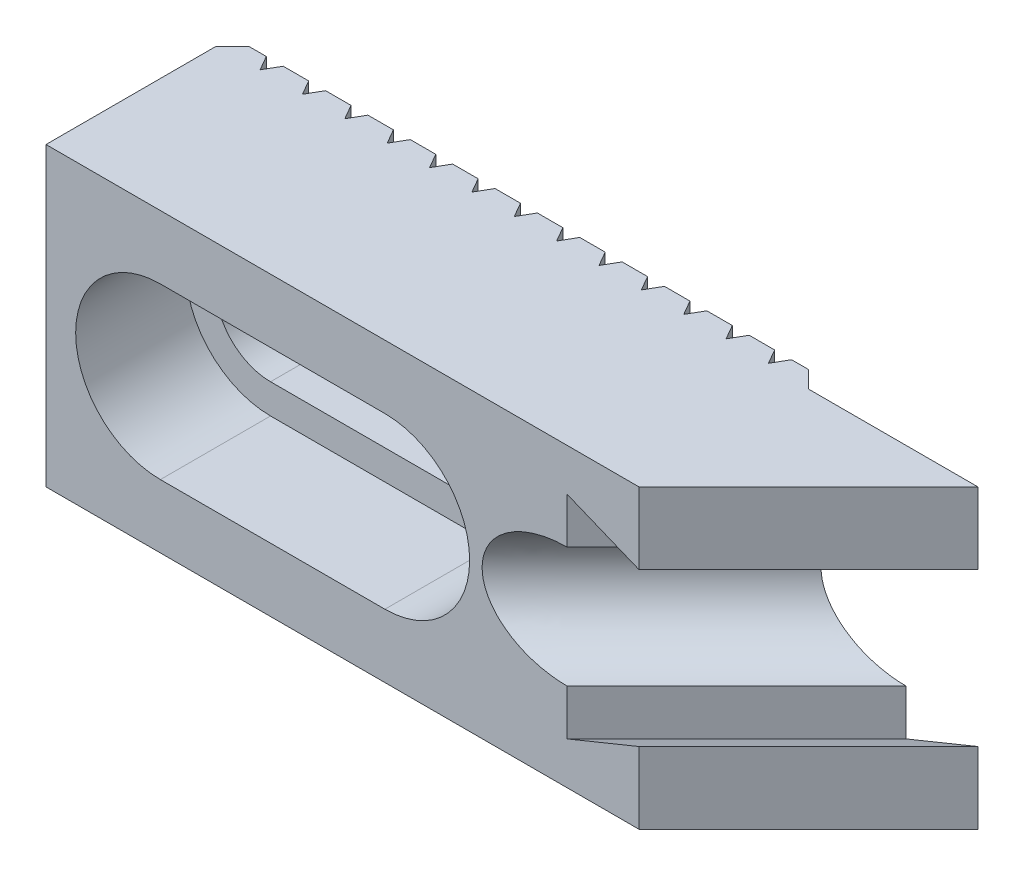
ISO-10303-21;
HEADER;
FILE_DESCRIPTION(('STEP AP214'),'2;1');
FILE_NAME('part.step','',(''),(''),'','','');
FILE_SCHEMA(('AUTOMOTIVE_DESIGN { 1 0 10303 214 1 1 1 1 }'));
ENDSEC;
DATA;
#1=APPLICATION_CONTEXT('core data for automotive mechanical design processes');
#2=APPLICATION_PROTOCOL_DEFINITION('international standard','automotive_design',2000,#1);
#3=PRODUCT_CONTEXT('',#1,'mechanical');
#4=PRODUCT('Part','Part','',(#3));
#5=PRODUCT_RELATED_PRODUCT_CATEGORY('part','',(#4));
#6=PRODUCT_DEFINITION_FORMATION('','',#4);
#7=PRODUCT_DEFINITION_CONTEXT('part definition',#1,'design');
#8=PRODUCT_DEFINITION('design','',#6,#7);
#9=PRODUCT_DEFINITION_SHAPE('','',#8);
#10=(LENGTH_UNIT() NAMED_UNIT(*) SI_UNIT(.MILLI.,.METRE.));
#11=(NAMED_UNIT(*) PLANE_ANGLE_UNIT() SI_UNIT($,.RADIAN.));
#12=(NAMED_UNIT(*) SI_UNIT($,.STERADIAN.) SOLID_ANGLE_UNIT());
#13=UNCERTAINTY_MEASURE_WITH_UNIT(LENGTH_MEASURE(1.E-05),#10,'distance_accuracy_value','');
#14=(GEOMETRIC_REPRESENTATION_CONTEXT(3) GLOBAL_UNCERTAINTY_ASSIGNED_CONTEXT((#13)) GLOBAL_UNIT_ASSIGNED_CONTEXT((#10,
#11,#12)) REPRESENTATION_CONTEXT('',''));
#15=CARTESIAN_POINT('',(0.,0.,0.));
#16=DIRECTION('',(0.,0.,1.));
#17=DIRECTION('',(1.,0.,0.));
#18=AXIS2_PLACEMENT_3D('',#15,#16,#17);
#19=CARTESIAN_POINT('',(-0.998815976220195,-17.5,0.));
#20=DIRECTION('',(0.,0.,-1.));
#21=DIRECTION('',(-1.,0.,0.));
#22=AXIS2_PLACEMENT_3D('',#19,#20,#21);
#23=PLANE('',#22);
#24=DIRECTION('',(-1.,0.,0.));
#25=VECTOR('',#24,1.);
#26=CARTESIAN_POINT('',(-0.998815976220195,-6.49999999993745,0.));
#27=LINE('',#26,#25);
#28=CARTESIAN_POINT('',(-25.9988159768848,-6.49999999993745,0.));
#29=VERTEX_POINT('',#28);
#30=CARTESIAN_POINT('',(-26.5,-6.49999999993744,0.));
#31=VERTEX_POINT('',#30);
#32=EDGE_CURVE('E610',#29,#31,#27,.T.);
#33=ORIENTED_EDGE('',*,*,#32,.F.);
#34=DIRECTION('',(0.,1.,0.));
#35=VECTOR('',#34,1.);
#36=CARTESIAN_POINT('',(-25.9988159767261,-17.506,0.));
#37=LINE('',#36,#35);
#38=CARTESIAN_POINT('',(-25.9988159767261,-17.5,0.));
#39=VERTEX_POINT('',#38);
#40=EDGE_CURVE('E2108',#39,#29,#37,.T.);
#41=ORIENTED_EDGE('',*,*,#40,.F.);
#42=CARTESIAN_POINT('',(-29.0011840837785,-17.5,0.));
#43=DIRECTION('',(1.,0.,0.));
#44=VECTOR('',#43,1.);
#45=LINE('',#42,#44);
#46=CARTESIAN_POINT('',(-29.0011840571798,-17.5,-1.67486686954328E-08));
#47=VERTEX_POINT('',#46);
#48=EDGE_CURVE('E913',#47,#39,#45,.T.);
#49=ORIENTED_EDGE('',*,*,#48,.F.);
#50=DIRECTION('',(0.,-1.,0.));
#51=VECTOR('',#50,1.);
#52=CARTESIAN_POINT('',(-29.0011840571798,17.506,-1.67486686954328E-08));
#53=LINE('',#52,#51);
#54=CARTESIAN_POINT('',(-29.0011840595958,-5.99950650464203,0.));
#55=VERTEX_POINT('',#54);
#56=EDGE_CURVE('E2026',#55,#47,#53,.T.);
#57=ORIENTED_EDGE('',*,*,#56,.F.);
#58=CARTESIAN_POINT('',(-26.5,3.12770642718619E-11,0.));
#59=DIRECTION('',(0.,0.,-1.));
#60=DIRECTION('',(1.,0.,0.));
#61=AXIS2_PLACEMENT_3D('',#58,#59,#60);
#62=CIRCLE('',#61,6.49999999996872);
#63=EDGE_CURVE('E575',#31,#55,#62,.T.);
#64=ORIENTED_EDGE('',*,*,#63,.F.);
#65=EDGE_LOOP('',(#33,#41,#49,#57,#64));
#66=FACE_BOUND('',#65,.T.);
#67=ADVANCED_FACE('F14',(#66),#23,.T.);
#68=DIRECTION('',(0.,-1.,0.));
#69=VECTOR('',#68,1.);
#70=CARTESIAN_POINT('',(-25.9988159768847,17.506,0.));
#71=LINE('',#70,#69);
#72=CARTESIAN_POINT('',(-25.9988159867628,17.5,0.));
#73=VERTEX_POINT('',#72);
#74=CARTESIAN_POINT('',(-25.9988159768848,6.5,0.));
#75=VERTEX_POINT('',#74);
#76=EDGE_CURVE('E1631',#73,#75,#71,.T.);
#77=ORIENTED_EDGE('',*,*,#76,.T.);
#78=DIRECTION('',(1.,0.,0.));
#79=VECTOR('',#78,1.);
#80=CARTESIAN_POINT('',(-0.998815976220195,6.5,0.));
#81=LINE('',#80,#79);
#82=CARTESIAN_POINT('',(-26.5,6.5,0.));
#83=VERTEX_POINT('',#82);
#84=EDGE_CURVE('E613',#83,#75,#81,.T.);
#85=ORIENTED_EDGE('',*,*,#84,.F.);
#86=CARTESIAN_POINT('',(-29.0011840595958,5.99950650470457,0.));
#87=VERTEX_POINT('',#86);
#88=EDGE_CURVE('E578',#87,#83,#62,.T.);
#89=ORIENTED_EDGE('',*,*,#88,.F.);
#90=DIRECTION('',(0.,1.,0.));
#91=VECTOR('',#90,1.);
#92=CARTESIAN_POINT('',(-29.0011840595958,-17.506,0.));
#93=LINE('',#92,#91);
#94=CARTESIAN_POINT('',(-29.0011840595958,17.5,0.));
#95=VERTEX_POINT('',#94);
#96=EDGE_CURVE('E1644',#87,#95,#93,.T.);
#97=ORIENTED_EDGE('',*,*,#96,.T.);
#98=CARTESIAN_POINT('',(-29.0011840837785,17.5,0.));
#99=DIRECTION('',(1.,0.,0.));
#100=VECTOR('',#99,1.);
#101=LINE('',#98,#100);
#102=EDGE_CURVE('E1086',#95,#73,#101,.T.);
#103=ORIENTED_EDGE('',*,*,#102,.T.);
#104=EDGE_LOOP('',(#77,#85,#89,#97,#103));
#105=FACE_BOUND('',#104,.T.);
#106=ADVANCED_FACE('F1876',(#105),#23,.T.);
#107=CARTESIAN_POINT('',(-30.9988159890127,-4.6915514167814,0.));
#108=VERTEX_POINT('',#107);
#109=CARTESIAN_POINT('',(-30.9988159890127,4.69155141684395,0.));
#110=VERTEX_POINT('',#109);
#111=EDGE_CURVE('E563',#108,#110,#62,.T.);
#112=ORIENTED_EDGE('',*,*,#111,.F.);
#113=DIRECTION('',(0.,-1.,0.));
#114=VECTOR('',#113,1.);
#115=CARTESIAN_POINT('',(-30.9988159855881,17.506,-1.67486686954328E-08));
#116=LINE('',#115,#114);
#117=CARTESIAN_POINT('',(-30.9988159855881,-17.5,-1.67486686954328E-08));
#118=VERTEX_POINT('',#117);
#119=EDGE_CURVE('E39',#108,#118,#116,.T.);
#120=ORIENTED_EDGE('',*,*,#119,.T.);
#121=CARTESIAN_POINT('',(-34.0011840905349,-17.5,0.));
#122=DIRECTION('',(1.,0.,0.));
#123=VECTOR('',#122,1.);
#124=LINE('',#121,#123);
#125=CARTESIAN_POINT('',(-34.0011840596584,-17.5,0.));
#126=VERTEX_POINT('',#125);
#127=EDGE_CURVE('E920',#126,#118,#124,.T.);
#128=ORIENTED_EDGE('',*,*,#127,.F.);
#129=DIRECTION('',(0.,1.,0.));
#130=VECTOR('',#129,1.);
#131=CARTESIAN_POINT('',(-34.0011840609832,-17.506,0.));
#132=LINE('',#131,#130);
#133=CARTESIAN_POINT('',(-34.0011840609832,17.5,0.));
#134=VERTEX_POINT('',#133);
#135=EDGE_CURVE('E1565',#126,#134,#132,.T.);
#136=ORIENTED_EDGE('',*,*,#135,.T.);
#137=CARTESIAN_POINT('',(-34.0011840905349,17.5,0.));
#138=DIRECTION('',(1.,0.,0.));
#139=VECTOR('',#138,1.);
#140=LINE('',#137,#139);
#141=CARTESIAN_POINT('',(-30.9988159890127,17.5,0.));
#142=VERTEX_POINT('',#141);
#143=EDGE_CURVE('E565',#134,#142,#140,.T.);
#144=ORIENTED_EDGE('',*,*,#143,.T.);
#145=DIRECTION('',(0.,1.,0.));
#146=VECTOR('',#145,1.);
#147=CARTESIAN_POINT('',(-30.9988159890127,-17.506,0.));
#148=LINE('',#147,#146);
#149=EDGE_CURVE('E560',#110,#142,#148,.T.);
#150=ORIENTED_EDGE('',*,*,#149,.F.);
#151=EDGE_LOOP('',(#112,#120,#128,#136,#144,#150));
#152=FACE_BOUND('',#151,.T.);
#153=ADVANCED_FACE('F561',(#152),#23,.T.);
#154=CARTESIAN_POINT('',(-1.02201927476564E-08,-10.,9.));
#155=DIRECTION('',(0.,1.,0.));
#156=DIRECTION('',(-1.,0.,0.));
#157=AXIS2_PLACEMENT_3D('',#154,#155,#156);
#158=PLANE('',#157);
#159=CARTESIAN_POINT('',(-1.02201927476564E-08,-10.,9.));
#160=DIRECTION('',(-1.,0.,0.));
#161=VECTOR('',#160,1.);
#162=LINE('',#159,#161);
#163=CARTESIAN_POINT('',(-1.41410494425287E-08,-10.,9.));
#164=VERTEX_POINT('',#163);
#165=CARTESIAN_POINT('',(-24.8720923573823,-10.0000000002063,9.));
#166=VERTEX_POINT('',#165);
#167=EDGE_CURVE('E1340',#164,#166,#162,.T.);
#168=ORIENTED_EDGE('',*,*,#167,.T.);
#169=DIRECTION('',(-1.,0.,0.));
#170=VECTOR('',#169,1.);
#171=CARTESIAN_POINT('',(-26.5,-10.,9.));
#172=LINE('',#171,#170);
#173=CARTESIAN_POINT('',(-26.5,-10.,9.));
#174=VERTEX_POINT('',#173);
#175=EDGE_CURVE('E619',#166,#174,#172,.T.);
#176=ORIENTED_EDGE('',*,*,#175,.T.);
#177=DIRECTION('',(0.,0.,1.));
#178=VECTOR('',#177,1.);
#179=CARTESIAN_POINT('',(-26.5,-10.,-14.1345683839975));
#180=LINE('',#179,#178);
#181=CARTESIAN_POINT('',(-26.5,-10.,22.));
#182=VERTEX_POINT('',#181);
#183=EDGE_CURVE('E626',#174,#182,#180,.T.);
#184=ORIENTED_EDGE('',*,*,#183,.T.);
#185=DIRECTION('',(1.,0.,0.));
#186=VECTOR('',#185,1.);
#187=CARTESIAN_POINT('',(-26.5,-10.,22.));
#188=LINE('',#187,#186);
#189=CARTESIAN_POINT('',(-24.8720915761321,-10.,22.));
#190=VERTEX_POINT('',#189);
#191=EDGE_CURVE('E623',#182,#190,#188,.T.);
#192=ORIENTED_EDGE('',*,*,#191,.T.);
#193=CARTESIAN_POINT('',(2.42873013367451E-08,-10.,22.));
#194=DIRECTION('',(-1.,0.,0.));
#195=VECTOR('',#194,1.);
#196=LINE('',#193,#195);
#197=CARTESIAN_POINT('',(0.,-10.0000000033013,22.));
#198=VERTEX_POINT('',#197);
#199=EDGE_CURVE('E1242',#198,#190,#196,.T.);
#200=ORIENTED_EDGE('',*,*,#199,.F.);
#201=CARTESIAN_POINT('',(-1.40670907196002E-08,-10.,9.));
#202=CARTESIAN_POINT('',(-1.40670907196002E-08,-10.,9.54166666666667));
#203=CARTESIAN_POINT('',(-1.40670907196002E-08,-10.,10.0833333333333));
#204=CARTESIAN_POINT('',(-1.40670907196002E-08,-10.,11.1666666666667));
#205=CARTESIAN_POINT('',(-1.40670907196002E-08,-10.,11.7083333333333));
#206=CARTESIAN_POINT('',(-1.40670907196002E-08,-10.,12.7916666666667));
#207=CARTESIAN_POINT('',(-1.40670907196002E-08,-10.,13.3333333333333));
#208=CARTESIAN_POINT('',(-1.40670907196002E-08,-10.,14.4166666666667));
#209=CARTESIAN_POINT('',(-1.40670907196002E-08,-10.,14.9583333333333));
#210=CARTESIAN_POINT('',(-1.40670907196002E-08,-10.,16.0416666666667));
#211=CARTESIAN_POINT('',(-1.40670907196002E-08,-10.,16.5833333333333));
#212=CARTESIAN_POINT('',(-1.40670907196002E-08,-10.,17.6666666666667));
#213=CARTESIAN_POINT('',(-1.40670907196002E-08,-10.,18.2083333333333));
#214=CARTESIAN_POINT('',(-1.40670907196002E-08,-10.,19.2916666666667));
#215=CARTESIAN_POINT('',(-1.40670907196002E-08,-10.,19.8333333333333));
#216=CARTESIAN_POINT('',(-1.40670907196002E-08,-10.,20.9166666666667));
#217=CARTESIAN_POINT('',(-1.40670907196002E-08,-10.,21.4583333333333));
#218=CARTESIAN_POINT('',(-1.40670907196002E-08,-10.,22.));
#219=B_SPLINE_CURVE_WITH_KNOTS('',3,(#201,#202,#203,#204,#205,#206,#207,#208,#209,#210,#211,
#212,#213,#214,#215,#216,#217,#218),.UNSPECIFIED.,.F.,.F.,(4,2,2,2,2,2,2,2,4),(0.,1.625,3.25,
4.875,6.5,8.125,9.75,11.375,13.),.UNSPECIFIED.);
#220=EDGE_CURVE('E1346',#198,#164,#219,.F.);
#221=ORIENTED_EDGE('',*,*,#220,.T.);
#222=EDGE_LOOP('',(#168,#176,#184,#192,#200,#221));
#223=FACE_BOUND('',#222,.T.);
#224=ADVANCED_FACE('F2880',(#223),#158,.T.);
#225=CARTESIAN_POINT('',(-1.02201927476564E-08,10.,9.));
#226=DIRECTION('',(0.,1.,0.));
#227=DIRECTION('',(-1.,0.,0.));
#228=AXIS2_PLACEMENT_3D('',#225,#226,#227);
#229=PLANE('',#228);
#230=CARTESIAN_POINT('',(-24.8720915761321,10.,22.));
#231=DIRECTION('',(1.,0.,0.));
#232=VECTOR('',#231,1.);
#233=LINE('',#230,#232);
#234=CARTESIAN_POINT('',(-24.8720915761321,10.,22.));
#235=VERTEX_POINT('',#234);
#236=CARTESIAN_POINT('',(5.98625315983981E-10,10.0000000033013,22.));
#237=VERTEX_POINT('',#236);
#238=EDGE_CURVE('E1235',#235,#237,#233,.T.);
#239=ORIENTED_EDGE('',*,*,#238,.F.);
#240=DIRECTION('',(-1.,0.,0.));
#241=VECTOR('',#240,1.);
#242=CARTESIAN_POINT('',(-26.5,10.,22.));
#243=LINE('',#242,#241);
#244=CARTESIAN_POINT('',(-26.5,10.,22.));
#245=VERTEX_POINT('',#244);
#246=EDGE_CURVE('E628',#235,#245,#243,.T.);
#247=ORIENTED_EDGE('',*,*,#246,.T.);
#248=DIRECTION('',(0.,0.,1.));
#249=VECTOR('',#248,1.);
#250=CARTESIAN_POINT('',(-26.5,10.,-14.1345683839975));
#251=LINE('',#250,#249);
#252=CARTESIAN_POINT('',(-26.5,10.,9.));
#253=VERTEX_POINT('',#252);
#254=EDGE_CURVE('E624',#253,#245,#251,.T.);
#255=ORIENTED_EDGE('',*,*,#254,.F.);
#256=DIRECTION('',(1.,0.,0.));
#257=VECTOR('',#256,1.);
#258=CARTESIAN_POINT('',(-26.5,10.,9.));
#259=LINE('',#258,#257);
#260=CARTESIAN_POINT('',(-24.8720947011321,10.,9.));
#261=VERTEX_POINT('',#260);
#262=EDGE_CURVE('E620',#253,#261,#259,.T.);
#263=ORIENTED_EDGE('',*,*,#262,.T.);
#264=CARTESIAN_POINT('',(-1.02201996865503E-08,10.,9.));
#265=DIRECTION('',(-1.,0.,0.));
#266=VECTOR('',#265,1.);
#267=LINE('',#264,#266);
#268=CARTESIAN_POINT('',(-1.35424241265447E-08,10.,9.));
#269=VERTEX_POINT('',#268);
#270=EDGE_CURVE('E1336',#269,#261,#267,.T.);
#271=ORIENTED_EDGE('',*,*,#270,.F.);
#272=CARTESIAN_POINT('',(-1.22712270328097E-08,10.,22.));
#273=CARTESIAN_POINT('',(-1.22712270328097E-08,10.,21.4583333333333));
#274=CARTESIAN_POINT('',(-1.22712270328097E-08,10.,20.9166666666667));
#275=CARTESIAN_POINT('',(-1.22712270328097E-08,10.,19.8333333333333));
#276=CARTESIAN_POINT('',(-1.22712270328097E-08,10.,19.2916666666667));
#277=CARTESIAN_POINT('',(-1.22712270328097E-08,10.,18.2083333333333));
#278=CARTESIAN_POINT('',(-1.22712270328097E-08,10.,17.6666666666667));
#279=CARTESIAN_POINT('',(-1.22712270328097E-08,10.,16.5833333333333));
#280=CARTESIAN_POINT('',(-1.22712270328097E-08,10.,16.0416666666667));
#281=CARTESIAN_POINT('',(-1.22712270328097E-08,10.,14.9583333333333));
#282=CARTESIAN_POINT('',(-1.22712270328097E-08,10.,14.4166666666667));
#283=CARTESIAN_POINT('',(-1.22712270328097E-08,10.,13.3333333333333));
#284=CARTESIAN_POINT('',(-1.22712270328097E-08,10.,12.7916666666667));
#285=CARTESIAN_POINT('',(-1.22712270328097E-08,10.,11.7083333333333));
#286=CARTESIAN_POINT('',(-1.22712270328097E-08,10.,11.1666666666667));
#287=CARTESIAN_POINT('',(-1.22712270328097E-08,10.,10.0833333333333));
#288=CARTESIAN_POINT('',(-1.22712270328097E-08,10.,9.54166666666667));
#289=CARTESIAN_POINT('',(-1.22712270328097E-08,10.,9.));
#290=B_SPLINE_CURVE_WITH_KNOTS('',3,(#272,#273,#274,#275,#276,#277,#278,#279,#280,#281,#282,
#283,#284,#285,#286,#287,#288,#289),.UNSPECIFIED.,.F.,.F.,(4,2,2,2,2,2,2,2,4),(0.,1.625,3.25,
4.875,6.5,8.125,9.75,11.375,13.),.UNSPECIFIED.);
#291=EDGE_CURVE('E1328',#269,#237,#290,.F.);
#292=ORIENTED_EDGE('',*,*,#291,.T.);
#293=EDGE_LOOP('',(#239,#247,#255,#263,#271,#292));
#294=FACE_BOUND('',#293,.T.);
#295=ADVANCED_FACE('F2871',(#294),#229,.F.);
#296=CARTESIAN_POINT('',(5.99881595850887,17.506,-1.3074735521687E-10));
#297=DIRECTION('',(0.866025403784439,0.,0.5));
#298=DIRECTION('',(-0.5,0.,0.866025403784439));
#299=AXIS2_PLACEMENT_3D('',#296,#297,#298);
#300=PLANE('',#299);
#301=DIRECTION('',(0.,-1.,0.));
#302=VECTOR('',#301,1.);
#303=CARTESIAN_POINT('',(4.99999999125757,17.506,1.73000000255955));
#304=LINE('',#303,#302);
#305=CARTESIAN_POINT('',(4.99999999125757,-4.15331194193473,1.73000000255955));
#306=VERTEX_POINT('',#305);
#307=CARTESIAN_POINT('',(4.99999999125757,-17.5,1.73000000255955));
#308=VERTEX_POINT('',#307);
#309=EDGE_CURVE('E1582',#306,#308,#304,.T.);
#310=ORIENTED_EDGE('',*,*,#309,.F.);
#311=CARTESIAN_POINT('',(0.,0.,10.3902540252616));
#312=DIRECTION('',(0.866025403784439,0.,0.5));
#313=DIRECTION('',(-0.5,0.,0.866025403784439));
#314=AXIS2_PLACEMENT_3D('',#311,#312,#313);
#315=ELLIPSE('',#314,12.9999999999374,6.49999999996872);
#316=CARTESIAN_POINT('',(5.99881595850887,-2.50283980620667,0.));
#317=VERTEX_POINT('',#316);
#318=EDGE_CURVE('E4075',#306,#317,#315,.T.);
#319=ORIENTED_EDGE('',*,*,#318,.T.);
#320=DIRECTION('',(0.,-1.,0.));
#321=VECTOR('',#320,1.);
#322=CARTESIAN_POINT('',(5.99881595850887,17.506,-1.3074735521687E-10));
#323=LINE('',#322,#321);
#324=CARTESIAN_POINT('',(5.99881595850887,-17.5,-1.3074735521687E-10));
#325=VERTEX_POINT('',#324);
#326=EDGE_CURVE('E2203',#317,#325,#323,.T.);
#327=ORIENTED_EDGE('',*,*,#326,.T.);
#328=DIRECTION('',(-0.5,0.,0.866025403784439));
#329=VECTOR('',#328,1.);
#330=CARTESIAN_POINT('',(5.99881595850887,-17.5,-1.3074735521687E-10));
#331=LINE('',#330,#329);
#332=EDGE_CURVE('E1574',#325,#308,#331,.T.);
#333=ORIENTED_EDGE('',*,*,#332,.T.);
#334=EDGE_LOOP('',(#310,#319,#327,#333));
#335=FACE_BOUND('',#334,.T.);
#336=ADVANCED_FACE('F2452',(#335),#300,.F.);
#337=CARTESIAN_POINT('',(4.99999999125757,17.506,1.73000000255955));
#338=DIRECTION('',(-0.866025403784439,0.,0.5));
#339=DIRECTION('',(-0.5,0.,-0.866025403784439));
#340=AXIS2_PLACEMENT_3D('',#337,#338,#339);
#341=PLANE('',#340);
#342=CARTESIAN_POINT('',(4.99999999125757,17.5,1.73000000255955));
#343=VERTEX_POINT('',#342);
#344=CARTESIAN_POINT('',(4.99999999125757,4.15331194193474,1.73000000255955));
#345=VERTEX_POINT('',#344);
#346=EDGE_CURVE('E2208',#343,#345,#304,.T.);
#347=ORIENTED_EDGE('',*,*,#346,.T.);
#348=CARTESIAN_POINT('',(0.,0.,-6.9302540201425));
#349=DIRECTION('',(-0.866025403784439,0.,0.5));
#350=DIRECTION('',(0.5,0.,0.866025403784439));
#351=AXIS2_PLACEMENT_3D('',#348,#349,#350);
#352=ELLIPSE('',#351,12.9999999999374,6.49999999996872);
#353=CARTESIAN_POINT('',(4.00118402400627,5.12255077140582,-1.30747409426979E-10));
#354=VERTEX_POINT('',#353);
#355=EDGE_CURVE('E4131',#345,#354,#352,.T.);
#356=ORIENTED_EDGE('',*,*,#355,.T.);
#357=DIRECTION('',(0.,-1.,0.));
#358=VECTOR('',#357,1.);
#359=CARTESIAN_POINT('',(4.00118402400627,17.506,-1.3074735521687E-10));
#360=LINE('',#359,#358);
#361=CARTESIAN_POINT('',(4.00118402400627,17.5,-1.3074735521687E-10));
#362=VERTEX_POINT('',#361);
#363=EDGE_CURVE('E2205',#362,#354,#360,.T.);
#364=ORIENTED_EDGE('',*,*,#363,.F.);
#365=DIRECTION('',(0.5,0.,0.866025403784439));
#366=VECTOR('',#365,1.);
#367=CARTESIAN_POINT('',(4.99999999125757,17.5,1.73000000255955));
#368=LINE('',#367,#366);
#369=EDGE_CURVE('E2211',#362,#343,#368,.T.);
#370=ORIENTED_EDGE('',*,*,#369,.T.);
#371=EDGE_LOOP('',(#347,#356,#364,#370));
#372=FACE_BOUND('',#371,.T.);
#373=ADVANCED_FACE('F2461',(#372),#341,.F.);
#374=CARTESIAN_POINT('',(19.0011840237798,-17.5,0.));
#375=DIRECTION('',(0.,0.,-1.));
#376=DIRECTION('',(-1.,0.,0.));
#377=AXIS2_PLACEMENT_3D('',#374,#375,#376);
#378=PLANE('',#377);
#379=DIRECTION('',(0.,-1.,0.));
#380=VECTOR('',#379,1.);
#381=CARTESIAN_POINT('',(19.001184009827,17.506,0.));
#382=LINE('',#381,#380);
#383=CARTESIAN_POINT('',(19.0011840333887,17.5,0.));
#384=VERTEX_POINT('',#383);
#385=CARTESIAN_POINT('',(19.001184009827,-17.5,0.));
#386=VERTEX_POINT('',#385);
#387=EDGE_CURVE('E4060',#384,#386,#382,.T.);
#388=ORIENTED_EDGE('',*,*,#387,.T.);
#389=CARTESIAN_POINT('',(15.9988159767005,-17.5,0.));
#390=DIRECTION('',(1.,0.,0.));
#391=VECTOR('',#390,1.);
#392=LINE('',#389,#391);
#393=CARTESIAN_POINT('',(15.9988159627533,-17.5,0.));
#394=VERTEX_POINT('',#393);
#395=EDGE_CURVE('E838',#394,#386,#392,.T.);
#396=ORIENTED_EDGE('',*,*,#395,.F.);
#397=DIRECTION('',(0.,1.,0.));
#398=VECTOR('',#397,1.);
#399=CARTESIAN_POINT('',(15.9988159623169,-17.506,0.));
#400=LINE('',#399,#398);
#401=CARTESIAN_POINT('',(15.9988159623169,17.5,0.));
#402=VERTEX_POINT('',#401);
#403=EDGE_CURVE('E4042',#394,#402,#400,.T.);
#404=ORIENTED_EDGE('',*,*,#403,.T.);
#405=CARTESIAN_POINT('',(15.9988159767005,17.5,0.));
#406=DIRECTION('',(1.,0.,0.));
#407=VECTOR('',#406,1.);
#408=LINE('',#405,#407);
#409=EDGE_CURVE('E994',#402,#384,#408,.T.);
#410=ORIENTED_EDGE('',*,*,#409,.T.);
#411=EDGE_LOOP('',(#388,#396,#404,#410));
#412=FACE_BOUND('',#411,.T.);
#413=ADVANCED_FACE('F1459',(#412),#378,.T.);
#414=DIRECTION('',(0.,-1.,0.));
#415=VECTOR('',#414,1.);
#416=CARTESIAN_POINT('',(20.9988159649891,17.506,0.));
#417=LINE('',#416,#415);
#418=CARTESIAN_POINT('',(20.9988159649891,17.5,0.));
#419=VERTEX_POINT('',#418);
#420=CARTESIAN_POINT('',(20.9988159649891,-17.5,0.));
#421=VERTEX_POINT('',#420);
#422=EDGE_CURVE('E4057',#419,#421,#417,.T.);
#423=ORIENTED_EDGE('',*,*,#422,.F.);
#424=CARTESIAN_POINT('',(20.9988159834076,17.5,0.));
#425=DIRECTION('',(1.,0.,0.));
#426=VECTOR('',#425,1.);
#427=LINE('',#424,#426);
#428=CARTESIAN_POINT('',(24.0011840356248,17.5,0.));
#429=VERTEX_POINT('',#428);
#430=EDGE_CURVE('E987',#419,#429,#427,.T.);
#431=ORIENTED_EDGE('',*,*,#430,.T.);
#432=DIRECTION('',(0.,1.,0.));
#433=VECTOR('',#432,1.);
#434=CARTESIAN_POINT('',(24.0011840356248,-17.506,0.));
#435=LINE('',#434,#433);
#436=CARTESIAN_POINT('',(24.0011840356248,-17.5,0.));
#437=VERTEX_POINT('',#436);
#438=EDGE_CURVE('E1364',#437,#429,#435,.T.);
#439=ORIENTED_EDGE('',*,*,#438,.F.);
#440=CARTESIAN_POINT('',(20.9988159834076,-17.5,0.));
#441=DIRECTION('',(1.,0.,0.));
#442=VECTOR('',#441,1.);
#443=LINE('',#440,#442);
#444=EDGE_CURVE('E966',#421,#437,#443,.T.);
#445=ORIENTED_EDGE('',*,*,#444,.F.);
#446=EDGE_LOOP('',(#423,#431,#439,#445));
#447=FACE_BOUND('',#446,.T.);
#448=ADVANCED_FACE('F2838',(#447),#378,.T.);
#449=DIRECTION('',(0.,1.,0.));
#450=VECTOR('',#449,1.);
#451=CARTESIAN_POINT('',(14.0011840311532,-17.506,0.));
#452=LINE('',#451,#450);
#453=CARTESIAN_POINT('',(14.0011840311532,-17.5,0.));
#454=VERTEX_POINT('',#453);
#455=CARTESIAN_POINT('',(14.0011840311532,17.5,0.));
#456=VERTEX_POINT('',#455);
#457=EDGE_CURVE('E4039',#454,#456,#452,.T.);
#458=ORIENTED_EDGE('',*,*,#457,.F.);
#459=CARTESIAN_POINT('',(10.9988159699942,-17.5,0.));
#460=DIRECTION('',(1.,0.,0.));
#461=VECTOR('',#460,1.);
#462=LINE('',#459,#461);
#463=CARTESIAN_POINT('',(10.998815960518,-17.5,0.));
#464=VERTEX_POINT('',#463);
#465=EDGE_CURVE('E826',#464,#454,#462,.T.);
#466=ORIENTED_EDGE('',*,*,#465,.F.);
#467=DIRECTION('',(0.,1.,0.));
#468=VECTOR('',#467,1.);
#469=CARTESIAN_POINT('',(10.9988159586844,-17.506,0.));
#470=LINE('',#469,#468);
#471=CARTESIAN_POINT('',(10.9988159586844,17.5,0.));
#472=VERTEX_POINT('',#471);
#473=EDGE_CURVE('E4016',#464,#472,#470,.T.);
#474=ORIENTED_EDGE('',*,*,#473,.T.);
#475=CARTESIAN_POINT('',(10.9988159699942,17.5,0.));
#476=DIRECTION('',(1.,0.,0.));
#477=VECTOR('',#476,1.);
#478=LINE('',#475,#477);
#479=EDGE_CURVE('E1002',#472,#456,#478,.T.);
#480=ORIENTED_EDGE('',*,*,#479,.T.);
#481=EDGE_LOOP('',(#458,#466,#474,#480));
#482=FACE_BOUND('',#481,.T.);
#483=ADVANCED_FACE('F1904',(#482),#378,.T.);
#484=DIRECTION('',(0.,1.,0.));
#485=VECTOR('',#484,1.);
#486=CARTESIAN_POINT('',(-4.00118404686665,-17.506,0.));
#487=LINE('',#486,#485);
#488=CARTESIAN_POINT('',(-4.00118404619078,-17.5,0.));
#489=VERTEX_POINT('',#488);
#490=CARTESIAN_POINT('',(-4.00118404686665,-6.5,0.));
#491=VERTEX_POINT('',#490);
#492=EDGE_CURVE('E4335',#489,#491,#487,.T.);
#493=ORIENTED_EDGE('',*,*,#492,.T.);
#494=CARTESIAN_POINT('',(-4.00118404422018,-6.5,0.));
#495=DIRECTION('',(1.,0.,0.));
#496=VECTOR('',#495,1.);
#497=LINE('',#494,#496);
#498=CARTESIAN_POINT('',(-0.998815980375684,-6.5,0.));
#499=VERTEX_POINT('',#498);
#500=EDGE_CURVE('E1180',#491,#499,#497,.T.);
#501=ORIENTED_EDGE('',*,*,#500,.T.);
#502=CARTESIAN_POINT('',(-0.998815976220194,-17.5,0.));
#503=DIRECTION('',(0.,1.,0.));
#504=VECTOR('',#503,1.);
#505=LINE('',#502,#504);
#506=CARTESIAN_POINT('',(-0.998815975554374,-17.5,0.));
#507=VERTEX_POINT('',#506);
#508=EDGE_CURVE('E1173',#507,#499,#505,.T.);
#509=ORIENTED_EDGE('',*,*,#508,.F.);
#510=CARTESIAN_POINT('',(-4.001184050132,-17.5,0.));
#511=DIRECTION('',(1.,0.,0.));
#512=VECTOR('',#511,1.);
#513=LINE('',#510,#512);
#514=EDGE_CURVE('E879',#489,#507,#513,.T.);
#515=ORIENTED_EDGE('',*,*,#514,.F.);
#516=EDGE_LOOP('',(#493,#501,#509,#515));
#517=FACE_BOUND('',#516,.T.);
#518=ADVANCED_FACE('F2821',(#517),#23,.T.);
#519=DIRECTION('',(0.,1.,0.));
#520=VECTOR('',#519,1.);
#521=CARTESIAN_POINT('',(-5.99881597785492,-17.506,0.));
#522=LINE('',#521,#520);
#523=CARTESIAN_POINT('',(-5.99881597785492,-17.5,0.));
#524=VERTEX_POINT('',#523);
#525=CARTESIAN_POINT('',(-5.99881597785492,-6.5,0.));
#526=VERTEX_POINT('',#525);
#527=EDGE_CURVE('E4393',#524,#526,#522,.T.);
#528=ORIENTED_EDGE('',*,*,#527,.F.);
#529=CARTESIAN_POINT('',(-9.00118405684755,-17.5,0.));
#530=DIRECTION('',(1.,0.,0.));
#531=VECTOR('',#530,1.);
#532=LINE('',#529,#531);
#533=CARTESIAN_POINT('',(-9.00118404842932,-17.5,0.));
#534=VERTEX_POINT('',#533);
#535=EDGE_CURVE('E885',#534,#524,#532,.T.);
#536=ORIENTED_EDGE('',*,*,#535,.F.);
#537=DIRECTION('',(0.,1.,0.));
#538=VECTOR('',#537,1.);
#539=CARTESIAN_POINT('',(-9.00118404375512,-17.506,0.));
#540=LINE('',#539,#538);
#541=CARTESIAN_POINT('',(-9.00118404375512,-6.5,0.));
#542=VERTEX_POINT('',#541);
#543=EDGE_CURVE('E2059',#534,#542,#540,.T.);
#544=ORIENTED_EDGE('',*,*,#543,.T.);
#545=CARTESIAN_POINT('',(-9.00118404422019,-6.5,0.));
#546=DIRECTION('',(1.,0.,0.));
#547=VECTOR('',#546,1.);
#548=LINE('',#545,#547);
#549=EDGE_CURVE('E1183',#542,#526,#548,.T.);
#550=ORIENTED_EDGE('',*,*,#549,.T.);
#551=EDGE_LOOP('',(#528,#536,#544,#550));
#552=FACE_BOUND('',#551,.T.);
#553=ADVANCED_FACE('F2812',(#552),#23,.T.);
#554=DIRECTION('',(0.,1.,0.));
#555=VECTOR('',#554,1.);
#556=CARTESIAN_POINT('',(-10.9988159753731,-17.506,0.));
#557=LINE('',#556,#555);
#558=CARTESIAN_POINT('',(-10.9988159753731,-17.5,0.));
#559=VERTEX_POINT('',#558);
#560=CARTESIAN_POINT('',(-10.9988159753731,-6.5,0.));
#561=VERTEX_POINT('',#560);
#562=EDGE_CURVE('E2052',#559,#561,#557,.T.);
#563=ORIENTED_EDGE('',*,*,#562,.F.);
#564=CARTESIAN_POINT('',(-14.0011840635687,-17.5,0.));
#565=DIRECTION('',(1.,0.,0.));
#566=VECTOR('',#565,1.);
#567=LINE('',#564,#566);
#568=CARTESIAN_POINT('',(-14.0011840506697,-17.5,0.));
#569=VERTEX_POINT('',#568);
#570=EDGE_CURVE('E892',#569,#559,#567,.T.);
#571=ORIENTED_EDGE('',*,*,#570,.F.);
#572=DIRECTION('',(0.,1.,0.));
#573=VECTOR('',#572,1.);
#574=CARTESIAN_POINT('',(-14.0011840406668,-17.506,0.));
#575=LINE('',#574,#573);
#576=CARTESIAN_POINT('',(-14.0011840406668,-6.5,0.));
#577=VERTEX_POINT('',#576);
#578=EDGE_CURVE('E2078',#569,#577,#575,.T.);
#579=ORIENTED_EDGE('',*,*,#578,.T.);
#580=CARTESIAN_POINT('',(-14.0011840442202,-6.5,0.));
#581=DIRECTION('',(1.,0.,0.));
#582=VECTOR('',#581,1.);
#583=LINE('',#580,#582);
#584=EDGE_CURVE('E1191',#577,#561,#583,.T.);
#585=ORIENTED_EDGE('',*,*,#584,.T.);
#586=EDGE_LOOP('',(#563,#571,#579,#585));
#587=FACE_BOUND('',#586,.T.);
#588=ADVANCED_FACE('F2803',(#587),#23,.T.);
#589=DIRECTION('',(0.,1.,0.));
#590=VECTOR('',#589,1.);
#591=CARTESIAN_POINT('',(-15.9988159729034,-17.506,0.));
#592=LINE('',#591,#590);
#593=CARTESIAN_POINT('',(-15.9988159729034,-17.5,0.));
#594=VERTEX_POINT('',#593);
#595=CARTESIAN_POINT('',(-15.9988159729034,-6.5,0.));
#596=VERTEX_POINT('',#595);
#597=EDGE_CURVE('E2071',#594,#596,#592,.T.);
#598=ORIENTED_EDGE('',*,*,#597,.F.);
#599=CARTESIAN_POINT('',(-19.0011840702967,-17.5,0.));
#600=DIRECTION('',(1.,0.,0.));
#601=VECTOR('',#600,1.);
#602=LINE('',#599,#601);
#603=CARTESIAN_POINT('',(-19.0011840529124,-17.5,0.));
#604=VERTEX_POINT('',#603);
#605=EDGE_CURVE('E899',#604,#594,#602,.T.);
#606=ORIENTED_EDGE('',*,*,#605,.F.);
#607=DIRECTION('',(0.,1.,0.));
#608=VECTOR('',#607,1.);
#609=CARTESIAN_POINT('',(-19.0011840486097,-17.506,0.));
#610=LINE('',#609,#608);
#611=CARTESIAN_POINT('',(-19.0011840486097,-6.5,0.));
#612=VERTEX_POINT('',#611);
#613=EDGE_CURVE('E2097',#604,#612,#610,.T.);
#614=ORIENTED_EDGE('',*,*,#613,.T.);
#615=CARTESIAN_POINT('',(-19.0011840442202,-6.5,0.));
#616=DIRECTION('',(1.,0.,0.));
#617=VECTOR('',#616,1.);
#618=LINE('',#615,#617);
#619=EDGE_CURVE('E1200',#612,#596,#618,.T.);
#620=ORIENTED_EDGE('',*,*,#619,.T.);
#621=EDGE_LOOP('',(#598,#606,#614,#620));
#622=FACE_BOUND('',#621,.T.);
#623=ADVANCED_FACE('F2794',(#622),#23,.T.);
#624=DIRECTION('',(0.,1.,0.));
#625=VECTOR('',#624,1.);
#626=CARTESIAN_POINT('',(-20.9988159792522,-17.506,0.));
#627=LINE('',#626,#625);
#628=CARTESIAN_POINT('',(-20.9988159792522,-17.5,0.));
#629=VERTEX_POINT('',#628);
#630=CARTESIAN_POINT('',(-20.9988159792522,-6.5,0.));
#631=VERTEX_POINT('',#630);
#632=EDGE_CURVE('E2090',#629,#631,#627,.T.);
#633=ORIENTED_EDGE('',*,*,#632,.F.);
#634=CARTESIAN_POINT('',(-24.0011840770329,-17.5,0.));
#635=DIRECTION('',(1.,0.,0.));
#636=VECTOR('',#635,1.);
#637=LINE('',#634,#636);
#638=CARTESIAN_POINT('',(-24.0011840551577,-17.5,0.));
#639=VERTEX_POINT('',#638);
#640=EDGE_CURVE('E906',#639,#629,#637,.T.);
#641=ORIENTED_EDGE('',*,*,#640,.F.);
#642=DIRECTION('',(0.,1.,0.));
#643=VECTOR('',#642,1.);
#644=CARTESIAN_POINT('',(-24.0011840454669,-17.506,0.));
#645=LINE('',#644,#643);
#646=CARTESIAN_POINT('',(-24.0011840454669,-6.5,0.));
#647=VERTEX_POINT('',#646);
#648=EDGE_CURVE('E1642',#639,#647,#645,.T.);
#649=ORIENTED_EDGE('',*,*,#648,.T.);
#650=CARTESIAN_POINT('',(-24.0011840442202,-6.5,0.));
#651=DIRECTION('',(1.,0.,0.));
#652=VECTOR('',#651,1.);
#653=LINE('',#650,#652);
#654=EDGE_CURVE('E1209',#647,#631,#653,.T.);
#655=ORIENTED_EDGE('',*,*,#654,.T.);
#656=EDGE_LOOP('',(#633,#641,#649,#655));
#657=FACE_BOUND('',#656,.T.);
#658=ADVANCED_FACE('F2779',(#657),#23,.T.);
#659=DIRECTION('',(0.,-1.,0.));
#660=VECTOR('',#659,1.);
#661=CARTESIAN_POINT('',(-24.0011840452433,17.506,0.));
#662=LINE('',#661,#660);
#663=CARTESIAN_POINT('',(-24.0011840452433,17.5,0.));
#664=VERTEX_POINT('',#663);
#665=CARTESIAN_POINT('',(-24.0011840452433,6.5,0.));
#666=VERTEX_POINT('',#665);
#667=EDGE_CURVE('E2125',#664,#666,#662,.T.);
#668=ORIENTED_EDGE('',*,*,#667,.F.);
#669=CARTESIAN_POINT('',(-24.0011840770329,17.5,0.));
#670=DIRECTION('',(1.,0.,0.));
#671=VECTOR('',#670,1.);
#672=LINE('',#669,#671);
#673=CARTESIAN_POINT('',(-20.9988159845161,17.5,0.));
#674=VERTEX_POINT('',#673);
#675=EDGE_CURVE('E1077',#664,#674,#672,.T.);
#676=ORIENTED_EDGE('',*,*,#675,.T.);
#677=DIRECTION('',(0.,-1.,0.));
#678=VECTOR('',#677,1.);
#679=CARTESIAN_POINT('',(-20.9988159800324,17.506,0.));
#680=LINE('',#679,#678);
#681=CARTESIAN_POINT('',(-20.9988159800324,6.5,0.));
#682=VERTEX_POINT('',#681);
#683=EDGE_CURVE('E1621',#674,#682,#680,.T.);
#684=ORIENTED_EDGE('',*,*,#683,.T.);
#685=CARTESIAN_POINT('',(-20.9988159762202,6.5,0.));
#686=DIRECTION('',(-1.,0.,0.));
#687=VECTOR('',#686,1.);
#688=LINE('',#685,#687);
#689=EDGE_CURVE('E1303',#682,#666,#688,.T.);
#690=ORIENTED_EDGE('',*,*,#689,.T.);
#691=EDGE_LOOP('',(#668,#676,#684,#690));
#692=FACE_BOUND('',#691,.T.);
#693=ADVANCED_FACE('F2774',(#692),#23,.T.);
#694=DIRECTION('',(0.,-1.,0.));
#695=VECTOR('',#694,1.);
#696=CARTESIAN_POINT('',(-19.0011840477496,17.506,0.));
#697=LINE('',#696,#695);
#698=CARTESIAN_POINT('',(-19.0011840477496,17.5,0.));
#699=VERTEX_POINT('',#698);
#700=CARTESIAN_POINT('',(-19.0011840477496,6.5,0.));
#701=VERTEX_POINT('',#700);
#702=EDGE_CURVE('E2141',#699,#701,#697,.T.);
#703=ORIENTED_EDGE('',*,*,#702,.F.);
#704=CARTESIAN_POINT('',(-19.0011840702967,17.5,0.));
#705=DIRECTION('',(1.,0.,0.));
#706=VECTOR('',#705,1.);
#707=LINE('',#704,#706);
#708=CARTESIAN_POINT('',(-15.9988159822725,17.5,0.));
#709=VERTEX_POINT('',#708);
#710=EDGE_CURVE('E1068',#699,#709,#707,.T.);
#711=ORIENTED_EDGE('',*,*,#710,.T.);
#712=DIRECTION('',(0.,-1.,0.));
#713=VECTOR('',#712,1.);
#714=CARTESIAN_POINT('',(-15.9988159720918,17.506,0.));
#715=LINE('',#714,#713);
#716=CARTESIAN_POINT('',(-15.9988159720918,6.5,0.));
#717=VERTEX_POINT('',#716);
#718=EDGE_CURVE('E1610',#709,#717,#715,.T.);
#719=ORIENTED_EDGE('',*,*,#718,.T.);
#720=CARTESIAN_POINT('',(-15.9988159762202,6.5,0.));
#721=DIRECTION('',(-1.,0.,0.));
#722=VECTOR('',#721,1.);
#723=LINE('',#720,#722);
#724=EDGE_CURVE('E1297',#717,#701,#723,.T.);
#725=ORIENTED_EDGE('',*,*,#724,.T.);
#726=EDGE_LOOP('',(#703,#711,#719,#725));
#727=FACE_BOUND('',#726,.T.);
#728=ADVANCED_FACE('F1905',(#727),#23,.T.);
#729=DIRECTION('',(0.,-1.,0.));
#730=VECTOR('',#729,1.);
#731=CARTESIAN_POINT('',(-14.0011840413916,17.506,0.));
#732=LINE('',#731,#730);
#733=CARTESIAN_POINT('',(-14.0011840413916,17.5,0.));
#734=VERTEX_POINT('',#733);
#735=CARTESIAN_POINT('',(-14.0011840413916,6.5,0.));
#736=VERTEX_POINT('',#735);
#737=EDGE_CURVE('E2156',#734,#736,#732,.T.);
#738=ORIENTED_EDGE('',*,*,#737,.F.);
#739=CARTESIAN_POINT('',(-14.0011840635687,17.5,0.));
#740=DIRECTION('',(1.,0.,0.));
#741=VECTOR('',#740,1.);
#742=LINE('',#739,#741);
#743=CARTESIAN_POINT('',(-10.9988159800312,17.5,0.));
#744=VERTEX_POINT('',#743);
#745=EDGE_CURVE('E1059',#734,#744,#742,.T.);
#746=ORIENTED_EDGE('',*,*,#745,.T.);
#747=DIRECTION('',(0.,-1.,0.));
#748=VECTOR('',#747,1.);
#749=CARTESIAN_POINT('',(-10.9988159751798,17.506,0.));
#750=LINE('',#749,#748);
#751=CARTESIAN_POINT('',(-10.9988159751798,6.5,0.));
#752=VERTEX_POINT('',#751);
#753=EDGE_CURVE('E1599',#744,#752,#750,.T.);
#754=ORIENTED_EDGE('',*,*,#753,.T.);
#755=CARTESIAN_POINT('',(-10.9988159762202,6.5,0.));
#756=DIRECTION('',(-1.,0.,0.));
#757=VECTOR('',#756,1.);
#758=LINE('',#755,#757);
#759=EDGE_CURVE('E1291',#752,#736,#758,.T.);
#760=ORIENTED_EDGE('',*,*,#759,.T.);
#761=EDGE_LOOP('',(#738,#746,#754,#760));
#762=FACE_BOUND('',#761,.T.);
#763=ADVANCED_FACE('F1898',(#762),#23,.T.);
#764=DIRECTION('',(0.,-1.,0.));
#765=VECTOR('',#764,1.);
#766=CARTESIAN_POINT('',(-9.00118404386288,17.506,0.));
#767=LINE('',#766,#765);
#768=CARTESIAN_POINT('',(-9.00118404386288,17.5,0.));
#769=VERTEX_POINT('',#768);
#770=CARTESIAN_POINT('',(-9.00118404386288,6.5,0.));
#771=VERTEX_POINT('',#770);
#772=EDGE_CURVE('E1906',#769,#771,#767,.T.);
#773=ORIENTED_EDGE('',*,*,#772,.F.);
#774=CARTESIAN_POINT('',(-9.00118405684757,17.5,0.));
#775=DIRECTION('',(1.,0.,0.));
#776=VECTOR('',#775,1.);
#777=LINE('',#774,#776);
#778=CARTESIAN_POINT('',(-5.99881597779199,17.5,0.));
#779=VERTEX_POINT('',#778);
#780=EDGE_CURVE('E1050',#769,#779,#777,.T.);
#781=ORIENTED_EDGE('',*,*,#780,.T.);
#782=DIRECTION('',(0.,-1.,0.));
#783=VECTOR('',#782,1.);
#784=CARTESIAN_POINT('',(-5.99881597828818,17.506,0.));
#785=LINE('',#784,#783);
#786=CARTESIAN_POINT('',(-5.99881597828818,6.5,0.));
#787=VERTEX_POINT('',#786);
#788=EDGE_CURVE('E1588',#779,#787,#785,.T.);
#789=ORIENTED_EDGE('',*,*,#788,.T.);
#790=CARTESIAN_POINT('',(-5.99881597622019,6.5,0.));
#791=DIRECTION('',(-1.,0.,0.));
#792=VECTOR('',#791,1.);
#793=LINE('',#790,#792);
#794=EDGE_CURVE('E1286',#787,#771,#793,.T.);
#795=ORIENTED_EDGE('',*,*,#794,.T.);
#796=EDGE_LOOP('',(#773,#781,#789,#795));
#797=FACE_BOUND('',#796,.T.);
#798=ADVANCED_FACE('F1890',(#797),#23,.T.);
#799=DIRECTION('',(0.,1.,0.));
#800=VECTOR('',#799,1.);
#801=CARTESIAN_POINT('',(9.00118402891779,-17.506,0.));
#802=LINE('',#801,#800);
#803=CARTESIAN_POINT('',(9.00118402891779,-17.5,0.));
#804=VERTEX_POINT('',#803);
#805=CARTESIAN_POINT('',(9.00118402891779,17.5,0.));
#806=VERTEX_POINT('',#805);
#807=EDGE_CURVE('E4012',#804,#806,#802,.T.);
#808=ORIENTED_EDGE('',*,*,#807,.F.);
#809=CARTESIAN_POINT('',(5.99881596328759,-17.5,0.));
#810=DIRECTION('',(1.,0.,0.));
#811=VECTOR('',#810,1.);
#812=LINE('',#809,#811);
#813=EDGE_CURVE('E856',#325,#804,#812,.T.);
#814=ORIENTED_EDGE('',*,*,#813,.F.);
#815=ORIENTED_EDGE('',*,*,#326,.F.);
#816=CARTESIAN_POINT('',(5.99881595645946,-2.50283978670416,0.));
#817=CARTESIAN_POINT('',(6.2468926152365,-1.9081070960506,0.));
#818=CARTESIAN_POINT('',(6.3734725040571,-1.27626333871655,0.));
#819=CARTESIAN_POINT('',(6.49994541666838,-0.644953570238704,0.));
#820=CARTESIAN_POINT('',(6.4999999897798,-1.1673023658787E-09,0.));
#821=B_SPLINE_CURVE_WITH_KNOTS('',2,(#816,#817,#818,#819,#820),.UNSPECIFIED.,.F.,.F.,(3,2,3),
(0.,0.5,1.),.UNSPECIFIED.);
#822=CARTESIAN_POINT('',(6.49999999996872,0.,0.));
#823=VERTEX_POINT('',#822);
#824=EDGE_CURVE('E1136',#317,#823,#821,.T.);
#825=ORIENTED_EDGE('',*,*,#824,.T.);
#826=CARTESIAN_POINT('',(6.4999999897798,0.,0.));
#827=CARTESIAN_POINT('',(6.4999454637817,0.644398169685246,0.));
#828=CARTESIAN_POINT('',(6.37347250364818,1.2762633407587,0.));
#829=CARTESIAN_POINT('',(6.24710642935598,1.9075945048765,0.));
#830=CARTESIAN_POINT('',(5.9988159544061,2.50283979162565,0.));
#831=B_SPLINE_CURVE_WITH_KNOTS('',2,(#826,#827,#828,#829,#830),.UNSPECIFIED.,.F.,.F.,(3,2,3),
(0.,0.5,1.),.UNSPECIFIED.);
#832=CARTESIAN_POINT('',(5.99881596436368,2.50283979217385,-1.30747409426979E-10));
#833=VERTEX_POINT('',#832);
#834=EDGE_CURVE('E1130',#823,#833,#831,.T.);
#835=ORIENTED_EDGE('',*,*,#834,.T.);
#836=CARTESIAN_POINT('',(5.99881595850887,17.5,-1.3074735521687E-10));
#837=VERTEX_POINT('',#836);
#838=EDGE_CURVE('E2200',#837,#833,#323,.T.);
#839=ORIENTED_EDGE('',*,*,#838,.F.);
#840=CARTESIAN_POINT('',(5.9988159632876,17.5,0.));
#841=DIRECTION('',(1.,0.,0.));
#842=VECTOR('',#841,1.);
#843=LINE('',#840,#842);
#844=EDGE_CURVE('E1007',#837,#806,#843,.T.);
#845=ORIENTED_EDGE('',*,*,#844,.T.);
#846=EDGE_LOOP('',(#808,#814,#815,#825,#835,#839,#845));
#847=FACE_BOUND('',#846,.T.);
#848=ADVANCED_FACE('F1896',(#847),#378,.T.);
#849=CARTESIAN_POINT('',(4.00118402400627,-5.12255077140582,-1.30747409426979E-10));
#850=VERTEX_POINT('',#849);
#851=CARTESIAN_POINT('',(4.00118402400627,-17.5,-1.3074735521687E-10));
#852=VERTEX_POINT('',#851);
#853=EDGE_CURVE('E2206',#850,#852,#360,.T.);
#854=ORIENTED_EDGE('',*,*,#853,.T.);
#855=CARTESIAN_POINT('',(0.998815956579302,-17.5,0.));
#856=DIRECTION('',(1.,0.,0.));
#857=VECTOR('',#856,1.);
#858=LINE('',#855,#857);
#859=CARTESIAN_POINT('',(0.998815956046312,-17.5,0.));
#860=VERTEX_POINT('',#859);
#861=EDGE_CURVE('E860',#860,#852,#858,.T.);
#862=ORIENTED_EDGE('',*,*,#861,.F.);
#863=CARTESIAN_POINT('',(0.998815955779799,-17.5,0.));
#864=DIRECTION('',(0.,1.,0.));
#865=VECTOR('',#864,1.);
#866=LINE('',#863,#865);
#867=CARTESIAN_POINT('',(0.998815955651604,-6.42280053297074,2.22069541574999E-10));
#868=VERTEX_POINT('',#867);
#869=EDGE_CURVE('E1142',#860,#868,#866,.T.);
#870=ORIENTED_EDGE('',*,*,#869,.T.);
#871=CARTESIAN_POINT('',(0.998815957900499,-6.4228005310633,0.));
#872=CARTESIAN_POINT('',(1.82025985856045,-6.29498580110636,0.));
#873=CARTESIAN_POINT('',(2.58314969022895,-5.96467414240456,0.));
#874=CARTESIAN_POINT('',(3.34554305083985,-5.63457744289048,0.));
#875=CARTESIAN_POINT('',(4.00118402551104,-5.12255076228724,0.));
#876=B_SPLINE_CURVE_WITH_KNOTS('',2,(#871,#872,#873,#874,#875),.UNSPECIFIED.,.F.,.F.,(3,2,3),
(0.,0.5,1.),.UNSPECIFIED.);
#877=EDGE_CURVE('E1148',#868,#850,#876,.T.);
#878=ORIENTED_EDGE('',*,*,#877,.T.);
#879=EDGE_LOOP('',(#854,#862,#870,#878));
#880=FACE_BOUND('',#879,.T.);
#881=ADVANCED_FACE('F1889',(#880),#378,.T.);
#882=DIRECTION('',(0.,-1.,0.));
#883=VECTOR('',#882,1.);
#884=CARTESIAN_POINT('',(-4.00118404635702,17.506,0.));
#885=LINE('',#884,#883);
#886=CARTESIAN_POINT('',(-4.00118404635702,17.5,0.));
#887=VERTEX_POINT('',#886);
#888=CARTESIAN_POINT('',(-4.00118404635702,6.5,0.));
#889=VERTEX_POINT('',#888);
#890=EDGE_CURVE('E2184',#887,#889,#885,.T.);
#891=ORIENTED_EDGE('',*,*,#890,.F.);
#892=CARTESIAN_POINT('',(-4.001184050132,17.5,0.));
#893=DIRECTION('',(1.,0.,0.));
#894=VECTOR('',#893,1.);
#895=LINE('',#892,#894);
#896=CARTESIAN_POINT('',(-0.998815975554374,17.5,0.));
#897=VERTEX_POINT('',#896);
#898=EDGE_CURVE('E1041',#887,#897,#895,.T.);
#899=ORIENTED_EDGE('',*,*,#898,.T.);
#900=CARTESIAN_POINT('',(-0.998815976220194,6.5,0.));
#901=DIRECTION('',(0.,1.,0.));
#902=VECTOR('',#901,1.);
#903=LINE('',#900,#902);
#904=CARTESIAN_POINT('',(-0.998815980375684,6.5,0.));
#905=VERTEX_POINT('',#904);
#906=EDGE_CURVE('E1271',#905,#897,#903,.T.);
#907=ORIENTED_EDGE('',*,*,#906,.F.);
#908=CARTESIAN_POINT('',(-0.998815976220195,6.5,0.));
#909=DIRECTION('',(-1.,0.,0.));
#910=VECTOR('',#909,1.);
#911=LINE('',#908,#910);
#912=EDGE_CURVE('E1279',#905,#889,#911,.T.);
#913=ORIENTED_EDGE('',*,*,#912,.T.);
#914=EDGE_LOOP('',(#891,#899,#907,#913));
#915=FACE_BOUND('',#914,.T.);
#916=ADVANCED_FACE('F1884',(#915),#23,.T.);
#917=DIRECTION('',(0.,1.,0.));
#918=VECTOR('',#917,1.);
#919=CARTESIAN_POINT('',(25.9988159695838,-17.506,0.));
#920=LINE('',#919,#918);
#921=CARTESIAN_POINT('',(25.9988159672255,-17.5,0.));
#922=VERTEX_POINT('',#921);
#923=CARTESIAN_POINT('',(25.9988159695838,17.5,0.));
#924=VERTEX_POINT('',#923);
#925=EDGE_CURVE('E1369',#922,#924,#920,.T.);
#926=ORIENTED_EDGE('',*,*,#925,.T.);
#927=CARTESIAN_POINT('',(25.998815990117,17.5,0.));
#928=DIRECTION('',(1.,0.,0.));
#929=VECTOR('',#928,1.);
#930=LINE('',#927,#929);
#931=CARTESIAN_POINT('',(27.9999999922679,17.5,0.));
#932=VERTEX_POINT('',#931);
#933=EDGE_CURVE('E1124',#924,#932,#930,.T.);
#934=ORIENTED_EDGE('',*,*,#933,.T.);
#935=CARTESIAN_POINT('',(27.9999999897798,17.5,0.));
#936=DIRECTION('',(0.,-1.,0.));
#937=VECTOR('',#936,1.);
#938=LINE('',#935,#937);
#939=CARTESIAN_POINT('',(27.9999999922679,-17.5,0.));
#940=VERTEX_POINT('',#939);
#941=EDGE_CURVE('E974',#932,#940,#938,.T.);
#942=ORIENTED_EDGE('',*,*,#941,.T.);
#943=CARTESIAN_POINT('',(25.998815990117,-17.5,0.));
#944=DIRECTION('',(1.,0.,0.));
#945=VECTOR('',#944,1.);
#946=LINE('',#943,#945);
#947=EDGE_CURVE('E957',#922,#940,#946,.T.);
#948=ORIENTED_EDGE('',*,*,#947,.F.);
#949=EDGE_LOOP('',(#926,#934,#942,#948));
#950=FACE_BOUND('',#949,.T.);
#951=ADVANCED_FACE('F1460',(#950),#378,.T.);
#952=CARTESIAN_POINT('',(-36.8138226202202,-10.,9.));
#953=DIRECTION('',(0.,0.,1.));
#954=DIRECTION('',(1.,0.,0.));
#955=AXIS2_PLACEMENT_3D('',#952,#953,#954);
#956=PLANE('',#955);
#957=DIRECTION('',(-1.,0.,0.));
#958=VECTOR('',#957,1.);
#959=CARTESIAN_POINT('',(-26.5,6.5,9.));
#960=LINE('',#959,#958);
#961=CARTESIAN_POINT('',(-24.8720978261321,6.5,9.));
#962=VERTEX_POINT('',#961);
#963=CARTESIAN_POINT('',(-26.5,6.5,9.));
#964=VERTEX_POINT('',#963);
#965=EDGE_CURVE('E586',#962,#964,#960,.T.);
#966=ORIENTED_EDGE('',*,*,#965,.F.);
#967=CARTESIAN_POINT('',(-1.02201996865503E-08,6.5,9.));
#968=DIRECTION('',(-1.,0.,0.));
#969=VECTOR('',#968,1.);
#970=LINE('',#967,#969);
#971=CARTESIAN_POINT('',(-1.15533650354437E-08,6.49999999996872,9.));
#972=VERTEX_POINT('',#971);
#973=EDGE_CURVE('E1356',#972,#962,#970,.T.);
#974=ORIENTED_EDGE('',*,*,#973,.F.);
#975=CARTESIAN_POINT('',(0.,0.,9.));
#976=DIRECTION('',(0.,0.,1.));
#977=DIRECTION('',(-1.,0.,0.));
#978=AXIS2_PLACEMENT_3D('',#975,#976,#977);
#979=CIRCLE('',#978,6.49999999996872);
#980=CARTESIAN_POINT('',(-1.2720677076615E-08,-6.49999999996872,9.));
#981=VERTEX_POINT('',#980);
#982=EDGE_CURVE('E4130',#981,#972,#979,.T.);
#983=ORIENTED_EDGE('',*,*,#982,.F.);
#984=CARTESIAN_POINT('',(-24.8721040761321,-6.5,9.));
#985=DIRECTION('',(1.,0.,0.));
#986=VECTOR('',#985,1.);
#987=LINE('',#984,#986);
#988=CARTESIAN_POINT('',(-24.8720978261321,-6.49999999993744,9.));
#989=VERTEX_POINT('',#988);
#990=EDGE_CURVE('E1320',#989,#981,#987,.T.);
#991=ORIENTED_EDGE('',*,*,#990,.F.);
#992=DIRECTION('',(1.,0.,0.));
#993=VECTOR('',#992,1.);
#994=CARTESIAN_POINT('',(-26.5,-6.49999999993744,9.));
#995=LINE('',#994,#993);
#996=CARTESIAN_POINT('',(-26.5,-6.49999999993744,9.));
#997=VERTEX_POINT('',#996);
#998=EDGE_CURVE('E590',#997,#989,#995,.T.);
#999=ORIENTED_EDGE('',*,*,#998,.F.);
#1000=CARTESIAN_POINT('',(-26.5,3.12770642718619E-11,9.));
#1001=DIRECTION('',(0.,0.,1.));
#1002=DIRECTION('',(-1.,0.,0.));
#1003=AXIS2_PLACEMENT_3D('',#1000,#1001,#1002);
#1004=CIRCLE('',#1003,6.49999999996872);
#1005=EDGE_CURVE('E594',#964,#997,#1004,.T.);
#1006=ORIENTED_EDGE('',*,*,#1005,.F.);
#1007=EDGE_LOOP('',(#966,#974,#983,#991,#999,#1006));
#1008=FACE_BOUND('',#1007,.T.);
#1009=ORIENTED_EDGE('',*,*,#175,.F.);
#1010=ORIENTED_EDGE('',*,*,#167,.F.);
#1011=CARTESIAN_POINT('',(-1.02201927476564E-08,0.,9.));
#1012=DIRECTION('',(0.,0.,-1.));
#1013=DIRECTION('',(1.,-1.79586368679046E-10,0.));
#1014=AXIS2_PLACEMENT_3D('',#1011,#1012,#1013);
#1015=CIRCLE('',#1014,10.);
#1016=CARTESIAN_POINT('',(9.99999998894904,-5.98624189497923E-10,9.));
#1017=VERTEX_POINT('',#1016);
#1018=EDGE_CURVE('E1353',#164,#1017,#1015,.F.);
#1019=ORIENTED_EDGE('',*,*,#1018,.T.);
#1020=CARTESIAN_POINT('',(-1.02201927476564E-08,0.,9.));
#1021=DIRECTION('',(0.,0.,-1.));
#1022=DIRECTION('',(-2.05103428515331E-10,1.,0.));
#1023=AXIS2_PLACEMENT_3D('',#1020,#1021,#1022);
#1024=CIRCLE('',#1023,10.);
#1025=EDGE_CURVE('E1323',#1017,#269,#1024,.F.);
#1026=ORIENTED_EDGE('',*,*,#1025,.T.);
#1027=ORIENTED_EDGE('',*,*,#270,.T.);
#1028=ORIENTED_EDGE('',*,*,#262,.F.);
#1029=CARTESIAN_POINT('',(-26.5,0.,9.));
#1030=DIRECTION('',(0.,0.,1.));
#1031=DIRECTION('',(-1.,0.,0.));
#1032=AXIS2_PLACEMENT_3D('',#1029,#1030,#1031);
#1033=CIRCLE('',#1032,10.);
#1034=EDGE_CURVE('E617',#174,#253,#1033,.F.);
#1035=ORIENTED_EDGE('',*,*,#1034,.F.);
#1036=EDGE_LOOP('',(#1009,#1010,#1019,#1026,#1027,#1028,#1035));
#1037=FACE_BOUND('',#1036,.T.);
#1038=ADVANCED_FACE('F1404',(#1008,#1037),#956,.T.);
#1039=CARTESIAN_POINT('',(-26.5000000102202,6.5,9.));
#1040=DIRECTION('',(0.,-1.,0.));
#1041=DIRECTION('',(0.,0.,-1.));
#1042=AXIS2_PLACEMENT_3D('',#1039,#1040,#1041);
#1043=PLANE('',#1042);
#1044=DIRECTION('',(-0.5,0.,-0.866025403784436));
#1045=VECTOR('',#1044,1.);
#1046=CARTESIAN_POINT('',(-22.2269976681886,6.5,6.53298094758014));
#1047=LINE('',#1046,#1045);
#1048=CARTESIAN_POINT('',(-25.000000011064,6.5,1.73000000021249));
#1049=VERTEX_POINT('',#1048);
#1050=EDGE_CURVE('E599',#1049,#75,#1047,.T.);
#1051=ORIENTED_EDGE('',*,*,#1050,.F.);
#1052=DIRECTION('',(-0.5,0.,0.866025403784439));
#1053=VECTOR('',#1052,1.);
#1054=CARTESIAN_POINT('',(-24.0011840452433,6.5,0.));
#1055=LINE('',#1054,#1053);
#1056=EDGE_CURVE('E1629',#666,#1049,#1055,.T.);
#1057=ORIENTED_EDGE('',*,*,#1056,.F.);
#1058=ORIENTED_EDGE('',*,*,#689,.F.);
#1059=DIRECTION('',(-0.5,0.,-0.866025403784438));
#1060=VECTOR('',#1059,1.);
#1061=CARTESIAN_POINT('',(-20.000000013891,6.5,1.73000000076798));
#1062=LINE('',#1061,#1060);
#1063=CARTESIAN_POINT('',(-20.000000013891,6.5,1.73000000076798));
#1064=VERTEX_POINT('',#1063);
#1065=EDGE_CURVE('E1622',#1064,#682,#1062,.T.);
#1066=ORIENTED_EDGE('',*,*,#1065,.F.);
#1067=DIRECTION('',(-0.5,0.,0.866025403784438));
#1068=VECTOR('',#1067,1.);
#1069=CARTESIAN_POINT('',(-19.0011840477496,6.5,0.));
#1070=LINE('',#1069,#1068);
#1071=EDGE_CURVE('E1618',#701,#1064,#1070,.T.);
#1072=ORIENTED_EDGE('',*,*,#1071,.F.);
#1073=ORIENTED_EDGE('',*,*,#724,.F.);
#1074=DIRECTION('',(-0.5,0.,-0.866025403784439));
#1075=VECTOR('',#1074,1.);
#1076=CARTESIAN_POINT('',(-15.0000000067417,6.5,1.72999999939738));
#1077=LINE('',#1076,#1075);
#1078=CARTESIAN_POINT('',(-15.0000000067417,6.5,1.72999999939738));
#1079=VERTEX_POINT('',#1078);
#1080=EDGE_CURVE('E1611',#1079,#717,#1077,.T.);
#1081=ORIENTED_EDGE('',*,*,#1080,.F.);
#1082=DIRECTION('',(-0.5,0.,0.866025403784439));
#1083=VECTOR('',#1082,1.);
#1084=CARTESIAN_POINT('',(-14.0011840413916,6.5,0.));
#1085=LINE('',#1084,#1083);
#1086=EDGE_CURVE('E1607',#736,#1079,#1085,.T.);
#1087=ORIENTED_EDGE('',*,*,#1086,.F.);
#1088=ORIENTED_EDGE('',*,*,#759,.F.);
#1089=DIRECTION('',(-0.5,0.,-0.866025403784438));
#1090=VECTOR('',#1089,1.);
#1091=CARTESIAN_POINT('',(-10.0000000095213,6.5,1.72999999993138));
#1092=LINE('',#1091,#1090);
#1093=CARTESIAN_POINT('',(-10.0000000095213,6.5,1.72999999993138));
#1094=VERTEX_POINT('',#1093);
#1095=EDGE_CURVE('E1600',#1094,#752,#1092,.T.);
#1096=ORIENTED_EDGE('',*,*,#1095,.F.);
#1097=DIRECTION('',(-0.5,0.,0.866025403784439));
#1098=VECTOR('',#1097,1.);
#1099=CARTESIAN_POINT('',(-9.00118404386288,6.5,0.));
#1100=LINE('',#1099,#1098);
#1101=EDGE_CURVE('E1596',#771,#1094,#1100,.T.);
#1102=ORIENTED_EDGE('',*,*,#1101,.F.);
#1103=ORIENTED_EDGE('',*,*,#794,.F.);
#1104=DIRECTION('',(-0.5,0.,-0.866025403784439));
#1105=VECTOR('',#1104,1.);
#1106=CARTESIAN_POINT('',(-5.0000000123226,6.5,1.73000000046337));
#1107=LINE('',#1106,#1105);
#1108=CARTESIAN_POINT('',(-5.0000000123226,6.5,1.73000000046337));
#1109=VERTEX_POINT('',#1108);
#1110=EDGE_CURVE('E1589',#1109,#787,#1107,.T.);
#1111=ORIENTED_EDGE('',*,*,#1110,.F.);
#1112=DIRECTION('',(-0.5,0.,0.866025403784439));
#1113=VECTOR('',#1112,1.);
#1114=CARTESIAN_POINT('',(-4.00118404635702,6.5,0.));
#1115=LINE('',#1114,#1113);
#1116=EDGE_CURVE('E1585',#889,#1109,#1115,.T.);
#1117=ORIENTED_EDGE('',*,*,#1116,.F.);
#1118=ORIENTED_EDGE('',*,*,#912,.F.);
#1119=CARTESIAN_POINT('',(-1.02201926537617E-08,6.5,1.73));
#1120=DIRECTION('',(-0.500000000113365,0.,-0.866025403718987));
#1121=VECTOR('',#1120,1.);
#1122=LINE('',#1119,#1121);
#1123=CARTESIAN_POINT('',(-9.87050277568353E-09,6.49999999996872,1.72999999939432));
#1124=VERTEX_POINT('',#1123);
#1125=EDGE_CURVE('E1275',#1124,#905,#1122,.T.);
#1126=ORIENTED_EDGE('',*,*,#1125,.F.);
#1127=CARTESIAN_POINT('',(-1.15533485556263E-08,6.5,1.729999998));
#1128=DIRECTION('',(0.,0.,1.));
#1129=VECTOR('',#1128,1.);
#1130=LINE('',#1127,#1129);
#1131=EDGE_CURVE('E1309',#1124,#972,#1130,.T.);
#1132=ORIENTED_EDGE('',*,*,#1131,.T.);
#1133=ORIENTED_EDGE('',*,*,#973,.T.);
#1134=ORIENTED_EDGE('',*,*,#965,.T.);
#1135=DIRECTION('',(0.,0.,1.));
#1136=VECTOR('',#1135,1.);
#1137=CARTESIAN_POINT('',(-26.5,6.5,-1.));
#1138=LINE('',#1137,#1136);
#1139=EDGE_CURVE('E608',#83,#964,#1138,.T.);
#1140=ORIENTED_EDGE('',*,*,#1139,.F.);
#1141=ORIENTED_EDGE('',*,*,#84,.T.);
#1142=EDGE_LOOP('',(#1051,#1057,#1058,#1066,#1072,#1073,#1081,#1087,#1088,#1096,#1102,#1103,
#1111,#1117,#1118,#1126,#1132,#1133,#1134,#1140,#1141));
#1143=FACE_BOUND('',#1142,.T.);
#1144=ADVANCED_FACE('F1401',(#1143),#1043,.T.);
#1145=CARTESIAN_POINT('',(9.99999998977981,0.,9.));
#1146=CARTESIAN_POINT('',(9.99999998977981,0.,22.));
#1147=B_SPLINE_CURVE_WITH_KNOTS('',1,(#1145,#1146),.UNSPECIFIED.,.F.,.F.,(2,2),(0.,1.),.UNSPECIFIED.);
#1148=CARTESIAN_POINT('',(-1.02201927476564E-08,0.,9.));
#1149=DIRECTION('',(0.,0.,1.));
#1150=AXIS1_PLACEMENT('',#1148,#1149);
#1151=SURFACE_OF_REVOLUTION('',#1147,#1150);
#1152=ORIENTED_EDGE('',*,*,#1025,.F.);
#1153=ORIENTED_EDGE('',*,*,#1018,.F.);
#1154=ORIENTED_EDGE('',*,*,#220,.F.);
#1155=CARTESIAN_POINT('',(-1.02201927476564E-08,0.,22.));
#1156=DIRECTION('',(0.,0.,1.));
#1157=DIRECTION('',(-3.84689797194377E-10,-1.,0.));
#1158=AXIS2_PLACEMENT_3D('',#1155,#1156,#1157);
#1159=CIRCLE('',#1158,10.);
#1160=CARTESIAN_POINT('',(9.99999999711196,-5.98624189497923E-10,22.));
#1161=VERTEX_POINT('',#1160);
#1162=EDGE_CURVE('E1250',#1161,#198,#1159,.F.);
#1163=ORIENTED_EDGE('',*,*,#1162,.F.);
#1164=CARTESIAN_POINT('',(-1.02201927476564E-08,0.,22.));
#1165=DIRECTION('',(0.,0.,1.));
#1166=DIRECTION('',(1.,0.,0.));
#1167=AXIS2_PLACEMENT_3D('',#1164,#1165,#1166);
#1168=CIRCLE('',#1167,10.);
#1169=EDGE_CURVE('E1230',#237,#1161,#1168,.F.);
#1170=ORIENTED_EDGE('',*,*,#1169,.F.);
#1171=ORIENTED_EDGE('',*,*,#291,.F.);
#1172=EDGE_LOOP('',(#1152,#1153,#1154,#1163,#1170,#1171));
#1173=FACE_BOUND('',#1172,.T.);
#1174=ADVANCED_FACE('F1390',(#1173),#1151,.F.);
#1175=CARTESIAN_POINT('',(-1.02201927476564E-08,-6.5,0.));
#1176=DIRECTION('',(0.,1.,0.));
#1177=DIRECTION('',(-1.,0.,0.));
#1178=AXIS2_PLACEMENT_3D('',#1175,#1176,#1177);
#1179=PLANE('',#1178);
#1180=DIRECTION('',(0.5,0.,-0.866025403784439));
#1181=VECTOR('',#1180,1.);
#1182=CARTESIAN_POINT('',(-25.0000000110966,-6.5,1.72999999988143));
#1183=LINE('',#1182,#1181);
#1184=CARTESIAN_POINT('',(-25.000000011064,-6.49999999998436,1.73000000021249));
#1185=VERTEX_POINT('',#1184);
#1186=EDGE_CURVE('E1640',#1185,#647,#1183,.T.);
#1187=ORIENTED_EDGE('',*,*,#1186,.F.);
#1188=DIRECTION('',(0.5,0.,0.866025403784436));
#1189=VECTOR('',#1188,1.);
#1190=CARTESIAN_POINT('',(-19.4991119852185,-6.5,11.2578175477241));
#1191=LINE('',#1190,#1189);
#1192=EDGE_CURVE('E604',#29,#1185,#1191,.T.);
#1193=ORIENTED_EDGE('',*,*,#1192,.F.);
#1194=ORIENTED_EDGE('',*,*,#32,.T.);
#1195=DIRECTION('',(0.,0.,1.));
#1196=VECTOR('',#1195,1.);
#1197=CARTESIAN_POINT('',(-26.5,-6.49999999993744,-1.));
#1198=LINE('',#1197,#1196);
#1199=EDGE_CURVE('E589',#31,#997,#1198,.T.);
#1200=ORIENTED_EDGE('',*,*,#1199,.T.);
#1201=ORIENTED_EDGE('',*,*,#998,.T.);
#1202=ORIENTED_EDGE('',*,*,#990,.T.);
#1203=CARTESIAN_POINT('',(-1.27206786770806E-08,-6.5,9.));
#1204=DIRECTION('',(0.,0.,-1.));
#1205=VECTOR('',#1204,1.);
#1206=LINE('',#1203,#1205);
#1207=CARTESIAN_POINT('',(-9.94346123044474E-09,-6.49999999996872,1.72999999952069));
#1208=VERTEX_POINT('',#1207);
#1209=EDGE_CURVE('E1315',#981,#1208,#1206,.T.);
#1210=ORIENTED_EDGE('',*,*,#1209,.T.);
#1211=CARTESIAN_POINT('',(-0.998815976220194,-6.50000000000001,0.));
#1212=DIRECTION('',(0.500000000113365,0.,0.866025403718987));
#1213=VECTOR('',#1212,1.);
#1214=LINE('',#1211,#1213);
#1215=EDGE_CURVE('E1164',#499,#1208,#1214,.T.);
#1216=ORIENTED_EDGE('',*,*,#1215,.F.);
#1217=ORIENTED_EDGE('',*,*,#500,.F.);
#1218=DIRECTION('',(0.5,0.,-0.866025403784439));
#1219=VECTOR('',#1218,1.);
#1220=CARTESIAN_POINT('',(-5.00000001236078,-6.5,1.72999999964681));
#1221=LINE('',#1220,#1219);
#1222=CARTESIAN_POINT('',(-5.00000001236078,-6.5,1.72999999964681));
#1223=VERTEX_POINT('',#1222);
#1224=EDGE_CURVE('E4336',#1223,#491,#1221,.T.);
#1225=ORIENTED_EDGE('',*,*,#1224,.F.);
#1226=DIRECTION('',(0.5,0.,0.866025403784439));
#1227=VECTOR('',#1226,1.);
#1228=CARTESIAN_POINT('',(-5.99881597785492,-6.5,0.));
#1229=LINE('',#1228,#1227);
#1230=EDGE_CURVE('E4332',#526,#1223,#1229,.T.);
#1231=ORIENTED_EDGE('',*,*,#1230,.F.);
#1232=ORIENTED_EDGE('',*,*,#549,.F.);
#1233=DIRECTION('',(0.5,0.,-0.866025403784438));
#1234=VECTOR('',#1233,1.);
#1235=CARTESIAN_POINT('',(-10.0000000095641,-6.5,1.73000000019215));
#1236=LINE('',#1235,#1234);
#1237=CARTESIAN_POINT('',(-10.0000000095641,-6.5,1.73000000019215));
#1238=VERTEX_POINT('',#1237);
#1239=EDGE_CURVE('E2046',#1238,#542,#1236,.T.);
#1240=ORIENTED_EDGE('',*,*,#1239,.F.);
#1241=DIRECTION('',(0.5,0.,0.866025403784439));
#1242=VECTOR('',#1241,1.);
#1243=CARTESIAN_POINT('',(-10.9988159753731,-6.5,0.));
#1244=LINE('',#1243,#1242);
#1245=EDGE_CURVE('E4473',#561,#1238,#1244,.T.);
#1246=ORIENTED_EDGE('',*,*,#1245,.F.);
#1247=ORIENTED_EDGE('',*,*,#584,.F.);
#1248=DIRECTION('',(0.5,0.,-0.866025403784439));
#1249=VECTOR('',#1248,1.);
#1250=CARTESIAN_POINT('',(-15.0000000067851,-6.5,1.7300000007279));
#1251=LINE('',#1250,#1249);
#1252=CARTESIAN_POINT('',(-15.0000000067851,-6.5,1.7300000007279));
#1253=VERTEX_POINT('',#1252);
#1254=EDGE_CURVE('E2065',#1253,#577,#1251,.T.);
#1255=ORIENTED_EDGE('',*,*,#1254,.F.);
#1256=DIRECTION('',(0.5,0.,0.866025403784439));
#1257=VECTOR('',#1256,1.);
#1258=CARTESIAN_POINT('',(-15.9988159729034,-6.5,0.));
#1259=LINE('',#1258,#1257);
#1260=EDGE_CURVE('E4465',#596,#1253,#1259,.T.);
#1261=ORIENTED_EDGE('',*,*,#1260,.F.);
#1262=ORIENTED_EDGE('',*,*,#619,.F.);
#1263=DIRECTION('',(0.5,0.,-0.86602540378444));
#1264=VECTOR('',#1263,1.);
#1265=CARTESIAN_POINT('',(-20.000000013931,-6.5,1.7299999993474));
#1266=LINE('',#1265,#1264);
#1267=CARTESIAN_POINT('',(-20.000000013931,-6.5,1.7299999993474));
#1268=VERTEX_POINT('',#1267);
#1269=EDGE_CURVE('E2084',#1268,#612,#1266,.T.);
#1270=ORIENTED_EDGE('',*,*,#1269,.F.);
#1271=DIRECTION('',(0.5,0.,0.866025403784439));
#1272=VECTOR('',#1271,1.);
#1273=CARTESIAN_POINT('',(-20.9988159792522,-6.5,0.));
#1274=LINE('',#1273,#1272);
#1275=EDGE_CURVE('E1637',#631,#1268,#1274,.T.);
#1276=ORIENTED_EDGE('',*,*,#1275,.F.);
#1277=ORIENTED_EDGE('',*,*,#654,.F.);
#1278=EDGE_LOOP('',(#1187,#1193,#1194,#1200,#1201,#1202,#1210,#1216,#1217,#1225,#1231,#1232,
#1240,#1246,#1247,#1255,#1261,#1262,#1270,#1276,#1277));
#1279=FACE_BOUND('',#1278,.T.);
#1280=ADVANCED_FACE('F1400',(#1279),#1179,.T.);
#1281=CARTESIAN_POINT('',(-1.02201927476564E-08,6.5,1.73));
#1282=DIRECTION('',(0.866025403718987,0.,-0.500000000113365));
#1283=DIRECTION('',(-0.500000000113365,0.,-0.866025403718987));
#1284=AXIS2_PLACEMENT_3D('',#1281,#1282,#1283);
#1285=PLANE('',#1284);
#1286=ORIENTED_EDGE('',*,*,#906,.T.);
#1287=CARTESIAN_POINT('',(-0.998815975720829,17.5,8.64925969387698E-10));
#1288=DIRECTION('',(0.500000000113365,0.,0.866025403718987));
#1289=VECTOR('',#1288,1.);
#1290=LINE('',#1287,#1289);
#1291=CARTESIAN_POINT('',(-2.72531233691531E-08,17.5,1.73000000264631));
#1292=VERTEX_POINT('',#1291);
#1293=EDGE_CURVE('E1032',#897,#1292,#1290,.T.);
#1294=ORIENTED_EDGE('',*,*,#1293,.T.);
#1295=CARTESIAN_POINT('',(-1.02201927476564E-08,17.5,1.73));
#1296=DIRECTION('',(0.,-1.,0.));
#1297=VECTOR('',#1296,1.);
#1298=LINE('',#1295,#1297);
#1299=EDGE_CURVE('E1267',#1292,#1124,#1298,.T.);
#1300=ORIENTED_EDGE('',*,*,#1299,.T.);
#1301=ORIENTED_EDGE('',*,*,#1125,.T.);
#1302=EDGE_LOOP('',(#1286,#1294,#1300,#1301));
#1303=FACE_BOUND('',#1302,.T.);
#1304=ADVANCED_FACE('F2911',(#1303),#1285,.T.);
#1305=CARTESIAN_POINT('',(-1.02201927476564E-08,6.356337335,1.73));
#1306=DIRECTION('',(0.866025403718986,0.,0.500000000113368));
#1307=DIRECTION('',(0.500000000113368,0.,-0.866025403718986));
#1308=AXIS2_PLACEMENT_3D('',#1305,#1306,#1307);
#1309=PLANE('',#1308);
#1310=CARTESIAN_POINT('',(-9.87050854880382E-09,6.49999999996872,1.72999999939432));
#1311=CARTESIAN_POINT('',(0.053933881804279,6.50000000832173,1.63658470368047));
#1312=CARTESIAN_POINT('',(0.107881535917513,6.49932872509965,1.5431773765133));
#1313=CARTESIAN_POINT('',(0.212270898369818,6.49672893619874,1.36245650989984));
#1314=CARTESIAN_POINT('',(0.262712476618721,6.49488501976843,1.27514167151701));
#1315=CARTESIAN_POINT('',(0.360069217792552,6.49018930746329,1.10660564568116));
#1316=CARTESIAN_POINT('',(0.406985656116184,6.48741652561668,1.02538298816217));
#1317=CARTESIAN_POINT('',(0.49728250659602,6.48109578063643,0.869031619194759));
#1318=CARTESIAN_POINT('',(0.540665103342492,6.47762125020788,0.793901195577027));
#1319=CARTESIAN_POINT('',(0.623892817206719,6.47011280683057,0.649734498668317));
#1320=CARTESIAN_POINT('',(0.66374058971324,6.46614675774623,0.580696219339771));
#1321=CARTESIAN_POINT('',(0.73990422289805,6.45785392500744,0.448714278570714));
#1322=CARTESIAN_POINT('',(0.776222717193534,6.45358947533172,0.385768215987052));
#1323=CARTESIAN_POINT('',(0.845337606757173,6.44488153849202,0.265970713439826));
#1324=CARTESIAN_POINT('',(0.878136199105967,6.44049489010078,0.209116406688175));
#1325=CARTESIAN_POINT('',(0.940227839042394,6.43170635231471,0.101504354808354));
#1326=CARTESIAN_POINT('',(0.969521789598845,6.42735595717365,0.0507429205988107));
#1327=CARTESIAN_POINT('',(0.998815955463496,6.42280053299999,5.47865138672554E-10));
#1328=B_SPLINE_CURVE_WITH_KNOTS('',3,(#1310,#1311,#1312,#1313,#1314,#1315,#1316,#1317,#1318,
#1319,#1320,#1321,#1322,#1323,#1324,#1325,#1326,#1327),.UNSPECIFIED.,.F.,.F.,(4,2,2,2,2,2,2,2,
4),(0.,0.323598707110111,0.626155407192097,0.907670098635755,1.168142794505,1.40757352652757,
1.62596235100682,1.82330935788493,1.9996146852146),.UNSPECIFIED.);
#1329=CARTESIAN_POINT('',(0.998815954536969,6.42280053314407,0.));
#1330=VERTEX_POINT('',#1329);
#1331=EDGE_CURVE('E1264',#1124,#1330,#1328,.T.);
#1332=ORIENTED_EDGE('',*,*,#1331,.F.);
#1333=ORIENTED_EDGE('',*,*,#1299,.F.);
#1334=CARTESIAN_POINT('',(-2.64325581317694E-08,17.5,1.73000002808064));
#1335=DIRECTION('',(0.500000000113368,0.,-0.866025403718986));
#1336=VECTOR('',#1335,1.);
#1337=LINE('',#1334,#1336);
#1338=CARTESIAN_POINT('',(0.998815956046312,17.5,0.));
#1339=VERTEX_POINT('',#1338);
#1340=EDGE_CURVE('E1023',#1292,#1339,#1337,.T.);
#1341=ORIENTED_EDGE('',*,*,#1340,.T.);
#1342=CARTESIAN_POINT('',(0.998815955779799,6.4228005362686,0.));
#1343=DIRECTION('',(0.,1.,0.));
#1344=VECTOR('',#1343,1.);
#1345=LINE('',#1342,#1344);
#1346=EDGE_CURVE('E1257',#1330,#1339,#1345,.T.);
#1347=ORIENTED_EDGE('',*,*,#1346,.F.);
#1348=EDGE_LOOP('',(#1332,#1333,#1341,#1347));
#1349=FACE_BOUND('',#1348,.T.);
#1350=ADVANCED_FACE('F1667',(#1349),#1309,.F.);
#1351=CARTESIAN_POINT('',(-40.0000000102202,-17.5,22.));
#1352=DIRECTION('',(0.,0.,1.));
#1353=DIRECTION('',(1.,0.,0.));
#1354=AXIS2_PLACEMENT_3D('',#1351,#1352,#1353);
#1355=PLANE('',#1354);
#1356=ORIENTED_EDGE('',*,*,#246,.F.);
#1357=ORIENTED_EDGE('',*,*,#238,.T.);
#1358=ORIENTED_EDGE('',*,*,#1169,.T.);
#1359=ORIENTED_EDGE('',*,*,#1162,.T.);
#1360=ORIENTED_EDGE('',*,*,#199,.T.);
#1361=ORIENTED_EDGE('',*,*,#191,.F.);
#1362=CARTESIAN_POINT('',(-26.5,0.,22.));
#1363=DIRECTION('',(0.,0.,1.));
#1364=DIRECTION('',(-1.,0.,0.));
#1365=AXIS2_PLACEMENT_3D('',#1362,#1363,#1364);
#1366=CIRCLE('',#1365,10.);
#1367=EDGE_CURVE('E616',#245,#182,#1366,.T.);
#1368=ORIENTED_EDGE('',*,*,#1367,.F.);
#1369=EDGE_LOOP('',(#1356,#1357,#1358,#1359,#1360,#1361,#1368));
#1370=FACE_BOUND('',#1369,.T.);
#1371=DIRECTION('',(0.,-1.,0.));
#1372=VECTOR('',#1371,1.);
#1373=CARTESIAN_POINT('',(29.9999888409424,-17.5,22.));
#1374=LINE('',#1373,#1372);
#1375=CARTESIAN_POINT('',(29.9999888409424,-9.03589838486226,22.));
#1376=VERTEX_POINT('',#1375);
#1377=CARTESIAN_POINT('',(29.9999888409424,-17.5,22.));
#1378=VERTEX_POINT('',#1377);
#1379=EDGE_CURVE('E4132',#1376,#1378,#1374,.T.);
#1380=ORIENTED_EDGE('',*,*,#1379,.F.);
#1381=DIRECTION('',(0.925820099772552,0.377964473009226,0.));
#1382=VECTOR('',#1381,1.);
#1383=CARTESIAN_POINT('',(-32.9618201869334,-34.7399492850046,22.));
#1384=LINE('',#1383,#1382);
#1385=CARTESIAN_POINT('',(21.5147074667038,-12.5,22.));
#1386=VERTEX_POINT('',#1385);
#1387=EDGE_CURVE('E4619',#1386,#1376,#1384,.T.);
#1388=ORIENTED_EDGE('',*,*,#1387,.F.);
#1389=DIRECTION('',(0.,-1.,0.));
#1390=VECTOR('',#1389,1.);
#1391=CARTESIAN_POINT('',(21.5147074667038,-17.5,22.));
#1392=LINE('',#1391,#1390);
#1393=CARTESIAN_POINT('',(21.5147074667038,-7.09999999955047,22.));
#1394=VERTEX_POINT('',#1393);
#1395=EDGE_CURVE('E4624',#1394,#1386,#1392,.T.);
#1396=ORIENTED_EDGE('',*,*,#1395,.F.);
#1397=CARTESIAN_POINT('',(21.5147074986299,7.09999999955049,22.));
#1398=CARTESIAN_POINT('',(21.2585711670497,7.10001824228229,22.));
#1399=CARTESIAN_POINT('',(21.0024284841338,7.09310643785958,22.));
#1400=CARTESIAN_POINT('',(20.4905506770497,7.06533756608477,22.));
#1401=CARTESIAN_POINT('',(20.2348165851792,7.04446149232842,22.));
#1402=CARTESIAN_POINT('',(19.7247433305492,6.98866362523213,22.));
#1403=CARTESIAN_POINT('',(19.4704049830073,6.95373435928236,22.));
#1404=CARTESIAN_POINT('',(18.9615375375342,6.86918482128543,22.));
#1405=CARTESIAN_POINT('',(18.7070323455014,6.8194200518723,22.));
#1406=CARTESIAN_POINT('',(18.2014996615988,6.70499612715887,22.));
#1407=CARTESIAN_POINT('',(17.9504707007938,6.64034348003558,22.));
#1408=CARTESIAN_POINT('',(17.4529011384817,6.49592238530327,22.));
#1409=CARTESIAN_POINT('',(17.2063586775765,6.4161603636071,22.));
#1410=CARTESIAN_POINT('',(16.7078938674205,6.23689417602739,22.));
#1411=CARTESIAN_POINT('',(16.4562324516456,6.13666031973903,22.));
#1412=CARTESIAN_POINT('',(15.9606696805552,5.91851982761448,22.));
#1413=CARTESIAN_POINT('',(15.7167683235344,5.80061319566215,22.));
#1414=CARTESIAN_POINT('',(15.2394632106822,5.54669267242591,22.));
#1415=CARTESIAN_POINT('',(15.0060289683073,5.41073665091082,22.));
#1416=CARTESIAN_POINT('',(14.6650615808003,5.19258744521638,22.));
#1417=CARTESIAN_POINT('',(14.5529379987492,5.11750303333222,22.));
#1418=CARTESIAN_POINT('',(14.3320580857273,4.96254138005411,22.));
#1419=CARTESIAN_POINT('',(14.2233015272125,4.88266446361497,22.));
#1420=CARTESIAN_POINT('',(13.9579787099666,4.67825472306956,22.));
#1421=CARTESIAN_POINT('',(13.8036646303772,4.55077192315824,22.));
#1422=CARTESIAN_POINT('',(13.5047916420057,4.28483431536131,22.));
#1423=CARTESIAN_POINT('',(13.3602322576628,4.14638004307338,22.));
#1424=CARTESIAN_POINT('',(13.0825005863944,3.85864726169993,22.));
#1425=CARTESIAN_POINT('',(12.9493197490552,3.70937703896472,22.));
#1426=CARTESIAN_POINT('',(12.6962203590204,3.39997076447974,22.));
#1427=CARTESIAN_POINT('',(12.5762989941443,3.2398370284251,22.));
#1428=CARTESIAN_POINT('',(12.3744430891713,2.9426576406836,22.));
#1429=CARTESIAN_POINT('',(12.289731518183,2.80749434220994,22.));
#1430=CARTESIAN_POINT('',(12.1310591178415,2.53098848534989,22.));
#1431=CARTESIAN_POINT('',(12.0570970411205,2.38964664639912,22.));
#1432=CARTESIAN_POINT('',(11.9211618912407,2.10136747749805,22.));
#1433=CARTESIAN_POINT('',(11.8591834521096,1.95443268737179,22.));
#1434=CARTESIAN_POINT('',(11.7481850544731,1.65572926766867,22.));
#1435=CARTESIAN_POINT('',(11.6991653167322,1.50396055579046,22.));
#1436=CARTESIAN_POINT('',(11.6146540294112,1.19555459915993,22.));
#1437=CARTESIAN_POINT('',(11.5792583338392,1.0388909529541,22.));
#1438=CARTESIAN_POINT('',(11.5233644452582,0.722914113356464,22.));
#1439=CARTESIAN_POINT('',(11.5028662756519,0.563600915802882,22.));
#1440=CARTESIAN_POINT('',(11.4771572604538,0.243843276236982,22.));
#1441=CARTESIAN_POINT('',(11.4719371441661,0.0833995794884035,22.));
#1442=CARTESIAN_POINT('',(11.4768267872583,-0.237324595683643,22.));
#1443=CARTESIAN_POINT('',(11.4869425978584,-0.397604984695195,22.));
#1444=CARTESIAN_POINT('',(11.5204785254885,-0.699086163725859,22.));
#1445=CARTESIAN_POINT('',(11.5423301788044,-0.840464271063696,22.));
#1446=CARTESIAN_POINT('',(11.5976751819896,-1.12085022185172,22.));
#1447=CARTESIAN_POINT('',(11.6311632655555,-1.25985910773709,22.));
#1448=CARTESIAN_POINT('',(11.7091857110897,-1.53477124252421,22.));
#1449=CARTESIAN_POINT('',(11.7537230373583,-1.67067364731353,22.));
#1450=CARTESIAN_POINT('',(11.8532590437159,-1.93858794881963,22.));
#1451=CARTESIAN_POINT('',(11.9082582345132,-2.07059965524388,22.));
#1452=CARTESIAN_POINT('',(12.0305674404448,-2.33583625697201,22.));
#1453=CARTESIAN_POINT('',(12.0983115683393,-2.46886046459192,22.));
#1454=CARTESIAN_POINT('',(12.2433630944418,-2.72956921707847,22.));
#1455=CARTESIAN_POINT('',(12.3206705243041,-2.85725374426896,22.));
#1456=CARTESIAN_POINT('',(12.4840443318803,-3.10694062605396,22.));
#1457=CARTESIAN_POINT('',(12.5701136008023,-3.22894108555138,22.));
#1458=CARTESIAN_POINT('',(12.7501364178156,-3.46697472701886,22.));
#1459=CARTESIAN_POINT('',(12.8440910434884,-3.58300708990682,22.));
#1460=CARTESIAN_POINT('',(13.0923637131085,-3.87090459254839,22.));
#1461=CARTESIAN_POINT('',(13.2515763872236,-4.03857207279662,22.));
#1462=CARTESIAN_POINT('',(13.5841392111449,-4.35926655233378,22.));
#1463=CARTESIAN_POINT('',(13.7574953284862,-4.51228731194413,22.));
#1464=CARTESIAN_POINT('',(14.1163180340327,-4.80412817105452,22.));
#1465=CARTESIAN_POINT('',(14.3018084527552,-4.94291886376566,22.));
#1466=CARTESIAN_POINT('',(14.6825158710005,-5.20635772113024,22.));
#1467=CARTESIAN_POINT('',(14.8777327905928,-5.33100600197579,22.));
#1468=CARTESIAN_POINT('',(15.3523973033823,-5.61142832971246,22.));
#1469=CARTESIAN_POINT('',(15.6355613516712,-5.76093008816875,22.));
#1470=CARTESIAN_POINT('',(16.2137649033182,-6.03493863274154,22.));
#1471=CARTESIAN_POINT('',(16.5088092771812,-6.15943503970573,22.));
#1472=CARTESIAN_POINT('',(17.1082855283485,-6.38436018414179,22.));
#1473=CARTESIAN_POINT('',(17.4127280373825,-6.48476044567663,22.));
#1474=CARTESIAN_POINT('',(18.028201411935,-6.66238585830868,22.));
#1475=CARTESIAN_POINT('',(18.3392307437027,-6.73961634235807,22.));
#1476=CARTESIAN_POINT('',(18.8883856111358,-6.8550746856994,22.));
#1477=CARTESIAN_POINT('',(19.1254931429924,-6.89822493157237,22.));
#1478=CARTESIAN_POINT('',(19.6016183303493,-6.97206464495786,22.));
#1479=CARTESIAN_POINT('',(19.8406357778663,-7.00275545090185,22.));
#1480=CARTESIAN_POINT('',(20.3185269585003,-7.05157026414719,22.));
#1481=CARTESIAN_POINT('',(20.5573932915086,-7.06976701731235,22.));
#1482=CARTESIAN_POINT('',(21.0357445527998,-7.09398737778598,22.));
#1483=CARTESIAN_POINT('',(21.275229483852,-7.10001093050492,22.));
#1484=CARTESIAN_POINT('',(21.5147074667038,-7.09999999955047,22.));
#1485=B_SPLINE_CURVE_WITH_KNOTS('',3,(#1397,#1398,#1399,#1400,#1401,#1402,#1403,#1404,#1405,
#1406,#1407,#1408,#1409,#1410,#1411,#1412,#1413,#1414,#1415,#1416,#1417,#1418,#1419,#1420,#1421,
#1422,#1423,#1424,#1425,#1426,#1427,#1428,#1429,#1430,#1431,#1432,#1433,#1434,#1435,#1436,#1437,
#1438,#1439,#1440,#1441,#1442,#1443,#1444,#1445,#1446,#1447,#1448,#1449,#1450,#1451,#1452,#1453,
#1454,#1455,#1456,#1457,#1458,#1459,#1460,#1461,#1462,#1463,#1464,#1465,#1466,#1467,#1468,#1469,
#1470,#1471,#1472,#1473,#1474,#1475,#1476,#1477,#1478,#1479,#1480,#1481,#1482,#1483,#1484),
.UNSPECIFIED.,.F.,.F.,(4,2,2,2,2,2,2,2,2,2,2,2,2,2,2,2,2,2,2,2,2,2,2,2,2,2,2,2,2,2,2,2,2,2,2,2,
2,2,2,2,2,2,2,4),(0.,0.768324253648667,1.53769638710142,2.30747816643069,3.08501720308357,
3.86221698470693,4.63908696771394,5.45109022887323,6.26309331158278,7.07255314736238,
7.47727138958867,7.88196222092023,8.48192454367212,9.08185759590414,9.68133578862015,
10.2806865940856,10.7587951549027,11.2368481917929,11.7146866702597,12.1925332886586,
12.6736829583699,13.1548333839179,13.6356917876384,14.1167399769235,14.5454125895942,
14.9738914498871,15.402485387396,15.8311002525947,16.2785119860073,16.7259252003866,
17.1734865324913,17.621109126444,18.3137087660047,19.0066021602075,19.7008997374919,
20.3951916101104,21.354412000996,22.3140297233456,23.2747759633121,24.2353008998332,
24.9579869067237,25.6805952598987,26.398959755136,27.1173274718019),.UNSPECIFIED.);
#1486=CARTESIAN_POINT('',(21.5147074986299,7.09999999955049,22.));
#1487=VERTEX_POINT('',#1486);
#1488=EDGE_CURVE('E664',#1487,#1394,#1485,.T.);
#1489=ORIENTED_EDGE('',*,*,#1488,.F.);
#1490=DIRECTION('',(5.91224985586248E-09,-1.,0.));
#1491=VECTOR('',#1490,1.);
#1492=CARTESIAN_POINT('',(21.5147076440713,-17.4999996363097,22.));
#1493=LINE('',#1492,#1491);
#1494=CARTESIAN_POINT('',(21.5147074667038,12.5,22.));
#1495=VERTEX_POINT('',#1494);
#1496=EDGE_CURVE('E4631',#1495,#1487,#1493,.T.);
#1497=ORIENTED_EDGE('',*,*,#1496,.F.);
#1498=DIRECTION('',(-0.925820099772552,0.377964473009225,0.));
#1499=VECTOR('',#1498,1.);
#1500=CARTESIAN_POINT('',(-20.7143714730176,29.7399492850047,22.));
#1501=LINE('',#1500,#1499);
#1502=CARTESIAN_POINT('',(29.9999888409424,9.03589838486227,22.));
#1503=VERTEX_POINT('',#1502);
#1504=EDGE_CURVE('E4635',#1503,#1495,#1501,.T.);
#1505=ORIENTED_EDGE('',*,*,#1504,.F.);
#1506=DIRECTION('',(0.,-1.,0.));
#1507=VECTOR('',#1506,1.);
#1508=CARTESIAN_POINT('',(29.9999888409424,-17.5,22.));
#1509=LINE('',#1508,#1507);
#1510=CARTESIAN_POINT('',(29.9999888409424,17.5,22.));
#1511=VERTEX_POINT('',#1510);
#1512=EDGE_CURVE('E4640',#1511,#1503,#1509,.T.);
#1513=ORIENTED_EDGE('',*,*,#1512,.F.);
#1514=CARTESIAN_POINT('',(29.9999888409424,17.5,22.));
#1515=DIRECTION('',(-1.,0.,0.));
#1516=VECTOR('',#1515,1.);
#1517=LINE('',#1514,#1516);
#1518=CARTESIAN_POINT('',(-40.0000000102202,17.5,22.));
#1519=VERTEX_POINT('',#1518);
#1520=EDGE_CURVE('E1118',#1511,#1519,#1517,.T.);
#1521=ORIENTED_EDGE('',*,*,#1520,.T.);
#1522=CARTESIAN_POINT('',(-40.0000000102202,-17.5,22.));
#1523=DIRECTION('',(0.,1.,0.));
#1524=VECTOR('',#1523,1.);
#1525=LINE('',#1522,#1524);
#1526=CARTESIAN_POINT('',(-40.0000000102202,-17.5,22.));
#1527=VERTEX_POINT('',#1526);
#1528=EDGE_CURVE('E1227',#1527,#1519,#1525,.T.);
#1529=ORIENTED_EDGE('',*,*,#1528,.F.);
#1530=CARTESIAN_POINT('',(29.9999888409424,-17.5,22.));
#1531=DIRECTION('',(-1.,0.,0.));
#1532=VECTOR('',#1531,1.);
#1533=LINE('',#1530,#1532);
#1534=EDGE_CURVE('E699',#1378,#1527,#1533,.T.);
#1535=ORIENTED_EDGE('',*,*,#1534,.F.);
#1536=EDGE_LOOP('',(#1380,#1388,#1396,#1489,#1497,#1505,#1513,#1521,#1529,#1535));
#1537=FACE_BOUND('',#1536,.T.);
#1538=ADVANCED_FACE('F1657',(#1370,#1537),#1355,.T.);
#1539=CARTESIAN_POINT('',(-40.0000000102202,-17.5,2.));
#1540=DIRECTION('',(-1.,0.,0.));
#1541=DIRECTION('',(0.,0.,1.));
#1542=AXIS2_PLACEMENT_3D('',#1539,#1540,#1541);
#1543=PLANE('',#1542);
#1544=CARTESIAN_POINT('',(-40.0000000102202,-17.5,22.));
#1545=DIRECTION('',(0.,0.,-1.));
#1546=VECTOR('',#1545,1.);
#1547=LINE('',#1544,#1546);
#1548=CARTESIAN_POINT('',(-40.0000000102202,-17.5,2.00000000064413));
#1549=VERTEX_POINT('',#1548);
#1550=EDGE_CURVE('E942',#1527,#1549,#1547,.T.);
#1551=ORIENTED_EDGE('',*,*,#1550,.F.);
#1552=ORIENTED_EDGE('',*,*,#1528,.T.);
#1553=CARTESIAN_POINT('',(-40.0000000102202,17.5,22.));
#1554=DIRECTION('',(0.,0.,-1.));
#1555=VECTOR('',#1554,1.);
#1556=LINE('',#1553,#1555);
#1557=CARTESIAN_POINT('',(-40.0000000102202,17.5,2.00000000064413));
#1558=VERTEX_POINT('',#1557);
#1559=EDGE_CURVE('E1111',#1519,#1558,#1556,.T.);
#1560=ORIENTED_EDGE('',*,*,#1559,.T.);
#1561=CARTESIAN_POINT('',(-40.0000000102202,17.5,2.));
#1562=DIRECTION('',(0.,-1.,0.));
#1563=VECTOR('',#1562,1.);
#1564=LINE('',#1561,#1563);
#1565=EDGE_CURVE('E1224',#1558,#1549,#1564,.T.);
#1566=ORIENTED_EDGE('',*,*,#1565,.T.);
#1567=EDGE_LOOP('',(#1551,#1552,#1560,#1566));
#1568=FACE_BOUND('',#1567,.T.);
#1569=ADVANCED_FACE('F1666',(#1568),#1543,.T.);
#1570=CARTESIAN_POINT('',(-40.0000000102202,-17.5,2.));
#1571=DIRECTION('',(0.707106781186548,0.,0.707106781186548));
#1572=DIRECTION('',(0.707106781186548,0.,-0.707106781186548));
#1573=AXIS2_PLACEMENT_3D('',#1570,#1571,#1572);
#1574=PLANE('',#1573);
#1575=CARTESIAN_POINT('',(-40.0000000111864,17.5,2.00000000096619));
#1576=DIRECTION('',(0.707106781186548,0.,-0.707106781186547));
#1577=VECTOR('',#1576,1.);
#1578=LINE('',#1575,#1577);
#1579=CARTESIAN_POINT('',(-38.0000000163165,17.5,0.));
#1580=VERTEX_POINT('',#1579);
#1581=EDGE_CURVE('E1103',#1558,#1580,#1578,.T.);
#1582=ORIENTED_EDGE('',*,*,#1581,.T.);
#1583=CARTESIAN_POINT('',(-38.0000000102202,-17.5,0.));
#1584=DIRECTION('',(0.,1.,0.));
#1585=VECTOR('',#1584,1.);
#1586=LINE('',#1583,#1585);
#1587=CARTESIAN_POINT('',(-38.0000000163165,-17.5,0.));
#1588=VERTEX_POINT('',#1587);
#1589=EDGE_CURVE('E1217',#1588,#1580,#1586,.T.);
#1590=ORIENTED_EDGE('',*,*,#1589,.F.);
#1591=CARTESIAN_POINT('',(-40.0000000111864,-17.5,2.0000000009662));
#1592=DIRECTION('',(0.707106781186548,0.,-0.707106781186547));
#1593=VECTOR('',#1592,1.);
#1594=LINE('',#1591,#1593);
#1595=EDGE_CURVE('E935',#1549,#1588,#1594,.T.);
#1596=ORIENTED_EDGE('',*,*,#1595,.F.);
#1597=ORIENTED_EDGE('',*,*,#1565,.F.);
#1598=EDGE_LOOP('',(#1582,#1590,#1596,#1597));
#1599=FACE_BOUND('',#1598,.T.);
#1600=ADVANCED_FACE('F1739',(#1599),#1574,.F.);
#1601=CARTESIAN_POINT('',(-38.0000000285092,17.5,0.));
#1602=DIRECTION('',(1.,0.,0.));
#1603=VECTOR('',#1602,1.);
#1604=LINE('',#1601,#1603);
#1605=CARTESIAN_POINT('',(-35.9988159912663,17.5,0.));
#1606=VERTEX_POINT('',#1605);
#1607=EDGE_CURVE('E1100',#1580,#1606,#1604,.T.);
#1608=ORIENTED_EDGE('',*,*,#1607,.T.);
#1609=DIRECTION('',(0.,1.,0.));
#1610=VECTOR('',#1609,1.);
#1611=CARTESIAN_POINT('',(-35.9988159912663,-17.506,0.));
#1612=LINE('',#1611,#1610);
#1613=CARTESIAN_POINT('',(-35.9988159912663,-17.5,0.));
#1614=VERTEX_POINT('',#1613);
#1615=EDGE_CURVE('E2220',#1614,#1606,#1612,.T.);
#1616=ORIENTED_EDGE('',*,*,#1615,.F.);
#1617=CARTESIAN_POINT('',(-38.0000000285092,-17.5,0.));
#1618=DIRECTION('',(1.,0.,0.));
#1619=VECTOR('',#1618,1.);
#1620=LINE('',#1617,#1619);
#1621=EDGE_CURVE('E927',#1588,#1614,#1620,.T.);
#1622=ORIENTED_EDGE('',*,*,#1621,.F.);
#1623=ORIENTED_EDGE('',*,*,#1589,.T.);
#1624=EDGE_LOOP('',(#1608,#1616,#1622,#1623));
#1625=FACE_BOUND('',#1624,.T.);
#1626=ADVANCED_FACE('F1748',(#1625),#23,.T.);
#1627=CARTESIAN_POINT('',(-1.02201927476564E-08,-17.5,1.73));
#1628=DIRECTION('',(0.866025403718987,0.,-0.500000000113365));
#1629=DIRECTION('',(-0.500000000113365,0.,-0.866025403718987));
#1630=AXIS2_PLACEMENT_3D('',#1627,#1628,#1629);
#1631=PLANE('',#1630);
#1632=CARTESIAN_POINT('',(-1.02201927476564E-08,-6.49999999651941,1.73));
#1633=DIRECTION('',(0.,-1.,0.));
#1634=VECTOR('',#1633,1.);
#1635=LINE('',#1632,#1634);
#1636=CARTESIAN_POINT('',(-2.7253130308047E-08,-17.5,1.73000000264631));
#1637=VERTEX_POINT('',#1636);
#1638=EDGE_CURVE('E1153',#1208,#1637,#1635,.T.);
#1639=ORIENTED_EDGE('',*,*,#1638,.T.);
#1640=CARTESIAN_POINT('',(-0.998815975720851,-17.5,8.64947002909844E-10));
#1641=DIRECTION('',(0.500000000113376,0.,0.866025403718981));
#1642=VECTOR('',#1641,1.);
#1643=LINE('',#1640,#1642);
#1644=EDGE_CURVE('E873',#507,#1637,#1643,.T.);
#1645=ORIENTED_EDGE('',*,*,#1644,.F.);
#1646=ORIENTED_EDGE('',*,*,#508,.T.);
#1647=ORIENTED_EDGE('',*,*,#1215,.T.);
#1648=EDGE_LOOP('',(#1639,#1645,#1646,#1647));
#1649=FACE_BOUND('',#1648,.T.);
#1650=ADVANCED_FACE('F1804',(#1649),#1631,.T.);
#1651=CARTESIAN_POINT('',(-1.02201927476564E-08,-17.5,1.73));
#1652=DIRECTION('',(0.866025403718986,0.,0.500000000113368));
#1653=DIRECTION('',(0.500000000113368,0.,-0.866025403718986));
#1654=AXIS2_PLACEMENT_3D('',#1651,#1652,#1653);
#1655=PLANE('',#1654);
#1656=CARTESIAN_POINT('',(0.998815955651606,-6.42280053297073,2.22070192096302E-10));
#1657=CARTESIAN_POINT('',(0.969521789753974,-6.4273559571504,0.0507429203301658));
#1658=CARTESIAN_POINT('',(0.94022783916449,-6.43170635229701,0.101504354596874));
#1659=CARTESIAN_POINT('',(0.878136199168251,-6.44049489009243,0.209116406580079));
#1660=CARTESIAN_POINT('',(0.84533760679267,-6.4448815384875,0.265970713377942));
#1661=CARTESIAN_POINT('',(0.776222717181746,-6.45358947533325,0.385768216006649));
#1662=CARTESIAN_POINT('',(0.739904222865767,-6.45785392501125,0.448714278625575));
#1663=CARTESIAN_POINT('',(0.663740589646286,-6.46614675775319,0.580696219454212));
#1664=CARTESIAN_POINT('',(0.623892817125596,-6.47011280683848,0.649734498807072));
#1665=CARTESIAN_POINT('',(0.540665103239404,-6.47762125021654,0.793901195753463));
#1666=CARTESIAN_POINT('',(0.497282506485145,-6.48109578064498,0.86903161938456));
#1667=CARTESIAN_POINT('',(0.406985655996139,-6.48741652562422,1.02538298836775));
#1668=CARTESIAN_POINT('',(0.360069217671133,-6.49018930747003,1.10660564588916));
#1669=CARTESIAN_POINT('',(0.262712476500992,-6.49488501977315,1.27514167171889));
#1670=CARTESIAN_POINT('',(0.212270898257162,-6.49672893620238,1.36245651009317));
#1671=CARTESIAN_POINT('',(0.107881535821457,-6.49932872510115,1.54317737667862));
#1672=CARTESIAN_POINT('',(0.0539338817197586,-6.50000000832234,1.6365847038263));
#1673=CARTESIAN_POINT('',(-9.94344968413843E-09,-6.49999999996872,1.72999999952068));
#1674=B_SPLINE_CURVE_WITH_KNOTS('',3,(#1656,#1657,#1658,#1659,#1660,#1661,#1662,#1663,#1664,
#1665,#1666,#1667,#1668,#1669,#1670,#1671,#1672,#1673),.UNSPECIFIED.,.F.,.F.,(4,2,2,2,2,2,2,2,
4),(0.,0.176305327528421,0.373652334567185,0.592041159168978,0.831471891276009,1.09194458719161,
1.37345927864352,1.67601597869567,1.99961468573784),.UNSPECIFIED.);
#1675=EDGE_CURVE('E1158',#868,#1208,#1674,.T.);
#1676=ORIENTED_EDGE('',*,*,#1675,.F.);
#1677=ORIENTED_EDGE('',*,*,#869,.F.);
#1678=CARTESIAN_POINT('',(-2.64325505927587E-08,-17.5,1.73000002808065));
#1679=DIRECTION('',(0.500000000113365,0.,-0.866025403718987));
#1680=VECTOR('',#1679,1.);
#1681=LINE('',#1678,#1680);
#1682=EDGE_CURVE('E867',#1637,#860,#1681,.T.);
#1683=ORIENTED_EDGE('',*,*,#1682,.F.);
#1684=ORIENTED_EDGE('',*,*,#1638,.F.);
#1685=EDGE_LOOP('',(#1676,#1677,#1683,#1684));
#1686=FACE_BOUND('',#1685,.T.);
#1687=ADVANCED_FACE('F1458',(#1686),#1655,.F.);
#1688=ORIENTED_EDGE('',*,*,#363,.T.);
#1689=CARTESIAN_POINT('',(4.00118402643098,5.1225507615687,0.));
#1690=CARTESIAN_POINT('',(3.34598361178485,5.63423338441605,0.));
#1691=CARTESIAN_POINT('',(2.58314968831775,5.96467414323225,0.));
#1692=CARTESIAN_POINT('',(1.82081219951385,6.29489985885,0.));
#1693=CARTESIAN_POINT('',(0.998815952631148,6.42280053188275,0.));
#1694=B_SPLINE_CURVE_WITH_KNOTS('',2,(#1689,#1690,#1691,#1692,#1693),.UNSPECIFIED.,.F.,.F.,(3,2,
3),(0.,0.5,1.),.UNSPECIFIED.);
#1695=EDGE_CURVE('E1260',#354,#1330,#1694,.T.);
#1696=ORIENTED_EDGE('',*,*,#1695,.T.);
#1697=ORIENTED_EDGE('',*,*,#1346,.T.);
#1698=CARTESIAN_POINT('',(0.998815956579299,17.5,0.));
#1699=DIRECTION('',(1.,0.,0.));
#1700=VECTOR('',#1699,1.);
#1701=LINE('',#1698,#1700);
#1702=EDGE_CURVE('E1015',#1339,#362,#1701,.T.);
#1703=ORIENTED_EDGE('',*,*,#1702,.T.);
#1704=EDGE_LOOP('',(#1688,#1696,#1697,#1703));
#1705=FACE_BOUND('',#1704,.T.);
#1706=ADVANCED_FACE('F1448',(#1705),#378,.T.);
#1707=CARTESIAN_POINT('',(-40.0000000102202,17.5,22.));
#1708=DIRECTION('',(0.,-1.,0.));
#1709=DIRECTION('',(0.,0.,-1.));
#1710=AXIS2_PLACEMENT_3D('',#1707,#1708,#1709);
#1711=PLANE('',#1710);
#1712=ORIENTED_EDGE('',*,*,#1520,.F.);
#1713=DIRECTION('',(0.707106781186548,0.,-0.707106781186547));
#1714=VECTOR('',#1713,1.);
#1715=CARTESIAN_POINT('',(-5.00000558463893,17.5,56.9999944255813));
#1716=LINE('',#1715,#1714);
#1717=CARTESIAN_POINT('',(49.9999888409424,17.5,2.));
#1718=VERTEX_POINT('',#1717);
#1719=EDGE_CURVE('E4653',#1511,#1718,#1716,.T.);
#1720=ORIENTED_EDGE('',*,*,#1719,.T.);
#1721=CARTESIAN_POINT('',(49.9999888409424,17.5,2.));
#1722=DIRECTION('',(-1.,0.,0.));
#1723=VECTOR('',#1722,1.);
#1724=LINE('',#1721,#1723);
#1725=CARTESIAN_POINT('',(29.9999999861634,17.5,2.00000000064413));
#1726=VERTEX_POINT('',#1725);
#1727=EDGE_CURVE('E848',#1718,#1726,#1724,.T.);
#1728=ORIENTED_EDGE('',*,*,#1727,.T.);
#1729=CARTESIAN_POINT('',(29.9999999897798,17.5,2.));
#1730=DIRECTION('',(-0.707106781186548,0.,-0.707106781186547));
#1731=VECTOR('',#1730,1.);
#1732=LINE('',#1729,#1731);
#1733=EDGE_CURVE('E980',#1726,#932,#1732,.T.);
#1734=ORIENTED_EDGE('',*,*,#1733,.T.);
#1735=ORIENTED_EDGE('',*,*,#933,.F.);
#1736=DIRECTION('',(0.5,0.,-0.866025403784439));
#1737=VECTOR('',#1736,1.);
#1738=CARTESIAN_POINT('',(25.0000000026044,17.5,1.73000000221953));
#1739=LINE('',#1738,#1737);
#1740=CARTESIAN_POINT('',(25.0000000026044,17.5,1.73000000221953));
#1741=VERTEX_POINT('',#1740);
#1742=EDGE_CURVE('E1555',#1741,#924,#1739,.T.);
#1743=ORIENTED_EDGE('',*,*,#1742,.F.);
#1744=DIRECTION('',(0.5,0.,0.866025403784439));
#1745=VECTOR('',#1744,1.);
#1746=CARTESIAN_POINT('',(24.0011840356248,17.5,0.));
#1747=LINE('',#1746,#1745);
#1748=EDGE_CURVE('E1548',#429,#1741,#1747,.T.);
#1749=ORIENTED_EDGE('',*,*,#1748,.F.);
#1750=ORIENTED_EDGE('',*,*,#430,.F.);
#1751=DIRECTION('',(0.5,0.,-0.866025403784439));
#1752=VECTOR('',#1751,1.);
#1753=CARTESIAN_POINT('',(20.9988159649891,17.5,0.));
#1754=LINE('',#1753,#1752);
#1755=CARTESIAN_POINT('',(19.999999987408,17.5,1.73000002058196));
#1756=VERTEX_POINT('',#1755);
#1757=EDGE_CURVE('E4071',#1756,#419,#1754,.T.);
#1758=ORIENTED_EDGE('',*,*,#1757,.F.);
#1759=DIRECTION('',(0.5,0.,0.866025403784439));
#1760=VECTOR('',#1759,1.);
#1761=CARTESIAN_POINT('',(19.999999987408,17.5,1.73000002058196));
#1762=LINE('',#1761,#1760);
#1763=EDGE_CURVE('E4068',#384,#1756,#1762,.T.);
#1764=ORIENTED_EDGE('',*,*,#1763,.F.);
#1765=ORIENTED_EDGE('',*,*,#409,.F.);
#1766=DIRECTION('',(0.5,0.,-0.866025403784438));
#1767=VECTOR('',#1766,1.);
#1768=CARTESIAN_POINT('',(14.9999999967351,17.5,1.72999999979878));
#1769=LINE('',#1768,#1767);
#1770=CARTESIAN_POINT('',(14.9999999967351,17.5,1.72999999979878));
#1771=VERTEX_POINT('',#1770);
#1772=EDGE_CURVE('E4051',#1771,#402,#1769,.T.);
#1773=ORIENTED_EDGE('',*,*,#1772,.F.);
#1774=DIRECTION('',(0.5,0.,0.866025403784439));
#1775=VECTOR('',#1774,1.);
#1776=CARTESIAN_POINT('',(14.0011840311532,17.5,0.));
#1777=LINE('',#1776,#1775);
#1778=EDGE_CURVE('E4349',#456,#1771,#1777,.T.);
#1779=ORIENTED_EDGE('',*,*,#1778,.F.);
#1780=ORIENTED_EDGE('',*,*,#479,.F.);
#1781=DIRECTION('',(0.5,0.,-0.866025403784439));
#1782=VECTOR('',#1781,1.);
#1783=CARTESIAN_POINT('',(9.99999999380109,17.5,1.72999999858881));
#1784=LINE('',#1783,#1782);
#1785=CARTESIAN_POINT('',(9.99999999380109,17.5,1.72999999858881));
#1786=VERTEX_POINT('',#1785);
#1787=EDGE_CURVE('E4033',#1786,#472,#1784,.T.);
#1788=ORIENTED_EDGE('',*,*,#1787,.F.);
#1789=DIRECTION('',(0.5,0.,0.866025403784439));
#1790=VECTOR('',#1789,1.);
#1791=CARTESIAN_POINT('',(9.00118402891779,17.5,0.));
#1792=LINE('',#1791,#1790);
#1793=EDGE_CURVE('E4020',#806,#1786,#1792,.T.);
#1794=ORIENTED_EDGE('',*,*,#1793,.F.);
#1795=ORIENTED_EDGE('',*,*,#844,.F.);
#1796=DIRECTION('',(0.5,0.,-0.866025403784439));
#1797=VECTOR('',#1796,1.);
#1798=CARTESIAN_POINT('',(5.99881595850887,17.5,-1.3074735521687E-10));
#1799=LINE('',#1798,#1797);
#1800=EDGE_CURVE('E1578',#343,#837,#1799,.T.);
#1801=ORIENTED_EDGE('',*,*,#1800,.F.);
#1802=ORIENTED_EDGE('',*,*,#369,.F.);
#1803=ORIENTED_EDGE('',*,*,#1702,.F.);
#1804=ORIENTED_EDGE('',*,*,#1340,.F.);
#1805=ORIENTED_EDGE('',*,*,#1293,.F.);
#1806=ORIENTED_EDGE('',*,*,#898,.F.);
#1807=DIRECTION('',(0.5,0.,-0.866025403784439));
#1808=VECTOR('',#1807,1.);
#1809=CARTESIAN_POINT('',(-4.00118404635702,17.5,0.));
#1810=LINE('',#1809,#1808);
#1811=CARTESIAN_POINT('',(-5.0000000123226,17.5,1.73000000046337));
#1812=VERTEX_POINT('',#1811);
#1813=EDGE_CURVE('E2170',#1812,#887,#1810,.T.);
#1814=ORIENTED_EDGE('',*,*,#1813,.F.);
#1815=DIRECTION('',(0.5,0.,0.866025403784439));
#1816=VECTOR('',#1815,1.);
#1817=CARTESIAN_POINT('',(-5.0000000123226,17.5,1.73000000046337));
#1818=LINE('',#1817,#1816);
#1819=EDGE_CURVE('E1593',#779,#1812,#1818,.T.);
#1820=ORIENTED_EDGE('',*,*,#1819,.F.);
#1821=ORIENTED_EDGE('',*,*,#780,.F.);
#1822=DIRECTION('',(0.5,0.,-0.866025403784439));
#1823=VECTOR('',#1822,1.);
#1824=CARTESIAN_POINT('',(-9.00118404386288,17.5,0.));
#1825=LINE('',#1824,#1823);
#1826=CARTESIAN_POINT('',(-10.0000000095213,17.5,1.72999999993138));
#1827=VERTEX_POINT('',#1826);
#1828=EDGE_CURVE('E1915',#1827,#769,#1825,.T.);
#1829=ORIENTED_EDGE('',*,*,#1828,.F.);
#1830=DIRECTION('',(0.5,0.,0.866025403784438));
#1831=VECTOR('',#1830,1.);
#1832=CARTESIAN_POINT('',(-10.0000000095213,17.5,1.72999999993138));
#1833=LINE('',#1832,#1831);
#1834=EDGE_CURVE('E1604',#744,#1827,#1833,.T.);
#1835=ORIENTED_EDGE('',*,*,#1834,.F.);
#1836=ORIENTED_EDGE('',*,*,#745,.F.);
#1837=DIRECTION('',(0.5,0.,-0.866025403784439));
#1838=VECTOR('',#1837,1.);
#1839=CARTESIAN_POINT('',(-14.0011840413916,17.5,0.));
#1840=LINE('',#1839,#1838);
#1841=CARTESIAN_POINT('',(-15.0000000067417,17.5,1.72999999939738));
#1842=VERTEX_POINT('',#1841);
#1843=EDGE_CURVE('E2140',#1842,#734,#1840,.T.);
#1844=ORIENTED_EDGE('',*,*,#1843,.F.);
#1845=DIRECTION('',(0.5,0.,0.866025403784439));
#1846=VECTOR('',#1845,1.);
#1847=CARTESIAN_POINT('',(-15.0000000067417,17.5,1.72999999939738));
#1848=LINE('',#1847,#1846);
#1849=EDGE_CURVE('E1615',#709,#1842,#1848,.T.);
#1850=ORIENTED_EDGE('',*,*,#1849,.F.);
#1851=ORIENTED_EDGE('',*,*,#710,.F.);
#1852=DIRECTION('',(0.5,0.,-0.866025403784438));
#1853=VECTOR('',#1852,1.);
#1854=CARTESIAN_POINT('',(-19.0011840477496,17.5,0.));
#1855=LINE('',#1854,#1853);
#1856=CARTESIAN_POINT('',(-20.000000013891,17.5,1.73000000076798));
#1857=VERTEX_POINT('',#1856);
#1858=EDGE_CURVE('E2124',#1857,#699,#1855,.T.);
#1859=ORIENTED_EDGE('',*,*,#1858,.F.);
#1860=DIRECTION('',(0.5,0.,0.866025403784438));
#1861=VECTOR('',#1860,1.);
#1862=CARTESIAN_POINT('',(-20.000000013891,17.5,1.73000000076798));
#1863=LINE('',#1862,#1861);
#1864=EDGE_CURVE('E1626',#674,#1857,#1863,.T.);
#1865=ORIENTED_EDGE('',*,*,#1864,.F.);
#1866=ORIENTED_EDGE('',*,*,#675,.F.);
#1867=DIRECTION('',(0.5,0.,-0.866025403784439));
#1868=VECTOR('',#1867,1.);
#1869=CARTESIAN_POINT('',(-24.0011840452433,17.5,0.));
#1870=LINE('',#1869,#1868);
#1871=CARTESIAN_POINT('',(-25.000000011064,17.5,1.73000000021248));
#1872=VERTEX_POINT('',#1871);
#1873=EDGE_CURVE('E2107',#1872,#664,#1870,.T.);
#1874=ORIENTED_EDGE('',*,*,#1873,.F.);
#1875=DIRECTION('',(0.5,0.,0.866025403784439));
#1876=VECTOR('',#1875,1.);
#1877=CARTESIAN_POINT('',(-25.000000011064,17.5,1.73000000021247));
#1878=LINE('',#1877,#1876);
#1879=EDGE_CURVE('E1632',#73,#1872,#1878,.T.);
#1880=ORIENTED_EDGE('',*,*,#1879,.F.);
#1881=ORIENTED_EDGE('',*,*,#102,.F.);
#1882=DIRECTION('',(0.5,0.,-0.86602540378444));
#1883=VECTOR('',#1882,1.);
#1884=CARTESIAN_POINT('',(-30.0000000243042,17.5,1.72999999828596));
#1885=LINE('',#1884,#1883);
#1886=CARTESIAN_POINT('',(-30.0000000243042,17.5,1.72999999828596));
#1887=VERTEX_POINT('',#1886);
#1888=EDGE_CURVE('E568',#1887,#95,#1885,.T.);
#1889=ORIENTED_EDGE('',*,*,#1888,.F.);
#1890=DIRECTION('',(0.5,0.,0.866025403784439));
#1891=VECTOR('',#1890,1.);
#1892=CARTESIAN_POINT('',(-30.9988159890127,17.5,0.));
#1893=LINE('',#1892,#1891);
#1894=EDGE_CURVE('E2042',#142,#1887,#1893,.T.);
#1895=ORIENTED_EDGE('',*,*,#1894,.F.);
#1896=ORIENTED_EDGE('',*,*,#143,.F.);
#1897=DIRECTION('',(0.5,0.,-0.86602540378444));
#1898=VECTOR('',#1897,1.);
#1899=CARTESIAN_POINT('',(-35.0000000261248,17.5,1.72999999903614));
#1900=LINE('',#1899,#1898);
#1901=CARTESIAN_POINT('',(-35.0000000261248,17.5,1.72999999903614));
#1902=VERTEX_POINT('',#1901);
#1903=EDGE_CURVE('E1566',#1902,#134,#1900,.T.);
#1904=ORIENTED_EDGE('',*,*,#1903,.F.);
#1905=DIRECTION('',(0.5,0.,0.866025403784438));
#1906=VECTOR('',#1905,1.);
#1907=CARTESIAN_POINT('',(-35.9988159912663,17.5,0.));
#1908=LINE('',#1907,#1906);
#1909=EDGE_CURVE('E1562',#1606,#1902,#1908,.T.);
#1910=ORIENTED_EDGE('',*,*,#1909,.F.);
#1911=ORIENTED_EDGE('',*,*,#1607,.F.);
#1912=ORIENTED_EDGE('',*,*,#1581,.F.);
#1913=ORIENTED_EDGE('',*,*,#1559,.F.);
#1914=EDGE_LOOP('',(#1712,#1720,#1728,#1734,#1735,#1743,#1749,#1750,#1758,#1764,#1765,#1773,
#1779,#1780,#1788,#1794,#1795,#1801,#1802,#1803,#1804,#1805,#1806,#1814,#1820,#1821,#1829,#1835,
#1836,#1844,#1850,#1851,#1859,#1865,#1866,#1874,#1880,#1881,#1889,#1895,#1896,#1904,#1910,#1911,
#1912,#1913));
#1915=FACE_BOUND('',#1914,.T.);
#1916=ADVANCED_FACE('F1457',(#1915),#1711,.F.);
#1917=CARTESIAN_POINT('',(27.9999999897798,-17.5,0.));
#1918=DIRECTION('',(-0.707106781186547,0.,0.707106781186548));
#1919=DIRECTION('',(0.707106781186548,0.,0.707106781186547));
#1920=AXIS2_PLACEMENT_3D('',#1917,#1918,#1919);
#1921=PLANE('',#1920);
#1922=ORIENTED_EDGE('',*,*,#1733,.F.);
#1923=CARTESIAN_POINT('',(29.9999999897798,17.5,2.));
#1924=DIRECTION('',(0.,-1.,0.));
#1925=VECTOR('',#1924,1.);
#1926=LINE('',#1923,#1925);
#1927=CARTESIAN_POINT('',(29.9999999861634,-17.5,2.00000000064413));
#1928=VERTEX_POINT('',#1927);
#1929=EDGE_CURVE('E854',#1726,#1928,#1926,.T.);
#1930=ORIENTED_EDGE('',*,*,#1929,.T.);
#1931=CARTESIAN_POINT('',(27.999999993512,-17.5,3.73219857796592E-09));
#1932=DIRECTION('',(0.707106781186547,0.,0.707106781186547));
#1933=VECTOR('',#1932,1.);
#1934=LINE('',#1931,#1933);
#1935=EDGE_CURVE('E952',#940,#1928,#1934,.T.);
#1936=ORIENTED_EDGE('',*,*,#1935,.F.);
#1937=ORIENTED_EDGE('',*,*,#941,.F.);
#1938=EDGE_LOOP('',(#1922,#1930,#1936,#1937));
#1939=FACE_BOUND('',#1938,.T.);
#1940=ADVANCED_FACE('F720',(#1939),#1921,.F.);
#1941=CARTESIAN_POINT('',(-40.0000000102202,-17.5,22.));
#1942=DIRECTION('',(0.,-1.,0.));
#1943=DIRECTION('',(0.,0.,-1.));
#1944=AXIS2_PLACEMENT_3D('',#1941,#1942,#1943);
#1945=PLANE('',#1944);
#1946=DIRECTION('',(0.707106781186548,0.,-0.707106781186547));
#1947=VECTOR('',#1946,1.);
#1948=CARTESIAN_POINT('',(-5.00000558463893,-17.5,56.9999944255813));
#1949=LINE('',#1948,#1947);
#1950=CARTESIAN_POINT('',(49.9999888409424,-17.5,2.));
#1951=VERTEX_POINT('',#1950);
#1952=EDGE_CURVE('E4137',#1378,#1951,#1949,.T.);
#1953=ORIENTED_EDGE('',*,*,#1952,.F.);
#1954=ORIENTED_EDGE('',*,*,#1534,.T.);
#1955=ORIENTED_EDGE('',*,*,#1550,.T.);
#1956=ORIENTED_EDGE('',*,*,#1595,.T.);
#1957=ORIENTED_EDGE('',*,*,#1621,.T.);
#1958=DIRECTION('',(0.5,0.,0.866025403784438));
#1959=VECTOR('',#1958,1.);
#1960=CARTESIAN_POINT('',(-35.9988159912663,-17.5,0.));
#1961=LINE('',#1960,#1959);
#1962=CARTESIAN_POINT('',(-35.0000000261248,-17.5,1.72999999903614));
#1963=VERTEX_POINT('',#1962);
#1964=EDGE_CURVE('E2209',#1614,#1963,#1961,.T.);
#1965=ORIENTED_EDGE('',*,*,#1964,.T.);
#1966=DIRECTION('',(0.5,0.,-0.86602540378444));
#1967=VECTOR('',#1966,1.);
#1968=CARTESIAN_POINT('',(-35.0000000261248,-17.5,1.72999999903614));
#1969=LINE('',#1968,#1967);
#1970=EDGE_CURVE('E1571',#1963,#126,#1969,.T.);
#1971=ORIENTED_EDGE('',*,*,#1970,.T.);
#1972=ORIENTED_EDGE('',*,*,#127,.T.);
#1973=DIRECTION('',(-0.5,0.,-0.866025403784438));
#1974=VECTOR('',#1973,1.);
#1975=CARTESIAN_POINT('',(-30.0000000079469,-17.5,1.73000000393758));
#1976=LINE('',#1975,#1974);
#1977=CARTESIAN_POINT('',(-30.0000000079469,-17.5,1.73000000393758));
#1978=VERTEX_POINT('',#1977);
#1979=EDGE_CURVE('E2034',#1978,#118,#1976,.T.);
#1980=ORIENTED_EDGE('',*,*,#1979,.F.);
#1981=DIRECTION('',(-0.499999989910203,0.,0.866025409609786));
#1982=VECTOR('',#1981,1.);
#1983=CARTESIAN_POINT('',(-29.0011840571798,-17.5,-1.67486686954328E-08));
#1984=LINE('',#1983,#1982);
#1985=EDGE_CURVE('E4217',#47,#1978,#1984,.T.);
#1986=ORIENTED_EDGE('',*,*,#1985,.F.);
#1987=ORIENTED_EDGE('',*,*,#48,.T.);
#1988=DIRECTION('',(0.5,0.,0.866025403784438));
#1989=VECTOR('',#1988,1.);
#1990=CARTESIAN_POINT('',(-25.9988159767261,-17.5,0.));
#1991=LINE('',#1990,#1989);
#1992=CARTESIAN_POINT('',(-25.0000000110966,-17.5,1.72999999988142));
#1993=VERTEX_POINT('',#1992);
#1994=EDGE_CURVE('E2089',#39,#1993,#1991,.T.);
#1995=ORIENTED_EDGE('',*,*,#1994,.T.);
#1996=DIRECTION('',(0.5,0.,-0.866025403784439));
#1997=VECTOR('',#1996,1.);
#1998=CARTESIAN_POINT('',(-25.0000000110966,-17.5,1.72999999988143));
#1999=LINE('',#1998,#1997);
#2000=EDGE_CURVE('E1643',#1993,#639,#1999,.T.);
#2001=ORIENTED_EDGE('',*,*,#2000,.T.);
#2002=ORIENTED_EDGE('',*,*,#640,.T.);
#2003=DIRECTION('',(0.5,0.,0.866025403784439));
#2004=VECTOR('',#2003,1.);
#2005=CARTESIAN_POINT('',(-20.9988159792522,-17.5,0.));
#2006=LINE('',#2005,#2004);
#2007=CARTESIAN_POINT('',(-20.000000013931,-17.5,1.72999999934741));
#2008=VERTEX_POINT('',#2007);
#2009=EDGE_CURVE('E2070',#629,#2008,#2006,.T.);
#2010=ORIENTED_EDGE('',*,*,#2009,.T.);
#2011=DIRECTION('',(0.5,0.,-0.86602540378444));
#2012=VECTOR('',#2011,1.);
#2013=CARTESIAN_POINT('',(-20.000000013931,-17.5,1.7299999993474));
#2014=LINE('',#2013,#2012);
#2015=EDGE_CURVE('E2080',#2008,#604,#2014,.T.);
#2016=ORIENTED_EDGE('',*,*,#2015,.T.);
#2017=ORIENTED_EDGE('',*,*,#605,.T.);
#2018=DIRECTION('',(0.5,0.,0.866025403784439));
#2019=VECTOR('',#2018,1.);
#2020=CARTESIAN_POINT('',(-15.9988159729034,-17.5,0.));
#2021=LINE('',#2020,#2019);
#2022=CARTESIAN_POINT('',(-15.0000000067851,-17.5,1.7300000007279));
#2023=VERTEX_POINT('',#2022);
#2024=EDGE_CURVE('E2051',#594,#2023,#2021,.T.);
#2025=ORIENTED_EDGE('',*,*,#2024,.T.);
#2026=DIRECTION('',(0.5,0.,-0.866025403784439));
#2027=VECTOR('',#2026,1.);
#2028=CARTESIAN_POINT('',(-15.0000000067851,-17.5,1.7300000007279));
#2029=LINE('',#2028,#2027);
#2030=EDGE_CURVE('E2061',#2023,#569,#2029,.T.);
#2031=ORIENTED_EDGE('',*,*,#2030,.T.);
#2032=ORIENTED_EDGE('',*,*,#570,.T.);
#2033=DIRECTION('',(0.5,0.,0.866025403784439));
#2034=VECTOR('',#2033,1.);
#2035=CARTESIAN_POINT('',(-10.9988159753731,-17.5,0.));
#2036=LINE('',#2035,#2034);
#2037=CARTESIAN_POINT('',(-10.0000000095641,-17.5,1.73000000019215));
#2038=VERTEX_POINT('',#2037);
#2039=EDGE_CURVE('E2039',#559,#2038,#2036,.T.);
#2040=ORIENTED_EDGE('',*,*,#2039,.T.);
#2041=DIRECTION('',(0.5,0.,-0.866025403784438));
#2042=VECTOR('',#2041,1.);
#2043=CARTESIAN_POINT('',(-10.0000000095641,-17.5,1.73000000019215));
#2044=LINE('',#2043,#2042);
#2045=EDGE_CURVE('E2041',#2038,#534,#2044,.T.);
#2046=ORIENTED_EDGE('',*,*,#2045,.T.);
#2047=ORIENTED_EDGE('',*,*,#535,.T.);
#2048=DIRECTION('',(0.5,0.,0.866025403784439));
#2049=VECTOR('',#2048,1.);
#2050=CARTESIAN_POINT('',(-5.99881597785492,-17.5,0.));
#2051=LINE('',#2050,#2049);
#2052=CARTESIAN_POINT('',(-5.00000001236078,-17.5,1.72999999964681));
#2053=VERTEX_POINT('',#2052);
#2054=EDGE_CURVE('E4018',#524,#2053,#2051,.T.);
#2055=ORIENTED_EDGE('',*,*,#2054,.T.);
#2056=DIRECTION('',(0.5,0.,-0.866025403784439));
#2057=VECTOR('',#2056,1.);
#2058=CARTESIAN_POINT('',(-5.00000001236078,-17.5,1.72999999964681));
#2059=LINE('',#2058,#2057);
#2060=EDGE_CURVE('E4340',#2053,#489,#2059,.T.);
#2061=ORIENTED_EDGE('',*,*,#2060,.T.);
#2062=ORIENTED_EDGE('',*,*,#514,.T.);
#2063=ORIENTED_EDGE('',*,*,#1644,.T.);
#2064=ORIENTED_EDGE('',*,*,#1682,.T.);
#2065=ORIENTED_EDGE('',*,*,#861,.T.);
#2066=DIRECTION('',(-0.5,0.,-0.866025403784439));
#2067=VECTOR('',#2066,1.);
#2068=CARTESIAN_POINT('',(4.99999999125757,-17.5,1.73000000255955));
#2069=LINE('',#2068,#2067);
#2070=EDGE_CURVE('E1577',#308,#852,#2069,.T.);
#2071=ORIENTED_EDGE('',*,*,#2070,.F.);
#2072=ORIENTED_EDGE('',*,*,#332,.F.);
#2073=ORIENTED_EDGE('',*,*,#813,.T.);
#2074=DIRECTION('',(0.5,0.,0.866025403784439));
#2075=VECTOR('',#2074,1.);
#2076=CARTESIAN_POINT('',(9.00118402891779,-17.5,0.));
#2077=LINE('',#2076,#2075);
#2078=CARTESIAN_POINT('',(9.99999999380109,-17.5,1.72999999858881));
#2079=VERTEX_POINT('',#2078);
#2080=EDGE_CURVE('E4034',#804,#2079,#2077,.T.);
#2081=ORIENTED_EDGE('',*,*,#2080,.T.);
#2082=DIRECTION('',(0.5,0.,-0.866025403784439));
#2083=VECTOR('',#2082,1.);
#2084=CARTESIAN_POINT('',(9.99999999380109,-17.5,1.72999999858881));
#2085=LINE('',#2084,#2083);
#2086=EDGE_CURVE('E4031',#2079,#464,#2085,.T.);
#2087=ORIENTED_EDGE('',*,*,#2086,.T.);
#2088=ORIENTED_EDGE('',*,*,#465,.T.);
#2089=DIRECTION('',(0.5,0.,0.866025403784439));
#2090=VECTOR('',#2089,1.);
#2091=CARTESIAN_POINT('',(14.0011840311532,-17.5,0.));
#2092=LINE('',#2091,#2090);
#2093=CARTESIAN_POINT('',(14.9999999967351,-17.5,1.72999999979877));
#2094=VERTEX_POINT('',#2093);
#2095=EDGE_CURVE('E4052',#454,#2094,#2092,.T.);
#2096=ORIENTED_EDGE('',*,*,#2095,.T.);
#2097=DIRECTION('',(0.5,0.,-0.866025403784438));
#2098=VECTOR('',#2097,1.);
#2099=CARTESIAN_POINT('',(14.9999999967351,-17.5,1.72999999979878));
#2100=LINE('',#2099,#2098);
#2101=EDGE_CURVE('E842',#2094,#394,#2100,.T.);
#2102=ORIENTED_EDGE('',*,*,#2101,.T.);
#2103=ORIENTED_EDGE('',*,*,#395,.T.);
#2104=DIRECTION('',(-0.5,0.,-0.866025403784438));
#2105=VECTOR('',#2104,1.);
#2106=CARTESIAN_POINT('',(19.999999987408,-17.5,1.73000002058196));
#2107=LINE('',#2106,#2105);
#2108=CARTESIAN_POINT('',(19.999999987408,-17.5,1.73000002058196));
#2109=VERTEX_POINT('',#2108);
#2110=EDGE_CURVE('E840',#2109,#386,#2107,.T.);
#2111=ORIENTED_EDGE('',*,*,#2110,.F.);
#2112=DIRECTION('',(-0.5,0.,0.866025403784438));
#2113=VECTOR('',#2112,1.);
#2114=CARTESIAN_POINT('',(20.9988159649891,-17.5,0.));
#2115=LINE('',#2114,#2113);
#2116=EDGE_CURVE('E4357',#421,#2109,#2115,.T.);
#2117=ORIENTED_EDGE('',*,*,#2116,.F.);
#2118=ORIENTED_EDGE('',*,*,#444,.T.);
#2119=DIRECTION('',(0.5,0.,0.866025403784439));
#2120=VECTOR('',#2119,1.);
#2121=CARTESIAN_POINT('',(24.0011840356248,-17.5,0.));
#2122=LINE('',#2121,#2120);
#2123=CARTESIAN_POINT('',(25.0000000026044,-17.5,1.73000000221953));
#2124=VERTEX_POINT('',#2123);
#2125=EDGE_CURVE('E2219',#437,#2124,#2122,.T.);
#2126=ORIENTED_EDGE('',*,*,#2125,.T.);
#2127=DIRECTION('',(0.5,0.,-0.866025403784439));
#2128=VECTOR('',#2127,1.);
#2129=CARTESIAN_POINT('',(25.0000000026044,-17.5,1.73000000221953));
#2130=LINE('',#2129,#2128);
#2131=EDGE_CURVE('E1559',#2124,#922,#2130,.T.);
#2132=ORIENTED_EDGE('',*,*,#2131,.T.);
#2133=ORIENTED_EDGE('',*,*,#947,.T.);
#2134=ORIENTED_EDGE('',*,*,#1935,.T.);
#2135=CARTESIAN_POINT('',(29.9999999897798,-17.5,2.));
#2136=DIRECTION('',(1.,0.,0.));
#2137=VECTOR('',#2136,1.);
#2138=LINE('',#2135,#2137);
#2139=EDGE_CURVE('E3866',#1928,#1951,#2138,.T.);
#2140=ORIENTED_EDGE('',*,*,#2139,.T.);
#2141=EDGE_LOOP('',(#1953,#1954,#1955,#1956,#1957,#1965,#1971,#1972,#1980,#1986,#1987,#1995,
#2001,#2002,#2010,#2016,#2017,#2025,#2031,#2032,#2040,#2046,#2047,#2055,#2061,#2062,#2063,#2064,
#2065,#2071,#2072,#2073,#2081,#2087,#2088,#2096,#2102,#2103,#2111,#2117,#2118,#2126,#2132,#2133,
#2134,#2140));
#2142=FACE_BOUND('',#2141,.T.);
#2143=ADVANCED_FACE('F711',(#2142),#1945,.T.);
#2144=CARTESIAN_POINT('',(29.9999999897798,-17.5,2.));
#2145=DIRECTION('',(0.,0.,1.));
#2146=DIRECTION('',(1.,0.,0.));
#2147=AXIS2_PLACEMENT_3D('',#2144,#2145,#2146);
#2148=PLANE('',#2147);
#2149=DIRECTION('',(0.925820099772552,0.377964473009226,0.));
#2150=VECTOR('',#2149,1.);
#2151=CARTESIAN_POINT('',(29.8953226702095,-17.2435939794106,2.));
#2152=LINE('',#2151,#2150);
#2153=CARTESIAN_POINT('',(41.5147074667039,-12.5,2.));
#2154=VERTEX_POINT('',#2153);
#2155=CARTESIAN_POINT('',(49.9999888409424,-9.03589838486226,2.));
#2156=VERTEX_POINT('',#2155);
#2157=EDGE_CURVE('E686',#2154,#2156,#2152,.T.);
#2158=ORIENTED_EDGE('',*,*,#2157,.T.);
#2159=DIRECTION('',(0.,-1.,0.));
#2160=VECTOR('',#2159,1.);
#2161=CARTESIAN_POINT('',(49.9999888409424,-17.5,2.));
#2162=LINE('',#2161,#2160);
#2163=EDGE_CURVE('E580',#2156,#1951,#2162,.T.);
#2164=ORIENTED_EDGE('',*,*,#2163,.T.);
#2165=ORIENTED_EDGE('',*,*,#2139,.F.);
#2166=ORIENTED_EDGE('',*,*,#1929,.F.);
#2167=ORIENTED_EDGE('',*,*,#1727,.F.);
#2168=DIRECTION('',(0.,-1.,0.));
#2169=VECTOR('',#2168,1.);
#2170=CARTESIAN_POINT('',(49.9999888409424,-17.5,2.));
#2171=LINE('',#2170,#2169);
#2172=CARTESIAN_POINT('',(49.9999888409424,9.03589838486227,2.));
#2173=VERTEX_POINT('',#2172);
#2174=EDGE_CURVE('E3868',#1718,#2173,#2171,.T.);
#2175=ORIENTED_EDGE('',*,*,#2174,.T.);
#2176=DIRECTION('',(-0.925820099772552,0.377964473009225,0.));
#2177=VECTOR('',#2176,1.);
#2178=CARTESIAN_POINT('',(42.1427713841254,12.2435939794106,2.));
#2179=LINE('',#2178,#2177);
#2180=CARTESIAN_POINT('',(41.5147074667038,12.5,2.));
#2181=VERTEX_POINT('',#2180);
#2182=EDGE_CURVE('E3870',#2173,#2181,#2179,.T.);
#2183=ORIENTED_EDGE('',*,*,#2182,.T.);
#2184=DIRECTION('',(5.91224985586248E-09,-1.,0.));
#2185=VECTOR('',#2184,1.);
#2186=CARTESIAN_POINT('',(41.5147076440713,-17.4999999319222,2.));
#2187=LINE('',#2186,#2185);
#2188=CARTESIAN_POINT('',(41.51470749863,7.09999999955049,2.));
#2189=VERTEX_POINT('',#2188);
#2190=EDGE_CURVE('E682',#2181,#2189,#2187,.T.);
#2191=ORIENTED_EDGE('',*,*,#2190,.T.);
#2192=CARTESIAN_POINT('',(41.51470749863,7.09999999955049,2.));
#2193=CARTESIAN_POINT('',(41.2585711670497,7.10001824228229,2.));
#2194=CARTESIAN_POINT('',(41.0024284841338,7.09310643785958,2.));
#2195=CARTESIAN_POINT('',(40.4905506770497,7.06533756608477,2.));
#2196=CARTESIAN_POINT('',(40.2348165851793,7.04446149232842,2.));
#2197=CARTESIAN_POINT('',(39.7247433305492,6.98866362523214,2.));
#2198=CARTESIAN_POINT('',(39.4704049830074,6.95373435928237,2.));
#2199=CARTESIAN_POINT('',(38.9615375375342,6.86918482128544,2.));
#2200=CARTESIAN_POINT('',(38.7070323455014,6.8194200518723,2.));
#2201=CARTESIAN_POINT('',(38.2014996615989,6.70499612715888,2.));
#2202=CARTESIAN_POINT('',(37.9504707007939,6.64034348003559,2.));
#2203=CARTESIAN_POINT('',(37.4529011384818,6.49592238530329,2.));
#2204=CARTESIAN_POINT('',(37.2063586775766,6.41616036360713,2.));
#2205=CARTESIAN_POINT('',(36.7078938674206,6.23689417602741,2.));
#2206=CARTESIAN_POINT('',(36.4562324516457,6.13666031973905,2.));
#2207=CARTESIAN_POINT('',(35.9606696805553,5.91851982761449,2.));
#2208=CARTESIAN_POINT('',(35.7167683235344,5.80061319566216,2.));
#2209=CARTESIAN_POINT('',(35.2394632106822,5.54669267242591,2.));
#2210=CARTESIAN_POINT('',(35.0060289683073,5.41073665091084,2.));
#2211=CARTESIAN_POINT('',(34.6650615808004,5.19258744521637,2.));
#2212=CARTESIAN_POINT('',(34.5529379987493,5.11750303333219,1.99999999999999));
#2213=CARTESIAN_POINT('',(34.3320580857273,4.96254138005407,2.00000000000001));
#2214=CARTESIAN_POINT('',(34.2233015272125,4.88266446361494,2.00000000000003));
#2215=CARTESIAN_POINT('',(33.9579787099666,4.67825472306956,2.00000000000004));
#2216=CARTESIAN_POINT('',(33.8036646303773,4.55077192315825,2.00000000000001));
#2217=CARTESIAN_POINT('',(33.5047916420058,4.28483431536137,1.99999999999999));
#2218=CARTESIAN_POINT('',(33.3602322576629,4.14638004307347,2.));
#2219=CARTESIAN_POINT('',(33.0825005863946,3.85864726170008,2.));
#2220=CARTESIAN_POINT('',(32.9493197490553,3.7093770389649,2.00000000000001));
#2221=CARTESIAN_POINT('',(32.6962203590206,3.39997076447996,1.99999999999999));
#2222=CARTESIAN_POINT('',(32.5762989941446,3.23983702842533,1.99999999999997));
#2223=CARTESIAN_POINT('',(32.3744430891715,2.94265764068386,1.99999999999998));
#2224=CARTESIAN_POINT('',(32.2897315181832,2.8074943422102,1.99999999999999));
#2225=CARTESIAN_POINT('',(32.1310591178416,2.53098848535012,2.00000000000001));
#2226=CARTESIAN_POINT('',(32.0570970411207,2.38964664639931,2.));
#2227=CARTESIAN_POINT('',(31.9211618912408,2.1013674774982,2.));
#2228=CARTESIAN_POINT('',(31.8591834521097,1.95443268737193,2.));
#2229=CARTESIAN_POINT('',(31.7481850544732,1.65572926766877,2.));
#2230=CARTESIAN_POINT('',(31.6991653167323,1.50396055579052,2.));
#2231=CARTESIAN_POINT('',(31.6146540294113,1.19555459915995,2.));
#2232=CARTESIAN_POINT('',(31.5792583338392,1.03889095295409,2.));
#2233=CARTESIAN_POINT('',(31.5233644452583,0.722914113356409,2.));
#2234=CARTESIAN_POINT('',(31.5028662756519,0.563600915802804,2.));
#2235=CARTESIAN_POINT('',(31.4771572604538,0.243843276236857,2.));
#2236=CARTESIAN_POINT('',(31.4719371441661,0.0833995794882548,1.99999999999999));
#2237=CARTESIAN_POINT('',(31.4768267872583,-0.237324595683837,2.00000000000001));
#2238=CARTESIAN_POINT('',(31.4869425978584,-0.397604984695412,2.00000000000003));
#2239=CARTESIAN_POINT('',(31.5204785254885,-0.699086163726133,2.00000000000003));
#2240=CARTESIAN_POINT('',(31.5423301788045,-0.840464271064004,2.00000000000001));
#2241=CARTESIAN_POINT('',(31.5976751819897,-1.12085022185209,1.99999999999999));
#2242=CARTESIAN_POINT('',(31.6311632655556,-1.25985910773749,2.));
#2243=CARTESIAN_POINT('',(31.7091857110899,-1.53477124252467,2.));
#2244=CARTESIAN_POINT('',(31.7537230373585,-1.67067364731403,1.99999999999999));
#2245=CARTESIAN_POINT('',(31.8532590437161,-1.93858794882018,2.00000000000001));
#2246=CARTESIAN_POINT('',(31.9082582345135,-2.07059965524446,2.00000000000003));
#2247=CARTESIAN_POINT('',(32.0305674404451,-2.33583625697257,2.00000000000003));
#2248=CARTESIAN_POINT('',(32.0983115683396,-2.46886046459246,2.00000000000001));
#2249=CARTESIAN_POINT('',(32.243363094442,-2.72956921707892,1.99999999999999));
#2250=CARTESIAN_POINT('',(32.3206705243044,-2.85725374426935,2.));
#2251=CARTESIAN_POINT('',(32.4840443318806,-3.10694062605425,2.));
#2252=CARTESIAN_POINT('',(32.5701136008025,-3.22894108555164,1.99999999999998));
#2253=CARTESIAN_POINT('',(32.7501364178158,-3.46697472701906,2.00000000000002));
#2254=CARTESIAN_POINT('',(32.8440910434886,-3.58300708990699,2.00000000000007));
#2255=CARTESIAN_POINT('',(33.0923637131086,-3.87090459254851,2.0000000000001));
#2256=CARTESIAN_POINT('',(33.2515763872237,-4.03857207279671,2.00000000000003));
#2257=CARTESIAN_POINT('',(33.584139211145,-4.35926655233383,1.99999999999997));
#2258=CARTESIAN_POINT('',(33.7574953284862,-4.51228731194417,1.99999999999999));
#2259=CARTESIAN_POINT('',(34.1163180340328,-4.80412817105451,2.00000000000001));
#2260=CARTESIAN_POINT('',(34.3018084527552,-4.94291886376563,2.00000000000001));
#2261=CARTESIAN_POINT('',(34.6825158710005,-5.2063577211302,1.99999999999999));
#2262=CARTESIAN_POINT('',(34.8777327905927,-5.33100600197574,1.99999999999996));
#2263=CARTESIAN_POINT('',(35.3523973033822,-5.61142832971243,1.99999999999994));
#2264=CARTESIAN_POINT('',(35.6355613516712,-5.76093008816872,1.99999999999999));
#2265=CARTESIAN_POINT('',(36.2137649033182,-6.03493863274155,2.00000000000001));
#2266=CARTESIAN_POINT('',(36.5088092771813,-6.15943503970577,2.));
#2267=CARTESIAN_POINT('',(37.1082855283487,-6.38436018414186,2.));
#2268=CARTESIAN_POINT('',(37.4127280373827,-6.4847604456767,2.00000000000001));
#2269=CARTESIAN_POINT('',(38.0282014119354,-6.66238585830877,1.99999999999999));
#2270=CARTESIAN_POINT('',(38.3392307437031,-6.73961634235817,1.99999999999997));
#2271=CARTESIAN_POINT('',(38.8883856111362,-6.85507468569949,1.99999999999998));
#2272=CARTESIAN_POINT('',(39.1254931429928,-6.89822493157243,1.99999999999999));
#2273=CARTESIAN_POINT('',(39.6016183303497,-6.97206464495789,2.00000000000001));
#2274=CARTESIAN_POINT('',(39.8406357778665,-7.00275545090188,2.));
#2275=CARTESIAN_POINT('',(40.3185269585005,-7.05157026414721,2.));
#2276=CARTESIAN_POINT('',(40.5573932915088,-7.06976701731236,2.));
#2277=CARTESIAN_POINT('',(41.0357445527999,-7.09398737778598,2.));
#2278=CARTESIAN_POINT('',(41.2752294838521,-7.10001093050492,2.));
#2279=CARTESIAN_POINT('',(41.5147074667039,-7.09999999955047,2.));
#2280=B_SPLINE_CURVE_WITH_KNOTS('',3,(#2192,#2193,#2194,#2195,#2196,#2197,#2198,#2199,#2200,
#2201,#2202,#2203,#2204,#2205,#2206,#2207,#2208,#2209,#2210,#2211,#2212,#2213,#2214,#2215,#2216,
#2217,#2218,#2219,#2220,#2221,#2222,#2223,#2224,#2225,#2226,#2227,#2228,#2229,#2230,#2231,#2232,
#2233,#2234,#2235,#2236,#2237,#2238,#2239,#2240,#2241,#2242,#2243,#2244,#2245,#2246,#2247,#2248,
#2249,#2250,#2251,#2252,#2253,#2254,#2255,#2256,#2257,#2258,#2259,#2260,#2261,#2262,#2263,#2264,
#2265,#2266,#2267,#2268,#2269,#2270,#2271,#2272,#2273,#2274,#2275,#2276,#2277,#2278,#2279),
.UNSPECIFIED.,.F.,.F.,(4,2,2,2,2,2,2,2,2,2,2,2,2,2,2,2,2,2,2,2,2,2,2,2,2,2,2,2,2,2,2,2,2,2,2,2,
2,2,2,2,2,2,2,4),(0.,0.76832425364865,1.53769638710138,2.30747816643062,3.08501720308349,
3.86221698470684,4.63908696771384,5.45109022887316,6.26309331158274,7.07255314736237,
7.47727138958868,7.88196222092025,8.48192454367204,9.08185759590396,9.68133578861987,
10.2806865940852,10.7587951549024,11.2368481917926,11.7146866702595,12.1925332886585,
12.6736829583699,13.1548333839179,13.6356917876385,14.1167399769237,14.5454125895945,
14.9738914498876,15.4024853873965,15.8311002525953,16.2785119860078,16.725925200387,
17.1734865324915,17.6211091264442,18.3137087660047,19.0066021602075,19.7008997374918,
20.3951916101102,21.354412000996,22.3140297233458,23.2747759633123,24.2353008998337,
24.957986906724,25.6805952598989,26.3989597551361,27.1173274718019),.UNSPECIFIED.);
#2281=CARTESIAN_POINT('',(41.5147074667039,-7.09999999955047,2.));
#2282=VERTEX_POINT('',#2281);
#2283=EDGE_CURVE('E673',#2189,#2282,#2280,.T.);
#2284=ORIENTED_EDGE('',*,*,#2283,.T.);
#2285=DIRECTION('',(0.,-1.,0.));
#2286=VECTOR('',#2285,1.);
#2287=CARTESIAN_POINT('',(41.5147074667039,-17.5,2.));
#2288=LINE('',#2287,#2286);
#2289=EDGE_CURVE('E681',#2282,#2154,#2288,.T.);
#2290=ORIENTED_EDGE('',*,*,#2289,.T.);
#2291=EDGE_LOOP('',(#2158,#2164,#2165,#2166,#2167,#2175,#2183,#2191,#2284,#2290));
#2292=FACE_BOUND('',#2291,.T.);
#2293=ADVANCED_FACE('F16',(#2292),#2148,.F.);
#2294=CARTESIAN_POINT('',(25.0000000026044,-17.506,1.73000000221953));
#2295=DIRECTION('',(0.866025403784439,0.,0.5));
#2296=DIRECTION('',(-0.5,0.,0.866025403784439));
#2297=AXIS2_PLACEMENT_3D('',#2294,#2295,#2296);
#2298=PLANE('',#2297);
#2299=DIRECTION('',(0.,1.,0.));
#2300=VECTOR('',#2299,1.);
#2301=CARTESIAN_POINT('',(25.0000000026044,-17.506,1.73000000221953));
#2302=LINE('',#2301,#2300);
#2303=EDGE_CURVE('E1359',#2124,#1741,#2302,.T.);
#2304=ORIENTED_EDGE('',*,*,#2303,.T.);
#2305=ORIENTED_EDGE('',*,*,#1742,.T.);
#2306=ORIENTED_EDGE('',*,*,#925,.F.);
#2307=ORIENTED_EDGE('',*,*,#2131,.F.);
#2308=EDGE_LOOP('',(#2304,#2305,#2306,#2307));
#2309=FACE_BOUND('',#2308,.T.);
#2310=ADVANCED_FACE('F1402',(#2309),#2298,.F.);
#2311=CARTESIAN_POINT('',(24.0011840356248,-17.506,0.));
#2312=DIRECTION('',(-0.866025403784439,0.,0.5));
#2313=DIRECTION('',(-0.5,0.,-0.866025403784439));
#2314=AXIS2_PLACEMENT_3D('',#2311,#2312,#2313);
#2315=PLANE('',#2314);
#2316=ORIENTED_EDGE('',*,*,#438,.T.);
#2317=ORIENTED_EDGE('',*,*,#1748,.T.);
#2318=ORIENTED_EDGE('',*,*,#2303,.F.);
#2319=ORIENTED_EDGE('',*,*,#2125,.F.);
#2320=EDGE_LOOP('',(#2316,#2317,#2318,#2319));
#2321=FACE_BOUND('',#2320,.T.);
#2322=ADVANCED_FACE('F2420',(#2321),#2315,.F.);
#2323=CARTESIAN_POINT('',(-35.0000000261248,-17.506,1.72999999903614));
#2324=DIRECTION('',(0.86602540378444,0.,0.5));
#2325=DIRECTION('',(-0.5,0.,0.86602540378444));
#2326=AXIS2_PLACEMENT_3D('',#2323,#2324,#2325);
#2327=PLANE('',#2326);
#2328=ORIENTED_EDGE('',*,*,#1903,.T.);
#2329=ORIENTED_EDGE('',*,*,#135,.F.);
#2330=ORIENTED_EDGE('',*,*,#1970,.F.);
#2331=DIRECTION('',(0.,1.,0.));
#2332=VECTOR('',#2331,1.);
#2333=CARTESIAN_POINT('',(-35.0000000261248,-17.506,1.72999999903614));
#2334=LINE('',#2333,#2332);
#2335=EDGE_CURVE('E2217',#1963,#1902,#2334,.T.);
#2336=ORIENTED_EDGE('',*,*,#2335,.T.);
#2337=EDGE_LOOP('',(#2328,#2329,#2330,#2336));
#2338=FACE_BOUND('',#2337,.T.);
#2339=ADVANCED_FACE('F2426',(#2338),#2327,.F.);
#2340=CARTESIAN_POINT('',(-35.9988159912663,-17.506,0.));
#2341=DIRECTION('',(-0.866025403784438,0.,0.5));
#2342=DIRECTION('',(-0.5,0.,-0.866025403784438));
#2343=AXIS2_PLACEMENT_3D('',#2340,#2341,#2342);
#2344=PLANE('',#2343);
#2345=ORIENTED_EDGE('',*,*,#1909,.T.);
#2346=ORIENTED_EDGE('',*,*,#2335,.F.);
#2347=ORIENTED_EDGE('',*,*,#1964,.F.);
#2348=ORIENTED_EDGE('',*,*,#1615,.T.);
#2349=EDGE_LOOP('',(#2345,#2346,#2347,#2348));
#2350=FACE_BOUND('',#2349,.T.);
#2351=ADVANCED_FACE('F2433',(#2350),#2344,.F.);
#2352=ORIENTED_EDGE('',*,*,#838,.T.);
#2353=EDGE_CURVE('E4135',#833,#345,#315,.T.);
#2354=ORIENTED_EDGE('',*,*,#2353,.T.);
#2355=ORIENTED_EDGE('',*,*,#346,.F.);
#2356=ORIENTED_EDGE('',*,*,#1800,.T.);
#2357=EDGE_LOOP('',(#2352,#2354,#2355,#2356));
#2358=FACE_BOUND('',#2357,.T.);
#2359=ADVANCED_FACE('F2441',(#2358),#300,.F.);
#2360=ORIENTED_EDGE('',*,*,#853,.F.);
#2361=EDGE_CURVE('E4010',#850,#306,#352,.T.);
#2362=ORIENTED_EDGE('',*,*,#2361,.T.);
#2363=ORIENTED_EDGE('',*,*,#309,.T.);
#2364=ORIENTED_EDGE('',*,*,#2070,.T.);
#2365=EDGE_LOOP('',(#2360,#2362,#2363,#2364));
#2366=FACE_BOUND('',#2365,.T.);
#2367=ADVANCED_FACE('F2449',(#2366),#341,.F.);
#2368=CARTESIAN_POINT('',(-5.0000000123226,17.506,1.73000000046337));
#2369=DIRECTION('',(-0.866025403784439,0.,0.5));
#2370=DIRECTION('',(-0.5,0.,-0.866025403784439));
#2371=AXIS2_PLACEMENT_3D('',#2368,#2369,#2370);
#2372=PLANE('',#2371);
#2373=ORIENTED_EDGE('',*,*,#1819,.T.);
#2374=DIRECTION('',(0.,-1.,0.));
#2375=VECTOR('',#2374,1.);
#2376=CARTESIAN_POINT('',(-5.0000000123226,17.506,1.73000000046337));
#2377=LINE('',#2376,#2375);
#2378=EDGE_CURVE('E2182',#1812,#1109,#2377,.T.);
#2379=ORIENTED_EDGE('',*,*,#2378,.T.);
#2380=ORIENTED_EDGE('',*,*,#1110,.T.);
#2381=ORIENTED_EDGE('',*,*,#788,.F.);
#2382=EDGE_LOOP('',(#2373,#2379,#2380,#2381));
#2383=FACE_BOUND('',#2382,.T.);
#2384=ADVANCED_FACE('F2458',(#2383),#2372,.F.);
#2385=CARTESIAN_POINT('',(-4.00118404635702,17.506,0.));
#2386=DIRECTION('',(0.866025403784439,0.,0.5));
#2387=DIRECTION('',(-0.5,0.,0.866025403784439));
#2388=AXIS2_PLACEMENT_3D('',#2385,#2386,#2387);
#2389=PLANE('',#2388);
#2390=ORIENTED_EDGE('',*,*,#1813,.T.);
#2391=ORIENTED_EDGE('',*,*,#890,.T.);
#2392=ORIENTED_EDGE('',*,*,#1116,.T.);
#2393=ORIENTED_EDGE('',*,*,#2378,.F.);
#2394=EDGE_LOOP('',(#2390,#2391,#2392,#2393));
#2395=FACE_BOUND('',#2394,.T.);
#2396=ADVANCED_FACE('F2467',(#2395),#2389,.F.);
#2397=CARTESIAN_POINT('',(-10.0000000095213,17.506,1.72999999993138));
#2398=DIRECTION('',(-0.866025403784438,0.,0.5));
#2399=DIRECTION('',(-0.5,0.,-0.866025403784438));
#2400=AXIS2_PLACEMENT_3D('',#2397,#2398,#2399);
#2401=PLANE('',#2400);
#2402=ORIENTED_EDGE('',*,*,#1834,.T.);
#2403=DIRECTION('',(0.,-1.,0.));
#2404=VECTOR('',#2403,1.);
#2405=CARTESIAN_POINT('',(-10.0000000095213,17.506,1.72999999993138));
#2406=LINE('',#2405,#2404);
#2407=EDGE_CURVE('E1909',#1827,#1094,#2406,.T.);
#2408=ORIENTED_EDGE('',*,*,#2407,.T.);
#2409=ORIENTED_EDGE('',*,*,#1095,.T.);
#2410=ORIENTED_EDGE('',*,*,#753,.F.);
#2411=EDGE_LOOP('',(#2402,#2408,#2409,#2410));
#2412=FACE_BOUND('',#2411,.T.);
#2413=ADVANCED_FACE('F2475',(#2412),#2401,.F.);
#2414=CARTESIAN_POINT('',(-9.00118404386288,17.506,0.));
#2415=DIRECTION('',(0.866025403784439,0.,0.5));
#2416=DIRECTION('',(-0.5,0.,0.866025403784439));
#2417=AXIS2_PLACEMENT_3D('',#2414,#2415,#2416);
#2418=PLANE('',#2417);
#2419=ORIENTED_EDGE('',*,*,#1828,.T.);
#2420=ORIENTED_EDGE('',*,*,#772,.T.);
#2421=ORIENTED_EDGE('',*,*,#1101,.T.);
#2422=ORIENTED_EDGE('',*,*,#2407,.F.);
#2423=EDGE_LOOP('',(#2419,#2420,#2421,#2422));
#2424=FACE_BOUND('',#2423,.T.);
#2425=ADVANCED_FACE('F2483',(#2424),#2418,.F.);
#2426=CARTESIAN_POINT('',(-15.0000000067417,17.506,1.72999999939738));
#2427=DIRECTION('',(-0.866025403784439,0.,0.5));
#2428=DIRECTION('',(-0.5,0.,-0.866025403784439));
#2429=AXIS2_PLACEMENT_3D('',#2426,#2427,#2428);
#2430=PLANE('',#2429);
#2431=ORIENTED_EDGE('',*,*,#1849,.T.);
#2432=DIRECTION('',(0.,-1.,0.));
#2433=VECTOR('',#2432,1.);
#2434=CARTESIAN_POINT('',(-15.0000000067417,17.506,1.72999999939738));
#2435=LINE('',#2434,#2433);
#2436=EDGE_CURVE('E2154',#1842,#1079,#2435,.T.);
#2437=ORIENTED_EDGE('',*,*,#2436,.T.);
#2438=ORIENTED_EDGE('',*,*,#1080,.T.);
#2439=ORIENTED_EDGE('',*,*,#718,.F.);
#2440=EDGE_LOOP('',(#2431,#2437,#2438,#2439));
#2441=FACE_BOUND('',#2440,.T.);
#2442=ADVANCED_FACE('F2491',(#2441),#2430,.F.);
#2443=CARTESIAN_POINT('',(-14.0011840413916,17.506,0.));
#2444=DIRECTION('',(0.866025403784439,0.,0.5));
#2445=DIRECTION('',(-0.5,0.,0.866025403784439));
#2446=AXIS2_PLACEMENT_3D('',#2443,#2444,#2445);
#2447=PLANE('',#2446);
#2448=ORIENTED_EDGE('',*,*,#1843,.T.);
#2449=ORIENTED_EDGE('',*,*,#737,.T.);
#2450=ORIENTED_EDGE('',*,*,#1086,.T.);
#2451=ORIENTED_EDGE('',*,*,#2436,.F.);
#2452=EDGE_LOOP('',(#2448,#2449,#2450,#2451));
#2453=FACE_BOUND('',#2452,.T.);
#2454=ADVANCED_FACE('F2498',(#2453),#2447,.F.);
#2455=CARTESIAN_POINT('',(-20.000000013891,17.506,1.73000000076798));
#2456=DIRECTION('',(-0.866025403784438,0.,0.5));
#2457=DIRECTION('',(-0.5,0.,-0.866025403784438));
#2458=AXIS2_PLACEMENT_3D('',#2455,#2456,#2457);
#2459=PLANE('',#2458);
#2460=ORIENTED_EDGE('',*,*,#1864,.T.);
#2461=DIRECTION('',(0.,-1.,0.));
#2462=VECTOR('',#2461,1.);
#2463=CARTESIAN_POINT('',(-20.000000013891,17.506,1.73000000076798));
#2464=LINE('',#2463,#2462);
#2465=EDGE_CURVE('E2138',#1857,#1064,#2464,.T.);
#2466=ORIENTED_EDGE('',*,*,#2465,.T.);
#2467=ORIENTED_EDGE('',*,*,#1065,.T.);
#2468=ORIENTED_EDGE('',*,*,#683,.F.);
#2469=EDGE_LOOP('',(#2460,#2466,#2467,#2468));
#2470=FACE_BOUND('',#2469,.T.);
#2471=ADVANCED_FACE('F2506',(#2470),#2459,.F.);
#2472=CARTESIAN_POINT('',(-19.0011840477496,17.506,0.));
#2473=DIRECTION('',(0.866025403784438,0.,0.5));
#2474=DIRECTION('',(-0.5,0.,0.866025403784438));
#2475=AXIS2_PLACEMENT_3D('',#2472,#2473,#2474);
#2476=PLANE('',#2475);
#2477=ORIENTED_EDGE('',*,*,#1858,.T.);
#2478=ORIENTED_EDGE('',*,*,#702,.T.);
#2479=ORIENTED_EDGE('',*,*,#1071,.T.);
#2480=ORIENTED_EDGE('',*,*,#2465,.F.);
#2481=EDGE_LOOP('',(#2477,#2478,#2479,#2480));
#2482=FACE_BOUND('',#2481,.T.);
#2483=ADVANCED_FACE('F2514',(#2482),#2476,.F.);
#2484=CARTESIAN_POINT('',(-25.000000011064,17.506,1.73000000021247));
#2485=DIRECTION('',(-0.866025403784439,0.,0.5));
#2486=DIRECTION('',(-0.5,0.,-0.866025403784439));
#2487=AXIS2_PLACEMENT_3D('',#2484,#2485,#2486);
#2488=PLANE('',#2487);
#2489=DIRECTION('',(0.,-1.,0.));
#2490=VECTOR('',#2489,1.);
#2491=CARTESIAN_POINT('',(-25.000000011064,17.506,1.73000000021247));
#2492=LINE('',#2491,#2490);
#2493=EDGE_CURVE('E2121',#1872,#1049,#2492,.T.);
#2494=ORIENTED_EDGE('',*,*,#2493,.T.);
#2495=ORIENTED_EDGE('',*,*,#1050,.T.);
#2496=ORIENTED_EDGE('',*,*,#76,.F.);
#2497=ORIENTED_EDGE('',*,*,#1879,.T.);
#2498=EDGE_LOOP('',(#2494,#2495,#2496,#2497));
#2499=FACE_BOUND('',#2498,.T.);
#2500=ADVANCED_FACE('F2522',(#2499),#2488,.F.);
#2501=CARTESIAN_POINT('',(-24.0011840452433,17.506,0.));
#2502=DIRECTION('',(0.866025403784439,0.,0.5));
#2503=DIRECTION('',(-0.5,0.,0.866025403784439));
#2504=AXIS2_PLACEMENT_3D('',#2501,#2502,#2503);
#2505=PLANE('',#2504);
#2506=ORIENTED_EDGE('',*,*,#1056,.T.);
#2507=ORIENTED_EDGE('',*,*,#2493,.F.);
#2508=ORIENTED_EDGE('',*,*,#1873,.T.);
#2509=ORIENTED_EDGE('',*,*,#667,.T.);
#2510=EDGE_LOOP('',(#2506,#2507,#2508,#2509));
#2511=FACE_BOUND('',#2510,.T.);
#2512=ADVANCED_FACE('F2530',(#2511),#2505,.F.);
#2513=CARTESIAN_POINT('',(-25.0000000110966,-17.506,1.72999999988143));
#2514=DIRECTION('',(0.866025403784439,0.,0.5));
#2515=DIRECTION('',(-0.5,0.,0.866025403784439));
#2516=AXIS2_PLACEMENT_3D('',#2513,#2514,#2515);
#2517=PLANE('',#2516);
#2518=DIRECTION('',(0.,1.,0.));
#2519=VECTOR('',#2518,1.);
#2520=CARTESIAN_POINT('',(-25.0000000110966,-17.506,1.72999999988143));
#2521=LINE('',#2520,#2519);
#2522=EDGE_CURVE('E2104',#1993,#1185,#2521,.T.);
#2523=ORIENTED_EDGE('',*,*,#2522,.T.);
#2524=ORIENTED_EDGE('',*,*,#1186,.T.);
#2525=ORIENTED_EDGE('',*,*,#648,.F.);
#2526=ORIENTED_EDGE('',*,*,#2000,.F.);
#2527=EDGE_LOOP('',(#2523,#2524,#2525,#2526));
#2528=FACE_BOUND('',#2527,.T.);
#2529=ADVANCED_FACE('F2538',(#2528),#2517,.F.);
#2530=CARTESIAN_POINT('',(-25.9988159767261,-17.506,0.));
#2531=DIRECTION('',(-0.866025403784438,0.,0.5));
#2532=DIRECTION('',(-0.5,0.,-0.866025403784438));
#2533=AXIS2_PLACEMENT_3D('',#2530,#2531,#2532);
#2534=PLANE('',#2533);
#2535=ORIENTED_EDGE('',*,*,#40,.T.);
#2536=ORIENTED_EDGE('',*,*,#1192,.T.);
#2537=ORIENTED_EDGE('',*,*,#2522,.F.);
#2538=ORIENTED_EDGE('',*,*,#1994,.F.);
#2539=EDGE_LOOP('',(#2535,#2536,#2537,#2538));
#2540=FACE_BOUND('',#2539,.T.);
#2541=ADVANCED_FACE('F2546',(#2540),#2534,.F.);
#2542=CARTESIAN_POINT('',(-20.000000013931,-17.506,1.7299999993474));
#2543=DIRECTION('',(0.86602540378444,0.,0.5));
#2544=DIRECTION('',(-0.5,0.,0.86602540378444));
#2545=AXIS2_PLACEMENT_3D('',#2542,#2543,#2544);
#2546=PLANE('',#2545);
#2547=DIRECTION('',(0.,1.,0.));
#2548=VECTOR('',#2547,1.);
#2549=CARTESIAN_POINT('',(-20.000000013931,-17.506,1.7299999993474));
#2550=LINE('',#2549,#2548);
#2551=EDGE_CURVE('E2087',#2008,#1268,#2550,.T.);
#2552=ORIENTED_EDGE('',*,*,#2551,.T.);
#2553=ORIENTED_EDGE('',*,*,#1269,.T.);
#2554=ORIENTED_EDGE('',*,*,#613,.F.);
#2555=ORIENTED_EDGE('',*,*,#2015,.F.);
#2556=EDGE_LOOP('',(#2552,#2553,#2554,#2555));
#2557=FACE_BOUND('',#2556,.T.);
#2558=ADVANCED_FACE('F2554',(#2557),#2546,.F.);
#2559=CARTESIAN_POINT('',(-20.9988159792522,-17.506,0.));
#2560=DIRECTION('',(-0.866025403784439,0.,0.5));
#2561=DIRECTION('',(-0.5,0.,-0.866025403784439));
#2562=AXIS2_PLACEMENT_3D('',#2559,#2560,#2561);
#2563=PLANE('',#2562);
#2564=ORIENTED_EDGE('',*,*,#632,.T.);
#2565=ORIENTED_EDGE('',*,*,#1275,.T.);
#2566=ORIENTED_EDGE('',*,*,#2551,.F.);
#2567=ORIENTED_EDGE('',*,*,#2009,.F.);
#2568=EDGE_LOOP('',(#2564,#2565,#2566,#2567));
#2569=FACE_BOUND('',#2568,.T.);
#2570=ADVANCED_FACE('F2562',(#2569),#2563,.F.);
#2571=CARTESIAN_POINT('',(-15.0000000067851,-17.506,1.7300000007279));
#2572=DIRECTION('',(0.866025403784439,0.,0.5));
#2573=DIRECTION('',(-0.5,0.,0.866025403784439));
#2574=AXIS2_PLACEMENT_3D('',#2571,#2572,#2573);
#2575=PLANE('',#2574);
#2576=DIRECTION('',(0.,1.,0.));
#2577=VECTOR('',#2576,1.);
#2578=CARTESIAN_POINT('',(-15.0000000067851,-17.506,1.7300000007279));
#2579=LINE('',#2578,#2577);
#2580=EDGE_CURVE('E2068',#2023,#1253,#2579,.T.);
#2581=ORIENTED_EDGE('',*,*,#2580,.T.);
#2582=ORIENTED_EDGE('',*,*,#1254,.T.);
#2583=ORIENTED_EDGE('',*,*,#578,.F.);
#2584=ORIENTED_EDGE('',*,*,#2030,.F.);
#2585=EDGE_LOOP('',(#2581,#2582,#2583,#2584));
#2586=FACE_BOUND('',#2585,.T.);
#2587=ADVANCED_FACE('F2570',(#2586),#2575,.F.);
#2588=CARTESIAN_POINT('',(-15.9988159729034,-17.506,0.));
#2589=DIRECTION('',(-0.866025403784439,0.,0.5));
#2590=DIRECTION('',(-0.5,0.,-0.866025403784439));
#2591=AXIS2_PLACEMENT_3D('',#2588,#2589,#2590);
#2592=PLANE('',#2591);
#2593=ORIENTED_EDGE('',*,*,#597,.T.);
#2594=ORIENTED_EDGE('',*,*,#1260,.T.);
#2595=ORIENTED_EDGE('',*,*,#2580,.F.);
#2596=ORIENTED_EDGE('',*,*,#2024,.F.);
#2597=EDGE_LOOP('',(#2593,#2594,#2595,#2596));
#2598=FACE_BOUND('',#2597,.T.);
#2599=ADVANCED_FACE('F2578',(#2598),#2592,.F.);
#2600=CARTESIAN_POINT('',(-10.0000000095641,-17.506,1.73000000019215));
#2601=DIRECTION('',(0.866025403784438,0.,0.5));
#2602=DIRECTION('',(-0.5,0.,0.866025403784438));
#2603=AXIS2_PLACEMENT_3D('',#2600,#2601,#2602);
#2604=PLANE('',#2603);
#2605=DIRECTION('',(0.,1.,0.));
#2606=VECTOR('',#2605,1.);
#2607=CARTESIAN_POINT('',(-10.0000000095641,-17.506,1.73000000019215));
#2608=LINE('',#2607,#2606);
#2609=EDGE_CURVE('E2049',#2038,#1238,#2608,.T.);
#2610=ORIENTED_EDGE('',*,*,#2609,.T.);
#2611=ORIENTED_EDGE('',*,*,#1239,.T.);
#2612=ORIENTED_EDGE('',*,*,#543,.F.);
#2613=ORIENTED_EDGE('',*,*,#2045,.F.);
#2614=EDGE_LOOP('',(#2610,#2611,#2612,#2613));
#2615=FACE_BOUND('',#2614,.T.);
#2616=ADVANCED_FACE('F2586',(#2615),#2604,.F.);
#2617=CARTESIAN_POINT('',(-10.9988159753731,-17.506,0.));
#2618=DIRECTION('',(-0.866025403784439,0.,0.5));
#2619=DIRECTION('',(-0.5,0.,-0.866025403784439));
#2620=AXIS2_PLACEMENT_3D('',#2617,#2618,#2619);
#2621=PLANE('',#2620);
#2622=ORIENTED_EDGE('',*,*,#562,.T.);
#2623=ORIENTED_EDGE('',*,*,#1245,.T.);
#2624=ORIENTED_EDGE('',*,*,#2609,.F.);
#2625=ORIENTED_EDGE('',*,*,#2039,.F.);
#2626=EDGE_LOOP('',(#2622,#2623,#2624,#2625));
#2627=FACE_BOUND('',#2626,.T.);
#2628=ADVANCED_FACE('F2594',(#2627),#2621,.F.);
#2629=CARTESIAN_POINT('',(-30.0000000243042,-17.506,1.72999999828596));
#2630=DIRECTION('',(0.86602540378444,0.,0.5));
#2631=DIRECTION('',(-0.5,0.,0.86602540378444));
#2632=AXIS2_PLACEMENT_3D('',#2629,#2630,#2631);
#2633=PLANE('',#2632);
#2634=ORIENTED_EDGE('',*,*,#96,.F.);
#2635=CARTESIAN_POINT('',(-26.5,3.12770642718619E-11,-4.33217787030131));
#2636=DIRECTION('',(0.866025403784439,0.,0.5));
#2637=DIRECTION('',(-0.5,0.,0.866025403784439));
#2638=AXIS2_PLACEMENT_3D('',#2635,#2636,#2637);
#2639=ELLIPSE('',#2638,12.9999999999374,6.49999999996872);
#2640=CARTESIAN_POINT('',(-30.0000000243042,5.47722555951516,1.72999999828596));
#2641=VERTEX_POINT('',#2640);
#2642=EDGE_CURVE('E19',#2641,#87,#2639,.F.);
#2643=ORIENTED_EDGE('',*,*,#2642,.F.);
#2644=DIRECTION('',(0.,1.,0.));
#2645=VECTOR('',#2644,1.);
#2646=CARTESIAN_POINT('',(-30.0000000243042,-17.506,1.72999999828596));
#2647=LINE('',#2646,#2645);
#2648=EDGE_CURVE('E31',#2641,#1887,#2647,.T.);
#2649=ORIENTED_EDGE('',*,*,#2648,.T.);
#2650=ORIENTED_EDGE('',*,*,#1888,.T.);
#2651=EDGE_LOOP('',(#2634,#2643,#2649,#2650));
#2652=FACE_BOUND('',#2651,.T.);
#2653=ADVANCED_FACE('F2602',(#2652),#2633,.F.);
#2654=CARTESIAN_POINT('',(-30.9988159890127,-17.506,0.));
#2655=DIRECTION('',(-0.866025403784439,0.,0.5));
#2656=DIRECTION('',(-0.5,0.,-0.866025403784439));
#2657=AXIS2_PLACEMENT_3D('',#2654,#2655,#2656);
#2658=PLANE('',#2657);
#2659=ORIENTED_EDGE('',*,*,#2648,.F.);
#2660=CARTESIAN_POINT('',(-26.5,3.12770642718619E-11,7.7921778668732));
#2661=DIRECTION('',(-0.866025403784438,0.,0.5));
#2662=DIRECTION('',(0.5,0.,0.866025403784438));
#2663=AXIS2_PLACEMENT_3D('',#2660,#2661,#2662);
#2664=ELLIPSE('',#2663,12.9999999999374,6.49999999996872);
#2665=EDGE_CURVE('E571',#110,#2641,#2664,.F.);
#2666=ORIENTED_EDGE('',*,*,#2665,.F.);
#2667=ORIENTED_EDGE('',*,*,#149,.T.);
#2668=ORIENTED_EDGE('',*,*,#1894,.T.);
#2669=EDGE_LOOP('',(#2659,#2666,#2667,#2668));
#2670=FACE_BOUND('',#2669,.T.);
#2671=ADVANCED_FACE('F572',(#2670),#2658,.F.);
#2672=CARTESIAN_POINT('',(-29.0011840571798,17.506,-1.67486686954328E-08));
#2673=DIRECTION('',(0.866025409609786,0.,0.499999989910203));
#2674=DIRECTION('',(-0.499999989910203,0.,0.866025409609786));
#2675=AXIS2_PLACEMENT_3D('',#2672,#2673,#2674);
#2676=PLANE('',#2675);
#2677=DIRECTION('',(0.,-1.,0.));
#2678=VECTOR('',#2677,1.);
#2679=CARTESIAN_POINT('',(-30.0000000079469,17.506,1.73000000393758));
#2680=LINE('',#2679,#2678);
#2681=CARTESIAN_POINT('',(-30.0000000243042,-5.47722555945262,1.72999999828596));
#2682=VERTEX_POINT('',#2681);
#2683=EDGE_CURVE('E2027',#2682,#1978,#2680,.T.);
#2684=ORIENTED_EDGE('',*,*,#2683,.F.);
#2685=EDGE_CURVE('E9',#55,#2682,#2639,.F.);
#2686=ORIENTED_EDGE('',*,*,#2685,.F.);
#2687=ORIENTED_EDGE('',*,*,#56,.T.);
#2688=ORIENTED_EDGE('',*,*,#1985,.T.);
#2689=EDGE_LOOP('',(#2684,#2686,#2687,#2688));
#2690=FACE_BOUND('',#2689,.T.);
#2691=ADVANCED_FACE('F2617',(#2690),#2676,.F.);
#2692=CARTESIAN_POINT('',(-30.0000000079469,17.506,1.73000000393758));
#2693=DIRECTION('',(-0.866025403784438,0.,0.5));
#2694=DIRECTION('',(-0.5,0.,-0.866025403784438));
#2695=AXIS2_PLACEMENT_3D('',#2692,#2693,#2694);
#2696=PLANE('',#2695);
#2697=ORIENTED_EDGE('',*,*,#119,.F.);
#2698=EDGE_CURVE('E24',#2682,#108,#2664,.F.);
#2699=ORIENTED_EDGE('',*,*,#2698,.F.);
#2700=ORIENTED_EDGE('',*,*,#2683,.T.);
#2701=ORIENTED_EDGE('',*,*,#1979,.T.);
#2702=EDGE_LOOP('',(#2697,#2699,#2700,#2701));
#2703=FACE_BOUND('',#2702,.T.);
#2704=ADVANCED_FACE('F2624',(#2703),#2696,.F.);
#2705=CARTESIAN_POINT('',(-5.00000001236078,-17.506,1.72999999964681));
#2706=DIRECTION('',(0.866025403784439,0.,0.5));
#2707=DIRECTION('',(-0.5,0.,0.866025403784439));
#2708=AXIS2_PLACEMENT_3D('',#2705,#2706,#2707);
#2709=PLANE('',#2708);
#2710=DIRECTION('',(0.,1.,0.));
#2711=VECTOR('',#2710,1.);
#2712=CARTESIAN_POINT('',(-5.00000001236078,-17.506,1.72999999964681));
#2713=LINE('',#2712,#2711);
#2714=EDGE_CURVE('E4219',#2053,#1223,#2713,.T.);
#2715=ORIENTED_EDGE('',*,*,#2714,.T.);
#2716=ORIENTED_EDGE('',*,*,#1224,.T.);
#2717=ORIENTED_EDGE('',*,*,#492,.F.);
#2718=ORIENTED_EDGE('',*,*,#2060,.F.);
#2719=EDGE_LOOP('',(#2715,#2716,#2717,#2718));
#2720=FACE_BOUND('',#2719,.T.);
#2721=ADVANCED_FACE('F2632',(#2720),#2709,.F.);
#2722=CARTESIAN_POINT('',(-5.99881597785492,-17.506,0.));
#2723=DIRECTION('',(-0.866025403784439,0.,0.5));
#2724=DIRECTION('',(-0.5,0.,-0.866025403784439));
#2725=AXIS2_PLACEMENT_3D('',#2722,#2723,#2724);
#2726=PLANE('',#2725);
#2727=ORIENTED_EDGE('',*,*,#527,.T.);
#2728=ORIENTED_EDGE('',*,*,#1230,.T.);
#2729=ORIENTED_EDGE('',*,*,#2714,.F.);
#2730=ORIENTED_EDGE('',*,*,#2054,.F.);
#2731=EDGE_LOOP('',(#2727,#2728,#2729,#2730));
#2732=FACE_BOUND('',#2731,.T.);
#2733=ADVANCED_FACE('F2639',(#2732),#2726,.F.);
#2734=CARTESIAN_POINT('',(9.99999999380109,-17.506,1.72999999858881));
#2735=DIRECTION('',(0.866025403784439,0.,0.5));
#2736=DIRECTION('',(-0.5,0.,0.866025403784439));
#2737=AXIS2_PLACEMENT_3D('',#2734,#2735,#2736);
#2738=PLANE('',#2737);
#2739=DIRECTION('',(0.,1.,0.));
#2740=VECTOR('',#2739,1.);
#2741=CARTESIAN_POINT('',(9.99999999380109,-17.506,1.72999999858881));
#2742=LINE('',#2741,#2740);
#2743=EDGE_CURVE('E4015',#2079,#1786,#2742,.T.);
#2744=ORIENTED_EDGE('',*,*,#2743,.T.);
#2745=ORIENTED_EDGE('',*,*,#1787,.T.);
#2746=ORIENTED_EDGE('',*,*,#473,.F.);
#2747=ORIENTED_EDGE('',*,*,#2086,.F.);
#2748=EDGE_LOOP('',(#2744,#2745,#2746,#2747));
#2749=FACE_BOUND('',#2748,.T.);
#2750=ADVANCED_FACE('F2647',(#2749),#2738,.F.);
#2751=CARTESIAN_POINT('',(9.00118402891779,-17.506,0.));
#2752=DIRECTION('',(-0.866025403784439,0.,0.5));
#2753=DIRECTION('',(-0.5,0.,-0.866025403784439));
#2754=AXIS2_PLACEMENT_3D('',#2751,#2752,#2753);
#2755=PLANE('',#2754);
#2756=ORIENTED_EDGE('',*,*,#807,.T.);
#2757=ORIENTED_EDGE('',*,*,#1793,.T.);
#2758=ORIENTED_EDGE('',*,*,#2743,.F.);
#2759=ORIENTED_EDGE('',*,*,#2080,.F.);
#2760=EDGE_LOOP('',(#2756,#2757,#2758,#2759));
#2761=FACE_BOUND('',#2760,.T.);
#2762=ADVANCED_FACE('F2655',(#2761),#2755,.F.);
#2763=CARTESIAN_POINT('',(14.9999999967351,-17.506,1.72999999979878));
#2764=DIRECTION('',(0.866025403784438,0.,0.5));
#2765=DIRECTION('',(-0.5,0.,0.866025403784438));
#2766=AXIS2_PLACEMENT_3D('',#2763,#2764,#2765);
#2767=PLANE('',#2766);
#2768=DIRECTION('',(0.,1.,0.));
#2769=VECTOR('',#2768,1.);
#2770=CARTESIAN_POINT('',(14.9999999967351,-17.506,1.72999999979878));
#2771=LINE('',#2770,#2769);
#2772=EDGE_CURVE('E4038',#2094,#1771,#2771,.T.);
#2773=ORIENTED_EDGE('',*,*,#2772,.T.);
#2774=ORIENTED_EDGE('',*,*,#1772,.T.);
#2775=ORIENTED_EDGE('',*,*,#403,.F.);
#2776=ORIENTED_EDGE('',*,*,#2101,.F.);
#2777=EDGE_LOOP('',(#2773,#2774,#2775,#2776));
#2778=FACE_BOUND('',#2777,.T.);
#2779=ADVANCED_FACE('F2663',(#2778),#2767,.F.);
#2780=CARTESIAN_POINT('',(14.0011840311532,-17.506,0.));
#2781=DIRECTION('',(-0.866025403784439,0.,0.5));
#2782=DIRECTION('',(-0.5,0.,-0.866025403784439));
#2783=AXIS2_PLACEMENT_3D('',#2780,#2781,#2782);
#2784=PLANE('',#2783);
#2785=ORIENTED_EDGE('',*,*,#457,.T.);
#2786=ORIENTED_EDGE('',*,*,#1778,.T.);
#2787=ORIENTED_EDGE('',*,*,#2772,.F.);
#2788=ORIENTED_EDGE('',*,*,#2095,.F.);
#2789=EDGE_LOOP('',(#2785,#2786,#2787,#2788));
#2790=FACE_BOUND('',#2789,.T.);
#2791=ADVANCED_FACE('F2671',(#2790),#2784,.F.);
#2792=CARTESIAN_POINT('',(19.999999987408,17.506,1.73000002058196));
#2793=DIRECTION('',(-0.866025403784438,0.,0.5));
#2794=DIRECTION('',(-0.5,0.,-0.866025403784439));
#2795=AXIS2_PLACEMENT_3D('',#2792,#2793,#2794);
#2796=PLANE('',#2795);
#2797=ORIENTED_EDGE('',*,*,#1763,.T.);
#2798=DIRECTION('',(0.,-1.,0.));
#2799=VECTOR('',#2798,1.);
#2800=CARTESIAN_POINT('',(19.999999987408,17.506,1.73000002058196));
#2801=LINE('',#2800,#2799);
#2802=EDGE_CURVE('E4056',#1756,#2109,#2801,.T.);
#2803=ORIENTED_EDGE('',*,*,#2802,.T.);
#2804=ORIENTED_EDGE('',*,*,#2110,.T.);
#2805=ORIENTED_EDGE('',*,*,#387,.F.);
#2806=EDGE_LOOP('',(#2797,#2803,#2804,#2805));
#2807=FACE_BOUND('',#2806,.T.);
#2808=ADVANCED_FACE('F2679',(#2807),#2796,.F.);
#2809=CARTESIAN_POINT('',(20.9988159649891,17.506,0.));
#2810=DIRECTION('',(0.866025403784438,0.,0.5));
#2811=DIRECTION('',(-0.5,0.,0.866025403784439));
#2812=AXIS2_PLACEMENT_3D('',#2809,#2810,#2811);
#2813=PLANE('',#2812);
#2814=ORIENTED_EDGE('',*,*,#1757,.T.);
#2815=ORIENTED_EDGE('',*,*,#422,.T.);
#2816=ORIENTED_EDGE('',*,*,#2116,.T.);
#2817=ORIENTED_EDGE('',*,*,#2802,.F.);
#2818=EDGE_LOOP('',(#2814,#2815,#2816,#2817));
#2819=FACE_BOUND('',#2818,.T.);
#2820=ADVANCED_FACE('F2687',(#2819),#2813,.F.);
#2821=CARTESIAN_POINT('',(0.,0.,-2.13183516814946));
#2822=DIRECTION('',(0.,0.,1.));
#2823=DIRECTION('',(-1.,0.,0.));
#2824=AXIS2_PLACEMENT_3D('',#2821,#2822,#2823);
#2825=CYLINDRICAL_SURFACE('',#2824,6.49999999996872);
#2826=ORIENTED_EDGE('',*,*,#877,.F.);
#2827=ORIENTED_EDGE('',*,*,#1675,.T.);
#2828=ORIENTED_EDGE('',*,*,#1209,.F.);
#2829=ORIENTED_EDGE('',*,*,#982,.T.);
#2830=ORIENTED_EDGE('',*,*,#1131,.F.);
#2831=ORIENTED_EDGE('',*,*,#1331,.T.);
#2832=ORIENTED_EDGE('',*,*,#1695,.F.);
#2833=ORIENTED_EDGE('',*,*,#355,.F.);
#2834=ORIENTED_EDGE('',*,*,#2353,.F.);
#2835=ORIENTED_EDGE('',*,*,#834,.F.);
#2836=ORIENTED_EDGE('',*,*,#824,.F.);
#2837=ORIENTED_EDGE('',*,*,#318,.F.);
#2838=ORIENTED_EDGE('',*,*,#2361,.F.);
#2839=EDGE_LOOP('',(#2826,#2827,#2828,#2829,#2830,#2831,#2832,#2833,#2834,#2835,#2836,#2837,#2838));
#2840=FACE_BOUND('',#2839,.T.);
#2841=ADVANCED_FACE('F2695',(#2840),#2825,.F.);
#2842=CARTESIAN_POINT('',(-74.5685951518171,-9.03589838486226,126.568583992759));
#2843=DIRECTION('',(0.353553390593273,-0.86602540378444,0.353553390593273));
#2844=DIRECTION('',(0.,0.377964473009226,0.925820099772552));
#2845=AXIS2_PLACEMENT_3D('',#2842,#2843,#2844);
#2846=PLANE('',#2845);
#2847=DIRECTION('',(0.707106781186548,0.,-0.707106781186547));
#2848=VECTOR('',#2847,1.);
#2849=CARTESIAN_POINT('',(-78.8112358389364,-12.5,122.32594330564));
#2850=LINE('',#2849,#2848);
#2851=EDGE_CURVE('E4647',#1386,#2154,#2850,.T.);
#2852=ORIENTED_EDGE('',*,*,#2851,.F.);
#2853=ORIENTED_EDGE('',*,*,#1387,.T.);
#2854=DIRECTION('',(0.707106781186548,0.,-0.707106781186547));
#2855=VECTOR('',#2854,1.);
#2856=CARTESIAN_POINT('',(-74.5685951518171,-9.03589838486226,126.568583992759));
#2857=LINE('',#2856,#2855);
#2858=EDGE_CURVE('E4622',#1376,#2156,#2857,.T.);
#2859=ORIENTED_EDGE('',*,*,#2858,.T.);
#2860=ORIENTED_EDGE('',*,*,#2157,.F.);
#2861=EDGE_LOOP('',(#2852,#2853,#2859,#2860));
#2862=FACE_BOUND('',#2861,.T.);
#2863=ADVANCED_FACE('F2703',(#2862),#2846,.F.);
#2864=CARTESIAN_POINT('',(-78.8112358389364,-7.09999999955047,122.32594330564));
#2865=DIRECTION('',(-0.707106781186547,0.,-0.707106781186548));
#2866=DIRECTION('',(0.707106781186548,0.,-0.707106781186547));
#2867=AXIS2_PLACEMENT_3D('',#2864,#2865,#2866);
#2868=PLANE('',#2867);
#2869=DIRECTION('',(0.707106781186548,0.,-0.707106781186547));
#2870=VECTOR('',#2869,1.);
#2871=CARTESIAN_POINT('',(-78.8112358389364,-7.09999999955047,122.32594330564));
#2872=LINE('',#2871,#2870);
#2873=EDGE_CURVE('E4645',#1394,#2282,#2872,.T.);
#2874=ORIENTED_EDGE('',*,*,#2873,.F.);
#2875=ORIENTED_EDGE('',*,*,#1395,.T.);
#2876=ORIENTED_EDGE('',*,*,#2851,.T.);
#2877=ORIENTED_EDGE('',*,*,#2289,.F.);
#2878=EDGE_LOOP('',(#2874,#2875,#2876,#2877));
#2879=FACE_BOUND('',#2878,.T.);
#2880=ADVANCED_FACE('F658',(#2879),#2868,.F.);
#2881=CARTESIAN_POINT('',(-78.8112358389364,-7.09999999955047,122.32594330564));
#2882=CARTESIAN_POINT('',(-79.1410911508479,-7.09996334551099,121.996087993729));
#2883=CARTESIAN_POINT('',(-79.46766053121,-7.05447770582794,121.669518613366));
#2884=CARTESIAN_POINT('',(-80.1136965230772,-6.87267020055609,121.023482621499));
#2885=CARTESIAN_POINT('',(-80.4282104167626,-6.73781919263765,120.708968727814));
#2886=CARTESIAN_POINT('',(-81.0367527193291,-6.38126413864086,120.100426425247));
#2887=CARTESIAN_POINT('',(-81.3266206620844,-6.16223006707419,119.810558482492));
#2888=CARTESIAN_POINT('',(-81.8742833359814,-5.64462967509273,119.262895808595));
#2889=CARTESIAN_POINT('',(-82.1283658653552,-5.34982989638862,119.008813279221));
#2890=CARTESIAN_POINT('',(-82.594102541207,-4.69107525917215,118.543076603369));
#2891=CARTESIAN_POINT('',(-82.8026354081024,-4.33183876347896,118.334543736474));
#2892=CARTESIAN_POINT('',(-83.1685480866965,-3.55724545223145,117.96863105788));
#2893=CARTESIAN_POINT('',(-83.3235174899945,-3.14737749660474,117.813661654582));
#2894=CARTESIAN_POINT('',(-83.5755443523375,-2.2867126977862,117.561634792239));
#2895=CARTESIAN_POINT('',(-83.6709949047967,-1.84196427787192,117.46618423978));
#2896=CARTESIAN_POINT('',(-83.7994506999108,-0.928302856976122,117.337728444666));
#2897=CARTESIAN_POINT('',(-83.8317142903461,-0.465765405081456,117.30546485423));
#2898=CARTESIAN_POINT('',(-83.8316625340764,0.465781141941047,117.3055166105));
#2899=CARTESIAN_POINT('',(-83.7994992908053,0.928332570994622,117.337679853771));
#2900=CARTESIAN_POINT('',(-83.6709419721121,1.8419654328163,117.466237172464));
#2901=CARTESIAN_POINT('',(-83.5755879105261,2.28675524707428,117.56159123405));
#2902=CARTESIAN_POINT('',(-83.3234654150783,3.14736402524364,117.813713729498));
#2903=CARTESIAN_POINT('',(-83.1685849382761,3.55729920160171,117.9685942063));
#2904=CARTESIAN_POINT('',(-82.8025861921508,4.3318111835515,118.334592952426));
#2905=CARTESIAN_POINT('',(-82.5941312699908,4.69113814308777,118.543047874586));
#2906=CARTESIAN_POINT('',(-82.1283213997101,5.3497892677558,119.008857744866));
#2907=CARTESIAN_POINT('',(-81.8743028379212,5.64469927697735,119.262876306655));
#2908=CARTESIAN_POINT('',(-81.326582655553,6.16217795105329,119.810596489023));
#2909=CARTESIAN_POINT('',(-81.0367622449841,6.38133778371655,120.100416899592));
#2910=CARTESIAN_POINT('',(-80.4281803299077,6.73775759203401,120.708998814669));
#2911=CARTESIAN_POINT('',(-80.1136957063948,6.87274505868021,121.023483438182));
#2912=CARTESIAN_POINT('',(-79.4676395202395,7.05440898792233,121.669539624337));
#2913=CARTESIAN_POINT('',(-79.1408330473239,7.09996337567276,121.996346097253));
#2914=CARTESIAN_POINT('',(-78.8112358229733,7.09999999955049,122.325943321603));
#2915=B_SPLINE_CURVE_WITH_KNOTS('',3,(#2881,#2882,#2883,#2884,#2885,#2886,#2887,#2888,#2889,
#2890,#2891,#2892,#2893,#2894,#2895,#2896,#2897,#2898,#2899,#2900,#2901,#2902,#2903,#2904,#2905,
#2906,#2907,#2908,#2909,#2910,#2911,#2912,#2913,#2914),.UNSPECIFIED.,.F.,.F.,(4,2,2,2,2,2,2,2,2,
2,2,2,2,2,2,2,4),(0.,0.0625,0.125,0.1875,0.25,0.3125,0.375,0.4375,0.5,0.5625,0.625,0.6875,0.75,
0.8125,0.875,0.9375,1.),.UNSPECIFIED.);
#2916=DIRECTION('',(0.707106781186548,0.,-0.707106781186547));
#2917=VECTOR('',#2916,1.);
#2918=SURFACE_OF_LINEAR_EXTRUSION('',#2915,#2917);
#2919=DIRECTION('',(0.707106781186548,0.,-0.707106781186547));
#2920=VECTOR('',#2919,1.);
#2921=CARTESIAN_POINT('',(-78.8112358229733,7.09999999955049,122.325943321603));
#2922=LINE('',#2921,#2920);
#2923=EDGE_CURVE('E4643',#1487,#2189,#2922,.T.);
#2924=ORIENTED_EDGE('',*,*,#2923,.F.);
#2925=ORIENTED_EDGE('',*,*,#1488,.T.);
#2926=ORIENTED_EDGE('',*,*,#2873,.T.);
#2927=ORIENTED_EDGE('',*,*,#2283,.F.);
#2928=EDGE_LOOP('',(#2924,#2925,#2926,#2927));
#2929=FACE_BOUND('',#2928,.T.);
#2930=ADVANCED_FACE('F652',(#2929),#2918,.F.);
#2931=CARTESIAN_POINT('',(-78.8112358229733,7.09999999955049,122.325943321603));
#2932=DIRECTION('',(-0.707106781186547,-4.18059196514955E-09,-0.707106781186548));
#2933=DIRECTION('',(0.707106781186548,0.,-0.707106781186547));
#2934=AXIS2_PLACEMENT_3D('',#2931,#2932,#2933);
#2935=PLANE('',#2934);
#2936=DIRECTION('',(0.707106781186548,0.,-0.707106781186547));
#2937=VECTOR('',#2936,1.);
#2938=CARTESIAN_POINT('',(-78.8112358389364,12.5,122.32594330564));
#2939=LINE('',#2938,#2937);
#2940=EDGE_CURVE('E4663',#1495,#2181,#2939,.T.);
#2941=ORIENTED_EDGE('',*,*,#2940,.F.);
#2942=ORIENTED_EDGE('',*,*,#1496,.T.);
#2943=ORIENTED_EDGE('',*,*,#2923,.T.);
#2944=ORIENTED_EDGE('',*,*,#2190,.F.);
#2945=EDGE_LOOP('',(#2941,#2942,#2943,#2944));
#2946=FACE_BOUND('',#2945,.T.);
#2947=ADVANCED_FACE('F657',(#2946),#2935,.F.);
#2948=CARTESIAN_POINT('',(-74.5685951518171,9.03589838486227,126.568583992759));
#2949=DIRECTION('',(0.353553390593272,0.86602540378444,0.353553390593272));
#2950=DIRECTION('',(0.,0.377964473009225,-0.925820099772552));
#2951=AXIS2_PLACEMENT_3D('',#2948,#2949,#2950);
#2952=PLANE('',#2951);
#2953=DIRECTION('',(0.707106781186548,0.,-0.707106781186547));
#2954=VECTOR('',#2953,1.);
#2955=CARTESIAN_POINT('',(-74.5685951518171,9.03589838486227,126.568583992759));
#2956=LINE('',#2955,#2954);
#2957=EDGE_CURVE('E633',#1503,#2173,#2956,.T.);
#2958=ORIENTED_EDGE('',*,*,#2957,.F.);
#2959=ORIENTED_EDGE('',*,*,#1504,.T.);
#2960=ORIENTED_EDGE('',*,*,#2940,.T.);
#2961=ORIENTED_EDGE('',*,*,#2182,.F.);
#2962=EDGE_LOOP('',(#2958,#2959,#2960,#2961));
#2963=FACE_BOUND('',#2962,.T.);
#2964=ADVANCED_FACE('F2725',(#2963),#2952,.F.);
#2965=CARTESIAN_POINT('',(-74.5685951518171,-9.03589838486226,126.568583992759));
#2966=DIRECTION('',(-0.707106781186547,0.,-0.707106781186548));
#2967=DIRECTION('',(0.707106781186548,0.,-0.707106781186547));
#2968=AXIS2_PLACEMENT_3D('',#2965,#2966,#2967);
#2969=PLANE('',#2968);
#2970=ORIENTED_EDGE('',*,*,#2858,.F.);
#2971=ORIENTED_EDGE('',*,*,#1379,.T.);
#2972=ORIENTED_EDGE('',*,*,#1952,.T.);
#2973=ORIENTED_EDGE('',*,*,#2163,.F.);
#2974=EDGE_LOOP('',(#2970,#2971,#2972,#2973));
#2975=FACE_BOUND('',#2974,.T.);
#2976=ADVANCED_FACE('F2732',(#2975),#2969,.F.);
#2977=CARTESIAN_POINT('',(-74.5685951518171,9.03589838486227,126.568583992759));
#2978=DIRECTION('',(-0.707106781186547,0.,-0.707106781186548));
#2979=DIRECTION('',(0.707106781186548,0.,-0.707106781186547));
#2980=AXIS2_PLACEMENT_3D('',#2977,#2978,#2979);
#2981=PLANE('',#2980);
#2982=ORIENTED_EDGE('',*,*,#1719,.F.);
#2983=ORIENTED_EDGE('',*,*,#1512,.T.);
#2984=ORIENTED_EDGE('',*,*,#2957,.T.);
#2985=ORIENTED_EDGE('',*,*,#2174,.F.);
#2986=EDGE_LOOP('',(#2982,#2983,#2984,#2985));
#2987=FACE_BOUND('',#2986,.T.);
#2988=ADVANCED_FACE('F2734',(#2987),#2981,.F.);
#2989=CARTESIAN_POINT('',(-26.5,0.,-14.1345683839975));
#2990=DIRECTION('',(0.,0.,1.));
#2991=DIRECTION('',(-1.,0.,0.));
#2992=AXIS2_PLACEMENT_3D('',#2989,#2990,#2991);
#2993=CYLINDRICAL_SURFACE('',#2992,10.);
#2994=ORIENTED_EDGE('',*,*,#1034,.T.);
#2995=ORIENTED_EDGE('',*,*,#254,.T.);
#2996=ORIENTED_EDGE('',*,*,#1367,.T.);
#2997=ORIENTED_EDGE('',*,*,#183,.F.);
#2998=EDGE_LOOP('',(#2994,#2995,#2996,#2997));
#2999=FACE_BOUND('',#2998,.T.);
#3000=ADVANCED_FACE('F2742',(#2999),#2993,.F.);
#3001=CARTESIAN_POINT('',(-26.5,3.12770642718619E-11,-1.));
#3002=DIRECTION('',(0.,0.,1.));
#3003=DIRECTION('',(-1.,0.,0.));
#3004=AXIS2_PLACEMENT_3D('',#3001,#3002,#3003);
#3005=CYLINDRICAL_SURFACE('',#3004,6.49999999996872);
#3006=ORIENTED_EDGE('',*,*,#63,.T.);
#3007=ORIENTED_EDGE('',*,*,#2685,.T.);
#3008=ORIENTED_EDGE('',*,*,#2698,.T.);
#3009=ORIENTED_EDGE('',*,*,#111,.T.);
#3010=ORIENTED_EDGE('',*,*,#2665,.T.);
#3011=ORIENTED_EDGE('',*,*,#2642,.T.);
#3012=ORIENTED_EDGE('',*,*,#88,.T.);
#3013=ORIENTED_EDGE('',*,*,#1139,.T.);
#3014=ORIENTED_EDGE('',*,*,#1005,.T.);
#3015=ORIENTED_EDGE('',*,*,#1199,.F.);
#3016=EDGE_LOOP('',(#3006,#3007,#3008,#3009,#3010,#3011,#3012,#3013,#3014,#3015));
#3017=FACE_BOUND('',#3016,.T.);
#3018=ADVANCED_FACE('F577',(#3017),#3005,.F.);
#3019=CLOSED_SHELL('',(#67,#106,#153,#224,#295,#336,#373,#413,#448,#483,#518,#553,#588,#623,
#658,#693,#728,#763,#798,#848,#881,#916,#951,#1038,#1144,#1174,#1280,#1304,#1350,#1538,#1569,
#1600,#1626,#1650,#1687,#1706,#1916,#1940,#2143,#2293,#2310,#2322,#2339,#2351,#2359,#2367,#2384,
#2396,#2413,#2425,#2442,#2454,#2471,#2483,#2500,#2512,#2529,#2541,#2558,#2570,#2587,#2599,#2616,
#2628,#2653,#2671,#2691,#2704,#2721,#2733,#2750,#2762,#2779,#2791,#2808,#2820,#2841,#2863,#2880,
#2930,#2947,#2964,#2976,#2988,#3000,#3018));
#3020=MANIFOLD_SOLID_BREP('B1',#3019);
#3021=ADVANCED_BREP_SHAPE_REPRESENTATION('',(#18,#3020),#14);
#3022=SHAPE_DEFINITION_REPRESENTATION(#9,#3021);
ENDSEC;
END-ISO-10303-21;
